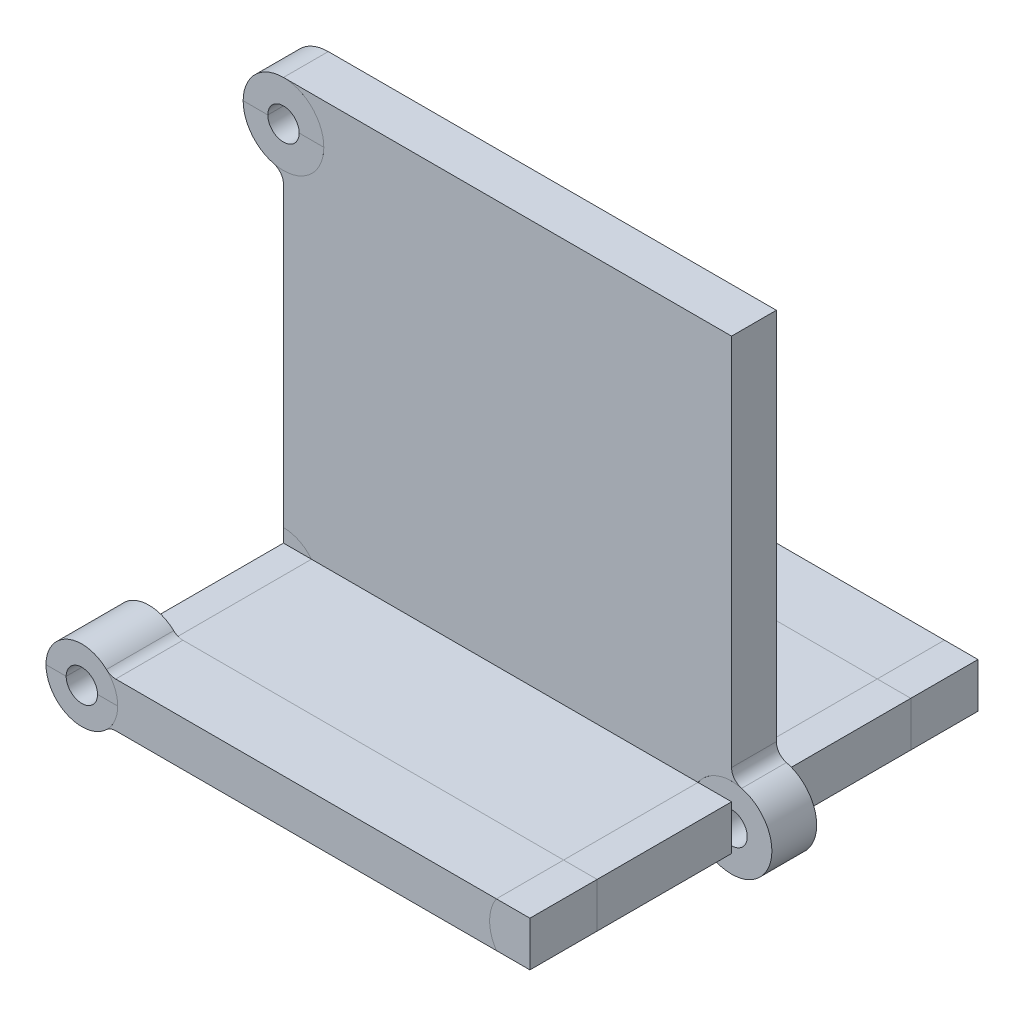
ISO-10303-21;
HEADER;
FILE_DESCRIPTION(('STEP AP214'),'2;1');
FILE_NAME('part.step','',(''),(''),'','','');
FILE_SCHEMA(('AUTOMOTIVE_DESIGN { 1 0 10303 214 1 1 1 1 }'));
ENDSEC;
DATA;
#1=APPLICATION_CONTEXT('core data for automotive mechanical design processes');
#2=APPLICATION_PROTOCOL_DEFINITION('international standard','automotive_design',2000,#1);
#3=PRODUCT_CONTEXT('',#1,'mechanical');
#4=PRODUCT('Part','Part','',(#3));
#5=PRODUCT_RELATED_PRODUCT_CATEGORY('part','',(#4));
#6=PRODUCT_DEFINITION_FORMATION('','',#4);
#7=PRODUCT_DEFINITION_CONTEXT('part definition',#1,'design');
#8=PRODUCT_DEFINITION('design','',#6,#7);
#9=PRODUCT_DEFINITION_SHAPE('','',#8);
#10=(LENGTH_UNIT() NAMED_UNIT(*) SI_UNIT(.MILLI.,.METRE.));
#11=(NAMED_UNIT(*) PLANE_ANGLE_UNIT() SI_UNIT($,.RADIAN.));
#12=(NAMED_UNIT(*) SI_UNIT($,.STERADIAN.) SOLID_ANGLE_UNIT());
#13=UNCERTAINTY_MEASURE_WITH_UNIT(LENGTH_MEASURE(1.E-05),#10,'distance_accuracy_value','');
#14=(GEOMETRIC_REPRESENTATION_CONTEXT(3) GLOBAL_UNCERTAINTY_ASSIGNED_CONTEXT((#13)) GLOBAL_UNIT_ASSIGNED_CONTEXT((#10,
#11,#12)) REPRESENTATION_CONTEXT('',''));
#15=CARTESIAN_POINT('',(0.,0.,0.));
#16=DIRECTION('',(0.,0.,1.));
#17=DIRECTION('',(1.,0.,0.));
#18=AXIS2_PLACEMENT_3D('',#15,#16,#17);
#19=CARTESIAN_POINT('',(-18.3239444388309,-4.00999999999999,35.));
#20=DIRECTION('',(0.,0.,1.));
#21=DIRECTION('',(1.,0.,0.));
#22=AXIS2_PLACEMENT_3D('',#19,#20,#21);
#23=PLANE('',#22);
#24=CARTESIAN_POINT('',(100.,5.,35.));
#25=DIRECTION('',(0.,0.,1.));
#26=DIRECTION('',(1.,0.,0.));
#27=AXIS2_PLACEMENT_3D('',#24,#25,#26);
#28=CIRCLE('',#27,9.);
#29=CARTESIAN_POINT('',(92.5166852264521,0.,35.));
#30=VERTEX_POINT('',#29);
#31=CARTESIAN_POINT('',(92.5166852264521,10.,35.));
#32=VERTEX_POINT('',#31);
#33=EDGE_CURVE('E56',#30,#32,#28,.F.);
#34=ORIENTED_EDGE('',*,*,#33,.T.);
#35=DIRECTION('',(-1.,0.,0.));
#36=VECTOR('',#35,1.);
#37=CARTESIAN_POINT('',(0.,10.,35.));
#38=LINE('',#37,#36);
#39=CARTESIAN_POINT('',(100.,10.,35.));
#40=VERTEX_POINT('',#39);
#41=EDGE_CURVE('E119',#40,#32,#38,.T.);
#42=ORIENTED_EDGE('',*,*,#41,.F.);
#43=DIRECTION('',(0.,1.,0.));
#44=VECTOR('',#43,1.);
#45=CARTESIAN_POINT('',(100.,0.,35.));
#46=LINE('',#45,#44);
#47=CARTESIAN_POINT('',(100.,0.,35.));
#48=VERTEX_POINT('',#47);
#49=EDGE_CURVE('E100',#48,#40,#46,.T.);
#50=ORIENTED_EDGE('',*,*,#49,.F.);
#51=DIRECTION('',(1.,0.,0.));
#52=VECTOR('',#51,1.);
#53=CARTESIAN_POINT('',(0.,0.,35.));
#54=LINE('',#53,#52);
#55=EDGE_CURVE('E97',#30,#48,#54,.T.);
#56=ORIENTED_EDGE('',*,*,#55,.F.);
#57=EDGE_LOOP('',(#34,#42,#50,#56));
#58=FACE_BOUND('',#57,.T.);
#59=ADVANCED_FACE('F52',(#58),#23,.F.);
#60=CARTESIAN_POINT('',(0.,0.,50.));
#61=DIRECTION('',(0.,1.,0.));
#62=DIRECTION('',(0.,0.,1.));
#63=AXIS2_PLACEMENT_3D('',#60,#61,#62);
#64=PLANE('',#63);
#65=DIRECTION('',(0.,0.,1.));
#66=VECTOR('',#65,1.);
#67=CARTESIAN_POINT('',(92.5166852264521,0.,-50.01));
#68=LINE('',#67,#66);
#69=CARTESIAN_POINT('',(92.5166852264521,0.,50.));
#70=VERTEX_POINT('',#69);
#71=EDGE_CURVE('E68',#30,#70,#68,.T.);
#72=ORIENTED_EDGE('',*,*,#71,.F.);
#73=ORIENTED_EDGE('',*,*,#55,.T.);
#74=DIRECTION('',(0.,0.,-1.));
#75=VECTOR('',#74,1.);
#76=CARTESIAN_POINT('',(100.,0.,50.));
#77=LINE('',#76,#75);
#78=CARTESIAN_POINT('',(100.,0.,50.));
#79=VERTEX_POINT('',#78);
#80=EDGE_CURVE('E108',#79,#48,#77,.T.);
#81=ORIENTED_EDGE('',*,*,#80,.F.);
#82=DIRECTION('',(1.,0.,0.));
#83=VECTOR('',#82,1.);
#84=CARTESIAN_POINT('',(0.,0.,50.));
#85=LINE('',#84,#83);
#86=EDGE_CURVE('E107',#70,#79,#85,.T.);
#87=ORIENTED_EDGE('',*,*,#86,.F.);
#88=EDGE_LOOP('',(#72,#73,#81,#87));
#89=FACE_BOUND('',#88,.T.);
#90=ADVANCED_FACE('F106',(#89),#64,.F.);
#91=CARTESIAN_POINT('',(0.,0.,50.));
#92=DIRECTION('',(0.,0.,-1.));
#93=DIRECTION('',(-1.,0.,0.));
#94=AXIS2_PLACEMENT_3D('',#91,#92,#93);
#95=PLANE('',#94);
#96=CARTESIAN_POINT('',(100.,5.,50.));
#97=DIRECTION('',(0.,0.,-1.));
#98=DIRECTION('',(-1.,0.,0.));
#99=AXIS2_PLACEMENT_3D('',#96,#97,#98);
#100=CIRCLE('',#99,9.);
#101=CARTESIAN_POINT('',(92.5166852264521,10.,50.));
#102=VERTEX_POINT('',#101);
#103=EDGE_CURVE('E12',#70,#102,#100,.T.);
#104=ORIENTED_EDGE('',*,*,#103,.F.);
#105=ORIENTED_EDGE('',*,*,#86,.T.);
#106=DIRECTION('',(0.,1.,0.));
#107=VECTOR('',#106,1.);
#108=CARTESIAN_POINT('',(100.,0.,50.));
#109=LINE('',#108,#107);
#110=CARTESIAN_POINT('',(100.,10.,50.));
#111=VERTEX_POINT('',#110);
#112=EDGE_CURVE('E115',#79,#111,#109,.T.);
#113=ORIENTED_EDGE('',*,*,#112,.T.);
#114=DIRECTION('',(-1.,0.,0.));
#115=VECTOR('',#114,1.);
#116=CARTESIAN_POINT('',(0.,10.,50.));
#117=LINE('',#116,#115);
#118=EDGE_CURVE('E76',#111,#102,#117,.T.);
#119=ORIENTED_EDGE('',*,*,#118,.T.);
#120=EDGE_LOOP('',(#104,#105,#113,#119));
#121=FACE_BOUND('',#120,.T.);
#122=ADVANCED_FACE('F126',(#121),#95,.F.);
#123=CARTESIAN_POINT('',(100.,5.,-50.01));
#124=DIRECTION('',(0.,0.,1.));
#125=DIRECTION('',(1.,0.,0.));
#126=AXIS2_PLACEMENT_3D('',#123,#124,#125);
#127=CYLINDRICAL_SURFACE('',#126,9.);
#128=ORIENTED_EDGE('',*,*,#33,.F.);
#129=ORIENTED_EDGE('',*,*,#71,.T.);
#130=ORIENTED_EDGE('',*,*,#103,.T.);
#131=DIRECTION('',(0.,0.,1.));
#132=VECTOR('',#131,1.);
#133=CARTESIAN_POINT('',(92.5166852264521,10.,-50.01));
#134=LINE('',#133,#132);
#135=EDGE_CURVE('E61',#102,#32,#134,.F.);
#136=ORIENTED_EDGE('',*,*,#135,.T.);
#137=EDGE_LOOP('',(#128,#129,#130,#136));
#138=FACE_BOUND('',#137,.T.);
#139=ADVANCED_FACE('F105',(#138),#127,.T.);
#140=CARTESIAN_POINT('',(100.,0.,50.));
#141=DIRECTION('',(-1.,0.,0.));
#142=DIRECTION('',(0.,0.,1.));
#143=AXIS2_PLACEMENT_3D('',#140,#141,#142);
#144=PLANE('',#143);
#145=ORIENTED_EDGE('',*,*,#80,.T.);
#146=ORIENTED_EDGE('',*,*,#49,.T.);
#147=DIRECTION('',(0.,0.,-1.));
#148=VECTOR('',#147,1.);
#149=CARTESIAN_POINT('',(100.,10.,50.));
#150=LINE('',#149,#148);
#151=EDGE_CURVE('E110',#111,#40,#150,.T.);
#152=ORIENTED_EDGE('',*,*,#151,.F.);
#153=ORIENTED_EDGE('',*,*,#112,.F.);
#154=EDGE_LOOP('',(#145,#146,#152,#153));
#155=FACE_BOUND('',#154,.T.);
#156=ADVANCED_FACE('F54',(#155),#144,.F.);
#157=CARTESIAN_POINT('',(0.,10.,50.));
#158=DIRECTION('',(0.,-1.,0.));
#159=DIRECTION('',(0.,0.,-1.));
#160=AXIS2_PLACEMENT_3D('',#157,#158,#159);
#161=PLANE('',#160);
#162=ORIENTED_EDGE('',*,*,#151,.T.);
#163=ORIENTED_EDGE('',*,*,#41,.T.);
#164=ORIENTED_EDGE('',*,*,#135,.F.);
#165=ORIENTED_EDGE('',*,*,#118,.F.);
#166=EDGE_LOOP('',(#162,#163,#164,#165));
#167=FACE_BOUND('',#166,.T.);
#168=ADVANCED_FACE('F125',(#167),#161,.F.);
#169=CLOSED_SHELL('',(#59,#90,#122,#139,#156,#168));
#170=MANIFOLD_SOLID_BREP('B2',#169);
#171=CARTESIAN_POINT('',(-8.,5.,-50.01));
#172=DIRECTION('',(0.,1.,0.));
#173=DIRECTION('',(0.,0.,1.));
#174=AXIS2_PLACEMENT_3D('',#171,#172,#173);
#175=PLANE('',#174);
#176=DIRECTION('',(-1.,0.,0.));
#177=VECTOR('',#176,1.);
#178=CARTESIAN_POINT('',(-18.3239444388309,5.,35.));
#179=LINE('',#178,#177);
#180=CARTESIAN_POINT('',(8.,5.,35.));
#181=VERTEX_POINT('',#180);
#182=CARTESIAN_POINT('',(3.5,5.,35.));
#183=VERTEX_POINT('',#182);
#184=EDGE_CURVE('E258',#181,#183,#179,.T.);
#185=ORIENTED_EDGE('',*,*,#184,.F.);
#186=DIRECTION('',(0.,0.,1.));
#187=VECTOR('',#186,1.);
#188=CARTESIAN_POINT('',(8.,5.,-50.01));
#189=LINE('',#188,#187);
#190=CARTESIAN_POINT('',(8.,5.,5.));
#191=VERTEX_POINT('',#190);
#192=EDGE_CURVE('E280',#191,#181,#189,.T.);
#193=ORIENTED_EDGE('',*,*,#192,.F.);
#194=DIRECTION('',(1.,0.,0.));
#195=VECTOR('',#194,1.);
#196=CARTESIAN_POINT('',(-18.3239444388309,5.,5.));
#197=LINE('',#196,#195);
#198=CARTESIAN_POINT('',(3.5,5.,5.));
#199=VERTEX_POINT('',#198);
#200=EDGE_CURVE('E263',#199,#191,#197,.T.);
#201=ORIENTED_EDGE('',*,*,#200,.F.);
#202=DIRECTION('',(0.,0.,1.));
#203=VECTOR('',#202,1.);
#204=CARTESIAN_POINT('',(3.5,5.,-50.));
#205=LINE('',#204,#203);
#206=EDGE_CURVE('E248',#199,#183,#205,.T.);
#207=ORIENTED_EDGE('',*,*,#206,.T.);
#208=EDGE_LOOP('',(#185,#193,#201,#207));
#209=FACE_BOUND('',#208,.T.);
#210=ADVANCED_FACE('F195',(#209),#175,.T.);
#211=CARTESIAN_POINT('',(-18.3239444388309,-4.00999999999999,35.));
#212=DIRECTION('',(0.,0.,1.));
#213=DIRECTION('',(1.,0.,0.));
#214=AXIS2_PLACEMENT_3D('',#211,#212,#213);
#215=PLANE('',#214);
#216=CARTESIAN_POINT('',(0.,5.,35.));
#217=DIRECTION('',(0.,0.,1.));
#218=DIRECTION('',(1.,0.,0.));
#219=AXIS2_PLACEMENT_3D('',#216,#217,#218);
#220=CIRCLE('',#219,8.);
#221=CARTESIAN_POINT('',(6.2449979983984,0.,35.));
#222=VERTEX_POINT('',#221);
#223=EDGE_CURVE('E261',#181,#222,#220,.F.);
#224=ORIENTED_EDGE('',*,*,#223,.F.);
#225=ORIENTED_EDGE('',*,*,#184,.T.);
#226=CARTESIAN_POINT('',(0.,5.,35.));
#227=DIRECTION('',(0.,0.,1.));
#228=DIRECTION('',(1.,0.,0.));
#229=AXIS2_PLACEMENT_3D('',#226,#227,#228);
#230=CIRCLE('',#229,3.5);
#231=CARTESIAN_POINT('',(0.,1.5,35.));
#232=VERTEX_POINT('',#231);
#233=EDGE_CURVE('E243',#183,#232,#230,.F.);
#234=ORIENTED_EDGE('',*,*,#233,.T.);
#235=DIRECTION('',(0.,-1.,0.));
#236=VECTOR('',#235,1.);
#237=CARTESIAN_POINT('',(0.,0.,35.));
#238=LINE('',#237,#236);
#239=CARTESIAN_POINT('',(0.,0.,35.));
#240=VERTEX_POINT('',#239);
#241=EDGE_CURVE('E270',#232,#240,#238,.T.);
#242=ORIENTED_EDGE('',*,*,#241,.T.);
#243=DIRECTION('',(1.,0.,0.));
#244=VECTOR('',#243,1.);
#245=CARTESIAN_POINT('',(0.,0.,35.));
#246=LINE('',#245,#244);
#247=EDGE_CURVE('E272',#240,#222,#246,.T.);
#248=ORIENTED_EDGE('',*,*,#247,.T.);
#249=EDGE_LOOP('',(#224,#225,#234,#242,#248));
#250=FACE_BOUND('',#249,.T.);
#251=ADVANCED_FACE('F259',(#250),#215,.T.);
#252=CARTESIAN_POINT('',(0.,0.,50.));
#253=DIRECTION('',(1.,0.,0.));
#254=DIRECTION('',(0.,0.,-1.));
#255=AXIS2_PLACEMENT_3D('',#252,#253,#254);
#256=PLANE('',#255);
#257=DIRECTION('',(0.,1.,0.));
#258=VECTOR('',#257,1.);
#259=CARTESIAN_POINT('',(0.,0.,5.));
#260=LINE('',#259,#258);
#261=CARTESIAN_POINT('',(0.,0.,5.));
#262=VERTEX_POINT('',#261);
#263=CARTESIAN_POINT('',(0.,1.5,5.));
#264=VERTEX_POINT('',#263);
#265=EDGE_CURVE('E253',#262,#264,#260,.T.);
#266=ORIENTED_EDGE('',*,*,#265,.F.);
#267=DIRECTION('',(0.,0.,-1.));
#268=VECTOR('',#267,1.);
#269=CARTESIAN_POINT('',(0.,0.,50.));
#270=LINE('',#269,#268);
#271=EDGE_CURVE('E204',#240,#262,#270,.T.);
#272=ORIENTED_EDGE('',*,*,#271,.F.);
#273=ORIENTED_EDGE('',*,*,#241,.F.);
#274=DIRECTION('',(0.,0.,1.));
#275=VECTOR('',#274,1.);
#276=CARTESIAN_POINT('',(0.,1.5,-50.));
#277=LINE('',#276,#275);
#278=EDGE_CURVE('E249',#232,#264,#277,.F.);
#279=ORIENTED_EDGE('',*,*,#278,.T.);
#280=EDGE_LOOP('',(#266,#272,#273,#279));
#281=FACE_BOUND('',#280,.T.);
#282=ADVANCED_FACE('F294',(#281),#256,.F.);
#283=CARTESIAN_POINT('',(-18.3239444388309,-4.00999999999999,5.));
#284=DIRECTION('',(0.,0.,-1.));
#285=DIRECTION('',(-1.,0.,0.));
#286=AXIS2_PLACEMENT_3D('',#283,#284,#285);
#287=PLANE('',#286);
#288=CARTESIAN_POINT('',(0.,5.,5.));
#289=DIRECTION('',(0.,0.,-1.));
#290=DIRECTION('',(-1.,0.,0.));
#291=AXIS2_PLACEMENT_3D('',#288,#289,#290);
#292=CIRCLE('',#291,3.5);
#293=EDGE_CURVE('E254',#264,#199,#292,.F.);
#294=ORIENTED_EDGE('',*,*,#293,.T.);
#295=ORIENTED_EDGE('',*,*,#200,.T.);
#296=CARTESIAN_POINT('',(0.,5.,5.));
#297=DIRECTION('',(0.,0.,-1.));
#298=DIRECTION('',(-1.,0.,0.));
#299=AXIS2_PLACEMENT_3D('',#296,#297,#298);
#300=CIRCLE('',#299,8.);
#301=CARTESIAN_POINT('',(6.2449979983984,0.,5.));
#302=VERTEX_POINT('',#301);
#303=EDGE_CURVE('E199',#302,#191,#300,.F.);
#304=ORIENTED_EDGE('',*,*,#303,.F.);
#305=DIRECTION('',(-1.,0.,0.));
#306=VECTOR('',#305,1.);
#307=CARTESIAN_POINT('',(0.,0.,5.));
#308=LINE('',#307,#306);
#309=EDGE_CURVE('E273',#302,#262,#308,.T.);
#310=ORIENTED_EDGE('',*,*,#309,.T.);
#311=ORIENTED_EDGE('',*,*,#265,.T.);
#312=EDGE_LOOP('',(#294,#295,#304,#310,#311));
#313=FACE_BOUND('',#312,.T.);
#314=ADVANCED_FACE('F284',(#313),#287,.T.);
#315=CARTESIAN_POINT('',(0.,5.,-50.));
#316=DIRECTION('',(0.,0.,1.));
#317=DIRECTION('',(1.,0.,0.));
#318=AXIS2_PLACEMENT_3D('',#315,#316,#317);
#319=CYLINDRICAL_SURFACE('',#318,3.5);
#320=ORIENTED_EDGE('',*,*,#206,.F.);
#321=ORIENTED_EDGE('',*,*,#293,.F.);
#322=ORIENTED_EDGE('',*,*,#278,.F.);
#323=ORIENTED_EDGE('',*,*,#233,.F.);
#324=EDGE_LOOP('',(#320,#321,#322,#323));
#325=FACE_BOUND('',#324,.T.);
#326=ADVANCED_FACE('F245',(#325),#319,.F.);
#327=CARTESIAN_POINT('',(0.,0.,50.));
#328=DIRECTION('',(0.,1.,0.));
#329=DIRECTION('',(0.,0.,1.));
#330=AXIS2_PLACEMENT_3D('',#327,#328,#329);
#331=PLANE('',#330);
#332=ORIENTED_EDGE('',*,*,#309,.F.);
#333=DIRECTION('',(0.,0.,1.));
#334=VECTOR('',#333,1.);
#335=CARTESIAN_POINT('',(6.2449979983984,0.,-50.01));
#336=LINE('',#335,#334);
#337=EDGE_CURVE('E50',#222,#302,#336,.F.);
#338=ORIENTED_EDGE('',*,*,#337,.F.);
#339=ORIENTED_EDGE('',*,*,#247,.F.);
#340=ORIENTED_EDGE('',*,*,#271,.T.);
#341=EDGE_LOOP('',(#332,#338,#339,#340));
#342=FACE_BOUND('',#341,.T.);
#343=ADVANCED_FACE('F286',(#342),#331,.F.);
#344=CARTESIAN_POINT('',(0.,5.,-50.01));
#345=DIRECTION('',(0.,0.,1.));
#346=DIRECTION('',(1.,0.,0.));
#347=AXIS2_PLACEMENT_3D('',#344,#345,#346);
#348=CYLINDRICAL_SURFACE('',#347,8.);
#349=ORIENTED_EDGE('',*,*,#303,.T.);
#350=ORIENTED_EDGE('',*,*,#192,.T.);
#351=ORIENTED_EDGE('',*,*,#223,.T.);
#352=ORIENTED_EDGE('',*,*,#337,.T.);
#353=EDGE_LOOP('',(#349,#350,#351,#352));
#354=FACE_BOUND('',#353,.T.);
#355=ADVANCED_FACE('F197',(#354),#348,.T.);
#356=CLOSED_SHELL('',(#210,#251,#282,#314,#326,#343,#355));
#357=MANIFOLD_SOLID_BREP('B6',#356);
#358=CARTESIAN_POINT('',(-8.,5.,-50.01));
#359=DIRECTION('',(0.,1.,0.));
#360=DIRECTION('',(0.,0.,1.));
#361=AXIS2_PLACEMENT_3D('',#358,#359,#360);
#362=PLANE('',#361);
#363=DIRECTION('',(-1.,0.,0.));
#364=VECTOR('',#363,1.);
#365=CARTESIAN_POINT('',(-18.3239444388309,5.,35.));
#366=LINE('',#365,#364);
#367=CARTESIAN_POINT('',(8.,5.,35.));
#368=VERTEX_POINT('',#367);
#369=CARTESIAN_POINT('',(3.5,5.,35.));
#370=VERTEX_POINT('',#369);
#371=EDGE_CURVE('E367',#368,#370,#366,.T.);
#372=ORIENTED_EDGE('',*,*,#371,.T.);
#373=DIRECTION('',(0.,0.,1.));
#374=VECTOR('',#373,1.);
#375=CARTESIAN_POINT('',(3.5,5.,-50.));
#376=LINE('',#375,#374);
#377=CARTESIAN_POINT('',(3.5,5.,5.));
#378=VERTEX_POINT('',#377);
#379=EDGE_CURVE('E439',#378,#370,#376,.T.);
#380=ORIENTED_EDGE('',*,*,#379,.F.);
#381=DIRECTION('',(1.,0.,0.));
#382=VECTOR('',#381,1.);
#383=CARTESIAN_POINT('',(-18.3239444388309,5.,5.));
#384=LINE('',#383,#382);
#385=CARTESIAN_POINT('',(8.,5.,5.));
#386=VERTEX_POINT('',#385);
#387=EDGE_CURVE('E372',#378,#386,#384,.T.);
#388=ORIENTED_EDGE('',*,*,#387,.T.);
#389=DIRECTION('',(0.,0.,1.));
#390=VECTOR('',#389,1.);
#391=CARTESIAN_POINT('',(8.,5.,-50.01));
#392=LINE('',#391,#390);
#393=EDGE_CURVE('E193',#386,#368,#392,.T.);
#394=ORIENTED_EDGE('',*,*,#393,.T.);
#395=EDGE_LOOP('',(#372,#380,#388,#394));
#396=FACE_BOUND('',#395,.T.);
#397=ADVANCED_FACE('F364',(#396),#362,.F.);
#398=CARTESIAN_POINT('',(0.,10.,50.));
#399=DIRECTION('',(0.,-1.,0.));
#400=DIRECTION('',(0.,0.,-1.));
#401=AXIS2_PLACEMENT_3D('',#398,#399,#400);
#402=PLANE('',#401);
#403=DIRECTION('',(0.,0.,1.));
#404=VECTOR('',#403,1.);
#405=CARTESIAN_POINT('',(6.2449979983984,10.,-50.01));
#406=LINE('',#405,#404);
#407=CARTESIAN_POINT('',(6.2449979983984,10.,5.));
#408=VERTEX_POINT('',#407);
#409=CARTESIAN_POINT('',(6.2449979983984,10.,35.));
#410=VERTEX_POINT('',#409);
#411=EDGE_CURVE('E451',#408,#410,#406,.T.);
#412=ORIENTED_EDGE('',*,*,#411,.F.);
#413=DIRECTION('',(1.,0.,0.));
#414=VECTOR('',#413,1.);
#415=CARTESIAN_POINT('',(0.,10.,5.));
#416=LINE('',#415,#414);
#417=CARTESIAN_POINT('',(0.,10.,5.));
#418=VERTEX_POINT('',#417);
#419=EDGE_CURVE('E440',#418,#408,#416,.T.);
#420=ORIENTED_EDGE('',*,*,#419,.F.);
#421=DIRECTION('',(0.,0.,-1.));
#422=VECTOR('',#421,1.);
#423=CARTESIAN_POINT('',(0.,10.,50.));
#424=LINE('',#423,#422);
#425=CARTESIAN_POINT('',(0.,10.,35.));
#426=VERTEX_POINT('',#425);
#427=EDGE_CURVE('E430',#426,#418,#424,.T.);
#428=ORIENTED_EDGE('',*,*,#427,.F.);
#429=DIRECTION('',(-1.,0.,0.));
#430=VECTOR('',#429,1.);
#431=CARTESIAN_POINT('',(0.,10.,35.));
#432=LINE('',#431,#430);
#433=EDGE_CURVE('E446',#410,#426,#432,.T.);
#434=ORIENTED_EDGE('',*,*,#433,.F.);
#435=EDGE_LOOP('',(#412,#420,#428,#434));
#436=FACE_BOUND('',#435,.T.);
#437=ADVANCED_FACE('F455',(#436),#402,.F.);
#438=CARTESIAN_POINT('',(0.,0.,50.));
#439=DIRECTION('',(1.,0.,0.));
#440=DIRECTION('',(0.,0.,-1.));
#441=AXIS2_PLACEMENT_3D('',#438,#439,#440);
#442=PLANE('',#441);
#443=DIRECTION('',(0.,1.,0.));
#444=VECTOR('',#443,1.);
#445=CARTESIAN_POINT('',(0.,0.,5.));
#446=LINE('',#445,#444);
#447=CARTESIAN_POINT('',(0.,8.5,5.));
#448=VERTEX_POINT('',#447);
#449=EDGE_CURVE('E414',#448,#418,#446,.T.);
#450=ORIENTED_EDGE('',*,*,#449,.F.);
#451=DIRECTION('',(0.,0.,1.));
#452=VECTOR('',#451,1.);
#453=CARTESIAN_POINT('',(0.,8.5,-50.));
#454=LINE('',#453,#452);
#455=CARTESIAN_POINT('',(0.,8.5,35.));
#456=VERTEX_POINT('',#455);
#457=EDGE_CURVE('E423',#448,#456,#454,.T.);
#458=ORIENTED_EDGE('',*,*,#457,.T.);
#459=DIRECTION('',(0.,-1.,0.));
#460=VECTOR('',#459,1.);
#461=CARTESIAN_POINT('',(0.,0.,35.));
#462=LINE('',#461,#460);
#463=EDGE_CURVE('E419',#426,#456,#462,.T.);
#464=ORIENTED_EDGE('',*,*,#463,.F.);
#465=ORIENTED_EDGE('',*,*,#427,.T.);
#466=EDGE_LOOP('',(#450,#458,#464,#465));
#467=FACE_BOUND('',#466,.T.);
#468=ADVANCED_FACE('F432',(#467),#442,.F.);
#469=CARTESIAN_POINT('',(-18.3239444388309,-4.00999999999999,35.));
#470=DIRECTION('',(0.,0.,1.));
#471=DIRECTION('',(1.,0.,0.));
#472=AXIS2_PLACEMENT_3D('',#469,#470,#471);
#473=PLANE('',#472);
#474=ORIENTED_EDGE('',*,*,#371,.F.);
#475=CARTESIAN_POINT('',(0.,5.,35.));
#476=DIRECTION('',(0.,0.,1.));
#477=DIRECTION('',(1.,0.,0.));
#478=AXIS2_PLACEMENT_3D('',#475,#476,#477);
#479=CIRCLE('',#478,8.);
#480=EDGE_CURVE('E433',#410,#368,#479,.F.);
#481=ORIENTED_EDGE('',*,*,#480,.F.);
#482=ORIENTED_EDGE('',*,*,#433,.T.);
#483=ORIENTED_EDGE('',*,*,#463,.T.);
#484=CARTESIAN_POINT('',(0.,5.,35.));
#485=DIRECTION('',(0.,0.,1.));
#486=DIRECTION('',(1.,0.,0.));
#487=AXIS2_PLACEMENT_3D('',#484,#485,#486);
#488=CIRCLE('',#487,3.5);
#489=EDGE_CURVE('E420',#456,#370,#488,.F.);
#490=ORIENTED_EDGE('',*,*,#489,.T.);
#491=EDGE_LOOP('',(#474,#481,#482,#483,#490));
#492=FACE_BOUND('',#491,.T.);
#493=ADVANCED_FACE('F443',(#492),#473,.T.);
#494=CARTESIAN_POINT('',(-18.3239444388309,-4.00999999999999,5.));
#495=DIRECTION('',(0.,0.,-1.));
#496=DIRECTION('',(-1.,0.,0.));
#497=AXIS2_PLACEMENT_3D('',#494,#495,#496);
#498=PLANE('',#497);
#499=ORIENTED_EDGE('',*,*,#387,.F.);
#500=CARTESIAN_POINT('',(0.,5.,5.));
#501=DIRECTION('',(0.,0.,-1.));
#502=DIRECTION('',(-1.,0.,0.));
#503=AXIS2_PLACEMENT_3D('',#500,#501,#502);
#504=CIRCLE('',#503,3.5);
#505=EDGE_CURVE('E409',#378,#448,#504,.F.);
#506=ORIENTED_EDGE('',*,*,#505,.T.);
#507=ORIENTED_EDGE('',*,*,#449,.T.);
#508=ORIENTED_EDGE('',*,*,#419,.T.);
#509=CARTESIAN_POINT('',(0.,5.,5.));
#510=DIRECTION('',(0.,0.,-1.));
#511=DIRECTION('',(-1.,0.,0.));
#512=AXIS2_PLACEMENT_3D('',#509,#510,#511);
#513=CIRCLE('',#512,8.);
#514=EDGE_CURVE('E429',#386,#408,#513,.F.);
#515=ORIENTED_EDGE('',*,*,#514,.F.);
#516=EDGE_LOOP('',(#499,#506,#507,#508,#515));
#517=FACE_BOUND('',#516,.T.);
#518=ADVANCED_FACE('F411',(#517),#498,.T.);
#519=CARTESIAN_POINT('',(0.,5.,-50.));
#520=DIRECTION('',(0.,0.,1.));
#521=DIRECTION('',(1.,0.,0.));
#522=AXIS2_PLACEMENT_3D('',#519,#520,#521);
#523=CYLINDRICAL_SURFACE('',#522,3.5);
#524=ORIENTED_EDGE('',*,*,#505,.F.);
#525=ORIENTED_EDGE('',*,*,#379,.T.);
#526=ORIENTED_EDGE('',*,*,#489,.F.);
#527=ORIENTED_EDGE('',*,*,#457,.F.);
#528=EDGE_LOOP('',(#524,#525,#526,#527));
#529=FACE_BOUND('',#528,.T.);
#530=ADVANCED_FACE('F424',(#529),#523,.F.);
#531=CARTESIAN_POINT('',(0.,5.,-50.01));
#532=DIRECTION('',(0.,0.,1.));
#533=DIRECTION('',(1.,0.,0.));
#534=AXIS2_PLACEMENT_3D('',#531,#532,#533);
#535=CYLINDRICAL_SURFACE('',#534,8.);
#536=ORIENTED_EDGE('',*,*,#393,.F.);
#537=ORIENTED_EDGE('',*,*,#514,.T.);
#538=ORIENTED_EDGE('',*,*,#411,.T.);
#539=ORIENTED_EDGE('',*,*,#480,.T.);
#540=EDGE_LOOP('',(#536,#537,#538,#539));
#541=FACE_BOUND('',#540,.T.);
#542=ADVANCED_FACE('F456',(#541),#535,.T.);
#543=CLOSED_SHELL('',(#397,#437,#468,#493,#518,#530,#542));
#544=MANIFOLD_SOLID_BREP('B44',#543);
#545=CARTESIAN_POINT('',(100.,5.,-50.01));
#546=DIRECTION('',(0.,0.,1.));
#547=DIRECTION('',(1.,0.,0.));
#548=AXIS2_PLACEMENT_3D('',#545,#546,#547);
#549=CYLINDRICAL_SURFACE('',#548,9.);
#550=CARTESIAN_POINT('',(100.,5.,-5.));
#551=DIRECTION('',(0.,0.,1.));
#552=DIRECTION('',(1.,0.,0.));
#553=AXIS2_PLACEMENT_3D('',#550,#551,#552);
#554=CIRCLE('',#553,9.);
#555=CARTESIAN_POINT('',(92.5166852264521,0.,-5.));
#556=VERTEX_POINT('',#555);
#557=CARTESIAN_POINT('',(92.5166852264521,10.,-5.));
#558=VERTEX_POINT('',#557);
#559=EDGE_CURVE('E578',#556,#558,#554,.F.);
#560=ORIENTED_EDGE('',*,*,#559,.F.);
#561=DIRECTION('',(0.,0.,1.));
#562=VECTOR('',#561,1.);
#563=CARTESIAN_POINT('',(92.5166852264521,0.,-50.01));
#564=LINE('',#563,#562);
#565=CARTESIAN_POINT('',(92.5166852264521,0.,-35.));
#566=VERTEX_POINT('',#565);
#567=EDGE_CURVE('E596',#566,#556,#564,.T.);
#568=ORIENTED_EDGE('',*,*,#567,.F.);
#569=CARTESIAN_POINT('',(100.,5.,-35.));
#570=DIRECTION('',(0.,0.,-1.));
#571=DIRECTION('',(-1.,0.,0.));
#572=AXIS2_PLACEMENT_3D('',#569,#570,#571);
#573=CIRCLE('',#572,9.);
#574=CARTESIAN_POINT('',(92.5166852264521,10.,-35.));
#575=VERTEX_POINT('',#574);
#576=EDGE_CURVE('E601',#575,#566,#573,.F.);
#577=ORIENTED_EDGE('',*,*,#576,.F.);
#578=DIRECTION('',(0.,0.,1.));
#579=VECTOR('',#578,1.);
#580=CARTESIAN_POINT('',(92.5166852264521,10.,-50.01));
#581=LINE('',#580,#579);
#582=EDGE_CURVE('E593',#558,#575,#581,.F.);
#583=ORIENTED_EDGE('',*,*,#582,.F.);
#584=EDGE_LOOP('',(#560,#568,#577,#583));
#585=FACE_BOUND('',#584,.T.);
#586=ADVANCED_FACE('F533',(#585),#549,.F.);
#587=CARTESIAN_POINT('',(0.,10.,50.));
#588=DIRECTION('',(0.,-1.,0.));
#589=DIRECTION('',(0.,0.,-1.));
#590=AXIS2_PLACEMENT_3D('',#587,#588,#589);
#591=PLANE('',#590);
#592=DIRECTION('',(1.,0.,0.));
#593=VECTOR('',#592,1.);
#594=CARTESIAN_POINT('',(0.,10.,-35.));
#595=LINE('',#594,#593);
#596=CARTESIAN_POINT('',(6.2449979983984,10.,-35.));
#597=VERTEX_POINT('',#596);
#598=EDGE_CURVE('E362',#597,#575,#595,.T.);
#599=ORIENTED_EDGE('',*,*,#598,.F.);
#600=DIRECTION('',(0.,0.,1.));
#601=VECTOR('',#600,1.);
#602=CARTESIAN_POINT('',(6.2449979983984,10.,-50.01));
#603=LINE('',#602,#601);
#604=CARTESIAN_POINT('',(6.2449979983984,10.,-5.));
#605=VERTEX_POINT('',#604);
#606=EDGE_CURVE('E582',#597,#605,#603,.T.);
#607=ORIENTED_EDGE('',*,*,#606,.T.);
#608=DIRECTION('',(1.,0.,0.));
#609=VECTOR('',#608,1.);
#610=CARTESIAN_POINT('',(0.,10.,-5.));
#611=LINE('',#610,#609);
#612=EDGE_CURVE('E573',#605,#558,#611,.T.);
#613=ORIENTED_EDGE('',*,*,#612,.T.);
#614=ORIENTED_EDGE('',*,*,#582,.T.);
#615=EDGE_LOOP('',(#599,#607,#613,#614));
#616=FACE_BOUND('',#615,.T.);
#617=ADVANCED_FACE('F591',(#616),#591,.F.);
#618=CARTESIAN_POINT('',(-20.82232781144,-4.00999999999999,-5.));
#619=DIRECTION('',(0.,0.,1.));
#620=DIRECTION('',(1.,0.,0.));
#621=AXIS2_PLACEMENT_3D('',#618,#619,#620);
#622=PLANE('',#621);
#623=DIRECTION('',(-1.,0.,0.));
#624=VECTOR('',#623,1.);
#625=CARTESIAN_POINT('',(0.,0.,-5.));
#626=LINE('',#625,#624);
#627=CARTESIAN_POINT('',(6.2449979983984,0.,-5.));
#628=VERTEX_POINT('',#627);
#629=EDGE_CURVE('E583',#556,#628,#626,.T.);
#630=ORIENTED_EDGE('',*,*,#629,.F.);
#631=ORIENTED_EDGE('',*,*,#559,.T.);
#632=ORIENTED_EDGE('',*,*,#612,.F.);
#633=CARTESIAN_POINT('',(0.,5.,-5.));
#634=DIRECTION('',(0.,0.,1.));
#635=DIRECTION('',(1.,0.,0.));
#636=AXIS2_PLACEMENT_3D('',#633,#634,#635);
#637=CIRCLE('',#636,8.);
#638=EDGE_CURVE('E575',#605,#628,#637,.F.);
#639=ORIENTED_EDGE('',*,*,#638,.T.);
#640=EDGE_LOOP('',(#630,#631,#632,#639));
#641=FACE_BOUND('',#640,.T.);
#642=ADVANCED_FACE('F535',(#641),#622,.T.);
#643=CARTESIAN_POINT('',(-20.82232781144,-4.00999999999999,-35.));
#644=DIRECTION('',(0.,0.,-1.));
#645=DIRECTION('',(-1.,0.,0.));
#646=AXIS2_PLACEMENT_3D('',#643,#644,#645);
#647=PLANE('',#646);
#648=DIRECTION('',(-1.,0.,0.));
#649=VECTOR('',#648,1.);
#650=CARTESIAN_POINT('',(0.,0.,-35.));
#651=LINE('',#650,#649);
#652=CARTESIAN_POINT('',(6.2449979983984,0.,-35.));
#653=VERTEX_POINT('',#652);
#654=EDGE_CURVE('E537',#566,#653,#651,.T.);
#655=ORIENTED_EDGE('',*,*,#654,.T.);
#656=CARTESIAN_POINT('',(0.,5.,-35.));
#657=DIRECTION('',(0.,0.,-1.));
#658=DIRECTION('',(-1.,0.,0.));
#659=AXIS2_PLACEMENT_3D('',#656,#657,#658);
#660=CIRCLE('',#659,8.);
#661=EDGE_CURVE('E542',#653,#597,#660,.F.);
#662=ORIENTED_EDGE('',*,*,#661,.T.);
#663=ORIENTED_EDGE('',*,*,#598,.T.);
#664=ORIENTED_EDGE('',*,*,#576,.T.);
#665=EDGE_LOOP('',(#655,#662,#663,#664));
#666=FACE_BOUND('',#665,.T.);
#667=ADVANCED_FACE('F603',(#666),#647,.T.);
#668=CARTESIAN_POINT('',(0.,5.,-50.01));
#669=DIRECTION('',(0.,0.,1.));
#670=DIRECTION('',(1.,0.,0.));
#671=AXIS2_PLACEMENT_3D('',#668,#669,#670);
#672=CYLINDRICAL_SURFACE('',#671,8.);
#673=ORIENTED_EDGE('',*,*,#606,.F.);
#674=ORIENTED_EDGE('',*,*,#661,.F.);
#675=DIRECTION('',(0.,0.,1.));
#676=VECTOR('',#675,1.);
#677=CARTESIAN_POINT('',(6.2449979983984,0.,-50.01));
#678=LINE('',#677,#676);
#679=EDGE_CURVE('E589',#628,#653,#678,.F.);
#680=ORIENTED_EDGE('',*,*,#679,.F.);
#681=ORIENTED_EDGE('',*,*,#638,.F.);
#682=EDGE_LOOP('',(#673,#674,#680,#681));
#683=FACE_BOUND('',#682,.T.);
#684=ADVANCED_FACE('F588',(#683),#672,.F.);
#685=CARTESIAN_POINT('',(0.,0.,50.));
#686=DIRECTION('',(0.,1.,0.));
#687=DIRECTION('',(0.,0.,1.));
#688=AXIS2_PLACEMENT_3D('',#685,#686,#687);
#689=PLANE('',#688);
#690=ORIENTED_EDGE('',*,*,#629,.T.);
#691=ORIENTED_EDGE('',*,*,#679,.T.);
#692=ORIENTED_EDGE('',*,*,#654,.F.);
#693=ORIENTED_EDGE('',*,*,#567,.T.);
#694=EDGE_LOOP('',(#690,#691,#692,#693));
#695=FACE_BOUND('',#694,.T.);
#696=ADVANCED_FACE('F606',(#695),#689,.F.);
#697=CLOSED_SHELL('',(#586,#617,#642,#667,#684,#696));
#698=MANIFOLD_SOLID_BREP('B187',#697);
#699=CARTESIAN_POINT('',(0.,10.,50.));
#700=DIRECTION('',(0.,-1.,0.));
#701=DIRECTION('',(0.,0.,-1.));
#702=AXIS2_PLACEMENT_3D('',#699,#700,#701);
#703=PLANE('',#702);
#704=DIRECTION('',(0.,0.,1.));
#705=VECTOR('',#704,1.);
#706=CARTESIAN_POINT('',(7.54983443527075,10.,-35.));
#707=LINE('',#706,#705);
#708=CARTESIAN_POINT('',(7.54983443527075,10.,-50.));
#709=VERTEX_POINT('',#708);
#710=CARTESIAN_POINT('',(7.54983443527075,10.,-35.));
#711=VERTEX_POINT('',#710);
#712=EDGE_CURVE('E758',#709,#711,#707,.T.);
#713=ORIENTED_EDGE('',*,*,#712,.T.);
#714=DIRECTION('',(1.,0.,0.));
#715=VECTOR('',#714,1.);
#716=CARTESIAN_POINT('',(0.,10.,-35.));
#717=LINE('',#716,#715);
#718=CARTESIAN_POINT('',(92.5166852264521,10.,-35.));
#719=VERTEX_POINT('',#718);
#720=EDGE_CURVE('E691',#711,#719,#717,.T.);
#721=ORIENTED_EDGE('',*,*,#720,.T.);
#722=DIRECTION('',(0.,0.,1.));
#723=VECTOR('',#722,1.);
#724=CARTESIAN_POINT('',(92.5166852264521,10.,-50.01));
#725=LINE('',#724,#723);
#726=CARTESIAN_POINT('',(92.5166852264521,10.,-50.));
#727=VERTEX_POINT('',#726);
#728=EDGE_CURVE('E727',#719,#727,#725,.F.);
#729=ORIENTED_EDGE('',*,*,#728,.T.);
#730=DIRECTION('',(-1.,0.,0.));
#731=VECTOR('',#730,1.);
#732=CARTESIAN_POINT('',(0.,10.,-50.));
#733=LINE('',#732,#731);
#734=EDGE_CURVE('E676',#727,#709,#733,.T.);
#735=ORIENTED_EDGE('',*,*,#734,.T.);
#736=EDGE_LOOP('',(#713,#721,#729,#735));
#737=FACE_BOUND('',#736,.T.);
#738=ADVANCED_FACE('F667',(#737),#703,.F.);
#739=CARTESIAN_POINT('',(100.,5.,-50.01));
#740=DIRECTION('',(0.,0.,1.));
#741=DIRECTION('',(1.,0.,0.));
#742=AXIS2_PLACEMENT_3D('',#739,#740,#741);
#743=CYLINDRICAL_SURFACE('',#742,9.);
#744=ORIENTED_EDGE('',*,*,#728,.F.);
#745=CARTESIAN_POINT('',(100.,5.,-35.));
#746=DIRECTION('',(0.,0.,-1.));
#747=DIRECTION('',(-1.,0.,0.));
#748=AXIS2_PLACEMENT_3D('',#745,#746,#747);
#749=CIRCLE('',#748,9.);
#750=CARTESIAN_POINT('',(92.5166852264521,0.,-35.));
#751=VERTEX_POINT('',#750);
#752=EDGE_CURVE('E722',#719,#751,#749,.F.);
#753=ORIENTED_EDGE('',*,*,#752,.T.);
#754=DIRECTION('',(0.,0.,1.));
#755=VECTOR('',#754,1.);
#756=CARTESIAN_POINT('',(92.5166852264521,0.,-50.01));
#757=LINE('',#756,#755);
#758=CARTESIAN_POINT('',(92.5166852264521,0.,-50.));
#759=VERTEX_POINT('',#758);
#760=EDGE_CURVE('E671',#759,#751,#757,.T.);
#761=ORIENTED_EDGE('',*,*,#760,.F.);
#762=CARTESIAN_POINT('',(100.,5.,-50.));
#763=DIRECTION('',(0.,0.,-1.));
#764=DIRECTION('',(-1.,0.,0.));
#765=AXIS2_PLACEMENT_3D('',#762,#763,#764);
#766=CIRCLE('',#765,9.);
#767=EDGE_CURVE('E738',#759,#727,#766,.T.);
#768=ORIENTED_EDGE('',*,*,#767,.T.);
#769=EDGE_LOOP('',(#744,#753,#761,#768));
#770=FACE_BOUND('',#769,.T.);
#771=ADVANCED_FACE('F724',(#770),#743,.F.);
#772=CARTESIAN_POINT('',(0.,0.,50.));
#773=DIRECTION('',(0.,1.,0.));
#774=DIRECTION('',(0.,0.,1.));
#775=AXIS2_PLACEMENT_3D('',#772,#773,#774);
#776=PLANE('',#775);
#777=ORIENTED_EDGE('',*,*,#760,.T.);
#778=DIRECTION('',(-1.,0.,0.));
#779=VECTOR('',#778,1.);
#780=CARTESIAN_POINT('',(0.,0.,-35.));
#781=LINE('',#780,#779);
#782=CARTESIAN_POINT('',(7.54983443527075,0.,-35.));
#783=VERTEX_POINT('',#782);
#784=EDGE_CURVE('E728',#751,#783,#781,.T.);
#785=ORIENTED_EDGE('',*,*,#784,.T.);
#786=DIRECTION('',(0.,0.,1.));
#787=VECTOR('',#786,1.);
#788=CARTESIAN_POINT('',(7.54983443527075,0.,-50.));
#789=LINE('',#788,#787);
#790=CARTESIAN_POINT('',(7.54983443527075,0.,-50.));
#791=VERTEX_POINT('',#790);
#792=EDGE_CURVE('E756',#783,#791,#789,.F.);
#793=ORIENTED_EDGE('',*,*,#792,.T.);
#794=DIRECTION('',(1.,0.,0.));
#795=VECTOR('',#794,1.);
#796=CARTESIAN_POINT('',(0.,0.,-50.));
#797=LINE('',#796,#795);
#798=EDGE_CURVE('E531',#791,#759,#797,.T.);
#799=ORIENTED_EDGE('',*,*,#798,.T.);
#800=EDGE_LOOP('',(#777,#785,#793,#799));
#801=FACE_BOUND('',#800,.T.);
#802=ADVANCED_FACE('F669',(#801),#776,.F.);
#803=CARTESIAN_POINT('',(7.54983443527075,13.,-35.));
#804=DIRECTION('',(0.,0.,-1.));
#805=DIRECTION('',(-1.,0.,0.));
#806=AXIS2_PLACEMENT_3D('',#803,#804,#805);
#807=CYLINDRICAL_SURFACE('',#806,3.);
#808=CARTESIAN_POINT('',(7.54983443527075,13.,-35.));
#809=DIRECTION('',(0.,0.,-1.));
#810=DIRECTION('',(-1.,0.,0.));
#811=AXIS2_PLACEMENT_3D('',#808,#809,#810);
#812=CIRCLE('',#811,3.);
#813=CARTESIAN_POINT('',(5.49078868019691,10.8181818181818,-35.));
#814=VERTEX_POINT('',#813);
#815=EDGE_CURVE('E752',#711,#814,#812,.T.);
#816=ORIENTED_EDGE('',*,*,#815,.F.);
#817=ORIENTED_EDGE('',*,*,#712,.F.);
#818=CARTESIAN_POINT('',(7.54983443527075,13.,-50.));
#819=DIRECTION('',(0.,0.,-1.));
#820=DIRECTION('',(-1.,0.,0.));
#821=AXIS2_PLACEMENT_3D('',#818,#819,#820);
#822=CIRCLE('',#821,3.);
#823=CARTESIAN_POINT('',(5.49078868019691,10.8181818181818,-50.));
#824=VERTEX_POINT('',#823);
#825=EDGE_CURVE('E754',#824,#709,#822,.F.);
#826=ORIENTED_EDGE('',*,*,#825,.F.);
#827=DIRECTION('',(0.,0.,-1.));
#828=VECTOR('',#827,1.);
#829=CARTESIAN_POINT('',(5.49078868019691,10.8181818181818,-35.));
#830=LINE('',#829,#828);
#831=EDGE_CURVE('E746',#814,#824,#830,.T.);
#832=ORIENTED_EDGE('',*,*,#831,.F.);
#833=EDGE_LOOP('',(#816,#817,#826,#832));
#834=FACE_BOUND('',#833,.T.);
#835=ADVANCED_FACE('F777',(#834),#807,.F.);
#836=CARTESIAN_POINT('',(-20.82232781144,-4.00999999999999,-35.));
#837=DIRECTION('',(0.,0.,-1.));
#838=DIRECTION('',(-1.,0.,0.));
#839=AXIS2_PLACEMENT_3D('',#836,#837,#838);
#840=PLANE('',#839);
#841=ORIENTED_EDGE('',*,*,#720,.F.);
#842=ORIENTED_EDGE('',*,*,#815,.T.);
#843=CARTESIAN_POINT('',(0.,5.,-35.));
#844=DIRECTION('',(0.,0.,-1.));
#845=DIRECTION('',(-1.,0.,0.));
#846=AXIS2_PLACEMENT_3D('',#843,#844,#845);
#847=CIRCLE('',#846,8.);
#848=CARTESIAN_POINT('',(5.49078868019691,-0.818181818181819,-35.));
#849=VERTEX_POINT('',#848);
#850=EDGE_CURVE('E745',#814,#849,#847,.T.);
#851=ORIENTED_EDGE('',*,*,#850,.T.);
#852=CARTESIAN_POINT('',(7.54983443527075,-3.,-35.));
#853=DIRECTION('',(0.,0.,-1.));
#854=DIRECTION('',(-1.,0.,0.));
#855=AXIS2_PLACEMENT_3D('',#852,#853,#854);
#856=CIRCLE('',#855,3.);
#857=EDGE_CURVE('E733',#849,#783,#856,.T.);
#858=ORIENTED_EDGE('',*,*,#857,.T.);
#859=ORIENTED_EDGE('',*,*,#784,.F.);
#860=ORIENTED_EDGE('',*,*,#752,.F.);
#861=EDGE_LOOP('',(#841,#842,#851,#858,#859,#860));
#862=FACE_BOUND('',#861,.T.);
#863=ADVANCED_FACE('F731',(#862),#840,.F.);
#864=CARTESIAN_POINT('',(0.,0.,-50.));
#865=DIRECTION('',(0.,0.,-1.));
#866=DIRECTION('',(-1.,0.,0.));
#867=AXIS2_PLACEMENT_3D('',#864,#865,#866);
#868=PLANE('',#867);
#869=ORIENTED_EDGE('',*,*,#767,.F.);
#870=ORIENTED_EDGE('',*,*,#798,.F.);
#871=CARTESIAN_POINT('',(7.54983443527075,-3.,-50.));
#872=DIRECTION('',(0.,0.,-1.));
#873=DIRECTION('',(-1.,0.,0.));
#874=AXIS2_PLACEMENT_3D('',#871,#872,#873);
#875=CIRCLE('',#874,3.);
#876=CARTESIAN_POINT('',(5.49078868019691,-0.818181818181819,-50.));
#877=VERTEX_POINT('',#876);
#878=EDGE_CURVE('E748',#791,#877,#875,.F.);
#879=ORIENTED_EDGE('',*,*,#878,.T.);
#880=CARTESIAN_POINT('',(0.,5.,-50.));
#881=DIRECTION('',(0.,0.,-1.));
#882=DIRECTION('',(-1.,0.,0.));
#883=AXIS2_PLACEMENT_3D('',#880,#881,#882);
#884=CIRCLE('',#883,8.);
#885=EDGE_CURVE('E743',#824,#877,#884,.T.);
#886=ORIENTED_EDGE('',*,*,#885,.F.);
#887=ORIENTED_EDGE('',*,*,#825,.T.);
#888=ORIENTED_EDGE('',*,*,#734,.F.);
#889=EDGE_LOOP('',(#869,#870,#879,#886,#887,#888));
#890=FACE_BOUND('',#889,.T.);
#891=ADVANCED_FACE('F772',(#890),#868,.T.);
#892=CARTESIAN_POINT('',(0.,5.,-50.01));
#893=DIRECTION('',(0.,0.,1.));
#894=DIRECTION('',(1.,0.,0.));
#895=AXIS2_PLACEMENT_3D('',#892,#893,#894);
#896=CYLINDRICAL_SURFACE('',#895,8.);
#897=ORIENTED_EDGE('',*,*,#885,.T.);
#898=DIRECTION('',(0.,0.,-1.));
#899=VECTOR('',#898,1.);
#900=CARTESIAN_POINT('',(5.49078868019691,-0.818181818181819,-35.));
#901=LINE('',#900,#899);
#902=EDGE_CURVE('E739',#877,#849,#901,.F.);
#903=ORIENTED_EDGE('',*,*,#902,.T.);
#904=ORIENTED_EDGE('',*,*,#850,.F.);
#905=ORIENTED_EDGE('',*,*,#831,.T.);
#906=EDGE_LOOP('',(#897,#903,#904,#905));
#907=FACE_BOUND('',#906,.T.);
#908=ADVANCED_FACE('F765',(#907),#896,.F.);
#909=CARTESIAN_POINT('',(7.54983443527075,-3.,-35.));
#910=DIRECTION('',(0.,0.,-1.));
#911=DIRECTION('',(-1.,0.,0.));
#912=AXIS2_PLACEMENT_3D('',#909,#910,#911);
#913=CYLINDRICAL_SURFACE('',#912,3.);
#914=ORIENTED_EDGE('',*,*,#878,.F.);
#915=ORIENTED_EDGE('',*,*,#792,.F.);
#916=ORIENTED_EDGE('',*,*,#857,.F.);
#917=ORIENTED_EDGE('',*,*,#902,.F.);
#918=EDGE_LOOP('',(#914,#915,#916,#917));
#919=FACE_BOUND('',#918,.T.);
#920=ADVANCED_FACE('F770',(#919),#913,.F.);
#921=CLOSED_SHELL('',(#738,#771,#802,#835,#863,#891,#908,#920));
#922=MANIFOLD_SOLID_BREP('B356',#921);
#923=CARTESIAN_POINT('',(-20.82232781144,-4.00999999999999,-35.));
#924=DIRECTION('',(0.,0.,-1.));
#925=DIRECTION('',(-1.,0.,0.));
#926=AXIS2_PLACEMENT_3D('',#923,#924,#925);
#927=PLANE('',#926);
#928=DIRECTION('',(0.,-1.,0.));
#929=VECTOR('',#928,1.);
#930=CARTESIAN_POINT('',(100.,0.,-35.));
#931=LINE('',#930,#929);
#932=CARTESIAN_POINT('',(100.,10.,-35.));
#933=VERTEX_POINT('',#932);
#934=CARTESIAN_POINT('',(100.,0.,-35.));
#935=VERTEX_POINT('',#934);
#936=EDGE_CURVE('E926',#933,#935,#931,.T.);
#937=ORIENTED_EDGE('',*,*,#936,.T.);
#938=DIRECTION('',(-1.,0.,0.));
#939=VECTOR('',#938,1.);
#940=CARTESIAN_POINT('',(0.,0.,-35.));
#941=LINE('',#940,#939);
#942=CARTESIAN_POINT('',(92.5166852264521,0.,-35.));
#943=VERTEX_POINT('',#942);
#944=EDGE_CURVE('E875',#935,#943,#941,.T.);
#945=ORIENTED_EDGE('',*,*,#944,.T.);
#946=CARTESIAN_POINT('',(100.,5.,-35.));
#947=DIRECTION('',(0.,0.,-1.));
#948=DIRECTION('',(-1.,0.,0.));
#949=AXIS2_PLACEMENT_3D('',#946,#947,#948);
#950=CIRCLE('',#949,9.);
#951=CARTESIAN_POINT('',(92.5166852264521,10.,-35.));
#952=VERTEX_POINT('',#951);
#953=EDGE_CURVE('E927',#952,#943,#950,.F.);
#954=ORIENTED_EDGE('',*,*,#953,.F.);
#955=DIRECTION('',(1.,0.,0.));
#956=VECTOR('',#955,1.);
#957=CARTESIAN_POINT('',(0.,10.,-35.));
#958=LINE('',#957,#956);
#959=EDGE_CURVE('E665',#952,#933,#958,.T.);
#960=ORIENTED_EDGE('',*,*,#959,.T.);
#961=EDGE_LOOP('',(#937,#945,#954,#960));
#962=FACE_BOUND('',#961,.T.);
#963=ADVANCED_FACE('F872',(#962),#927,.T.);
#964=CARTESIAN_POINT('',(100.,5.,-50.01));
#965=DIRECTION('',(0.,0.,1.));
#966=DIRECTION('',(1.,0.,0.));
#967=AXIS2_PLACEMENT_3D('',#964,#965,#966);
#968=CYLINDRICAL_SURFACE('',#967,9.);
#969=DIRECTION('',(0.,0.,1.));
#970=VECTOR('',#969,1.);
#971=CARTESIAN_POINT('',(92.5166852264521,0.,-50.01));
#972=LINE('',#971,#970);
#973=CARTESIAN_POINT('',(92.5166852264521,0.,-5.));
#974=VERTEX_POINT('',#973);
#975=EDGE_CURVE('E925',#943,#974,#972,.T.);
#976=ORIENTED_EDGE('',*,*,#975,.T.);
#977=CARTESIAN_POINT('',(100.,5.,-5.));
#978=DIRECTION('',(0.,0.,1.));
#979=DIRECTION('',(1.,0.,0.));
#980=AXIS2_PLACEMENT_3D('',#977,#978,#979);
#981=CIRCLE('',#980,9.);
#982=CARTESIAN_POINT('',(92.5166852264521,10.,-5.));
#983=VERTEX_POINT('',#982);
#984=EDGE_CURVE('E919',#974,#983,#981,.F.);
#985=ORIENTED_EDGE('',*,*,#984,.T.);
#986=DIRECTION('',(0.,0.,1.));
#987=VECTOR('',#986,1.);
#988=CARTESIAN_POINT('',(92.5166852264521,10.,-50.01));
#989=LINE('',#988,#987);
#990=EDGE_CURVE('E887',#983,#952,#989,.F.);
#991=ORIENTED_EDGE('',*,*,#990,.T.);
#992=ORIENTED_EDGE('',*,*,#953,.T.);
#993=EDGE_LOOP('',(#976,#985,#991,#992));
#994=FACE_BOUND('',#993,.T.);
#995=ADVANCED_FACE('F924',(#994),#968,.T.);
#996=CARTESIAN_POINT('',(0.,0.,50.));
#997=DIRECTION('',(0.,1.,0.));
#998=DIRECTION('',(0.,0.,1.));
#999=AXIS2_PLACEMENT_3D('',#996,#997,#998);
#1000=PLANE('',#999);
#1001=ORIENTED_EDGE('',*,*,#944,.F.);
#1002=DIRECTION('',(0.,0.,-1.));
#1003=VECTOR('',#1002,1.);
#1004=CARTESIAN_POINT('',(100.,0.,50.));
#1005=LINE('',#1004,#1003);
#1006=CARTESIAN_POINT('',(100.,0.,-5.));
#1007=VERTEX_POINT('',#1006);
#1008=EDGE_CURVE('E942',#1007,#935,#1005,.T.);
#1009=ORIENTED_EDGE('',*,*,#1008,.F.);
#1010=DIRECTION('',(-1.,0.,0.));
#1011=VECTOR('',#1010,1.);
#1012=CARTESIAN_POINT('',(0.,0.,-5.));
#1013=LINE('',#1012,#1011);
#1014=EDGE_CURVE('E922',#1007,#974,#1013,.T.);
#1015=ORIENTED_EDGE('',*,*,#1014,.T.);
#1016=ORIENTED_EDGE('',*,*,#975,.F.);
#1017=EDGE_LOOP('',(#1001,#1009,#1015,#1016));
#1018=FACE_BOUND('',#1017,.T.);
#1019=ADVANCED_FACE('F941',(#1018),#1000,.F.);
#1020=CARTESIAN_POINT('',(0.,10.,50.));
#1021=DIRECTION('',(0.,-1.,0.));
#1022=DIRECTION('',(0.,0.,-1.));
#1023=AXIS2_PLACEMENT_3D('',#1020,#1021,#1022);
#1024=PLANE('',#1023);
#1025=ORIENTED_EDGE('',*,*,#959,.F.);
#1026=ORIENTED_EDGE('',*,*,#990,.F.);
#1027=DIRECTION('',(1.,0.,0.));
#1028=VECTOR('',#1027,1.);
#1029=CARTESIAN_POINT('',(0.,10.,-5.));
#1030=LINE('',#1029,#1028);
#1031=CARTESIAN_POINT('',(100.,10.,-5.));
#1032=VERTEX_POINT('',#1031);
#1033=EDGE_CURVE('E916',#983,#1032,#1030,.T.);
#1034=ORIENTED_EDGE('',*,*,#1033,.T.);
#1035=DIRECTION('',(0.,0.,-1.));
#1036=VECTOR('',#1035,1.);
#1037=CARTESIAN_POINT('',(100.,10.,50.));
#1038=LINE('',#1037,#1036);
#1039=EDGE_CURVE('E895',#1032,#933,#1038,.T.);
#1040=ORIENTED_EDGE('',*,*,#1039,.T.);
#1041=EDGE_LOOP('',(#1025,#1026,#1034,#1040));
#1042=FACE_BOUND('',#1041,.T.);
#1043=ADVANCED_FACE('F929',(#1042),#1024,.F.);
#1044=CARTESIAN_POINT('',(100.,0.,50.));
#1045=DIRECTION('',(-1.,0.,0.));
#1046=DIRECTION('',(0.,0.,1.));
#1047=AXIS2_PLACEMENT_3D('',#1044,#1045,#1046);
#1048=PLANE('',#1047);
#1049=ORIENTED_EDGE('',*,*,#936,.F.);
#1050=ORIENTED_EDGE('',*,*,#1039,.F.);
#1051=DIRECTION('',(0.,-1.,0.));
#1052=VECTOR('',#1051,1.);
#1053=CARTESIAN_POINT('',(100.,0.,-5.));
#1054=LINE('',#1053,#1052);
#1055=EDGE_CURVE('E921',#1032,#1007,#1054,.T.);
#1056=ORIENTED_EDGE('',*,*,#1055,.T.);
#1057=ORIENTED_EDGE('',*,*,#1008,.T.);
#1058=EDGE_LOOP('',(#1049,#1050,#1056,#1057));
#1059=FACE_BOUND('',#1058,.T.);
#1060=ADVANCED_FACE('F946',(#1059),#1048,.F.);
#1061=CARTESIAN_POINT('',(0.,0.,-5.));
#1062=DIRECTION('',(0.,0.,-1.));
#1063=DIRECTION('',(-1.,0.,0.));
#1064=AXIS2_PLACEMENT_3D('',#1061,#1062,#1063);
#1065=PLANE('',#1064);
#1066=ORIENTED_EDGE('',*,*,#1055,.F.);
#1067=ORIENTED_EDGE('',*,*,#1033,.F.);
#1068=ORIENTED_EDGE('',*,*,#984,.F.);
#1069=ORIENTED_EDGE('',*,*,#1014,.F.);
#1070=EDGE_LOOP('',(#1066,#1067,#1068,#1069));
#1071=FACE_BOUND('',#1070,.T.);
#1072=ADVANCED_FACE('F917',(#1071),#1065,.F.);
#1073=CLOSED_SHELL('',(#963,#995,#1019,#1043,#1060,#1072));
#1074=MANIFOLD_SOLID_BREP('B525',#1073);
#1075=CARTESIAN_POINT('',(-20.82232781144,-4.00999999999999,-5.));
#1076=DIRECTION('',(0.,0.,1.));
#1077=DIRECTION('',(1.,0.,0.));
#1078=AXIS2_PLACEMENT_3D('',#1075,#1076,#1077);
#1079=PLANE('',#1078);
#1080=CARTESIAN_POINT('',(100.,5.,-5.));
#1081=DIRECTION('',(0.,0.,-1.));
#1082=DIRECTION('',(-1.,0.,0.));
#1083=AXIS2_PLACEMENT_3D('',#1080,#1081,#1082);
#1084=CIRCLE('',#1083,3.50000000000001);
#1085=CARTESIAN_POINT('',(96.5,5.,-5.));
#1086=VERTEX_POINT('',#1085);
#1087=EDGE_CURVE('E1019',#1086,#1086,#1084,.F.);
#1088=ORIENTED_EDGE('',*,*,#1087,.T.);
#1089=EDGE_LOOP('',(#1088));
#1090=FACE_BOUND('',#1089,.T.);
#1091=CARTESIAN_POINT('',(100.,5.,-5.));
#1092=DIRECTION('',(0.,0.,-1.));
#1093=DIRECTION('',(-1.,0.,0.));
#1094=AXIS2_PLACEMENT_3D('',#1091,#1092,#1093);
#1095=CIRCLE('',#1094,9.);
#1096=CARTESIAN_POINT('',(91.,5.,-5.));
#1097=VERTEX_POINT('',#1096);
#1098=EDGE_CURVE('E871',#1097,#1097,#1095,.F.);
#1099=ORIENTED_EDGE('',*,*,#1098,.F.);
#1100=EDGE_LOOP('',(#1099));
#1101=FACE_BOUND('',#1100,.T.);
#1102=ADVANCED_FACE('F1015',(#1090,#1101),#1079,.F.);
#1103=CARTESIAN_POINT('',(-18.3239444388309,-4.00999999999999,5.));
#1104=DIRECTION('',(0.,0.,-1.));
#1105=DIRECTION('',(-1.,0.,0.));
#1106=AXIS2_PLACEMENT_3D('',#1103,#1104,#1105);
#1107=PLANE('',#1106);
#1108=CARTESIAN_POINT('',(100.,5.,5.));
#1109=DIRECTION('',(0.,0.,1.));
#1110=DIRECTION('',(1.,0.,0.));
#1111=AXIS2_PLACEMENT_3D('',#1108,#1109,#1110);
#1112=CIRCLE('',#1111,3.50000000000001);
#1113=CARTESIAN_POINT('',(103.5,5.,5.));
#1114=VERTEX_POINT('',#1113);
#1115=EDGE_CURVE('E1029',#1114,#1114,#1112,.T.);
#1116=ORIENTED_EDGE('',*,*,#1115,.F.);
#1117=EDGE_LOOP('',(#1116));
#1118=FACE_BOUND('',#1117,.T.);
#1119=CARTESIAN_POINT('',(100.,5.,5.));
#1120=DIRECTION('',(0.,0.,1.));
#1121=DIRECTION('',(1.,0.,0.));
#1122=AXIS2_PLACEMENT_3D('',#1119,#1120,#1121);
#1123=CIRCLE('',#1122,9.);
#1124=CARTESIAN_POINT('',(109.,5.,5.));
#1125=VERTEX_POINT('',#1124);
#1126=EDGE_CURVE('E1023',#1125,#1125,#1123,.T.);
#1127=ORIENTED_EDGE('',*,*,#1126,.T.);
#1128=EDGE_LOOP('',(#1127));
#1129=FACE_BOUND('',#1128,.T.);
#1130=ADVANCED_FACE('F1040',(#1118,#1129),#1107,.F.);
#1131=CARTESIAN_POINT('',(100.,5.,-14.8994949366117));
#1132=DIRECTION('',(0.,0.,1.));
#1133=DIRECTION('',(1.,0.,0.));
#1134=AXIS2_PLACEMENT_3D('',#1131,#1132,#1133);
#1135=CYLINDRICAL_SURFACE('',#1134,3.50000000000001);
#1136=ORIENTED_EDGE('',*,*,#1115,.T.);
#1137=EDGE_LOOP('',(#1136));
#1138=FACE_BOUND('',#1137,.T.);
#1139=ORIENTED_EDGE('',*,*,#1087,.F.);
#1140=EDGE_LOOP('',(#1139));
#1141=FACE_BOUND('',#1140,.T.);
#1142=ADVANCED_FACE('F1038',(#1138,#1141),#1135,.F.);
#1143=CARTESIAN_POINT('',(100.,5.,-50.01));
#1144=DIRECTION('',(0.,0.,1.));
#1145=DIRECTION('',(1.,0.,0.));
#1146=AXIS2_PLACEMENT_3D('',#1143,#1144,#1145);
#1147=CYLINDRICAL_SURFACE('',#1146,9.);
#1148=ORIENTED_EDGE('',*,*,#1098,.T.);
#1149=EDGE_LOOP('',(#1148));
#1150=FACE_BOUND('',#1149,.T.);
#1151=ORIENTED_EDGE('',*,*,#1126,.F.);
#1152=EDGE_LOOP('',(#1151));
#1153=FACE_BOUND('',#1152,.T.);
#1154=ADVANCED_FACE('F1017',(#1150,#1153),#1147,.T.);
#1155=CLOSED_SHELL('',(#1102,#1130,#1142,#1154));
#1156=MANIFOLD_SOLID_BREP('B659',#1155);
#1157=CARTESIAN_POINT('',(-8.,5.,-50.01));
#1158=DIRECTION('',(0.,1.,0.));
#1159=DIRECTION('',(0.,0.,1.));
#1160=AXIS2_PLACEMENT_3D('',#1157,#1158,#1159);
#1161=PLANE('',#1160);
#1162=DIRECTION('',(0.,0.,1.));
#1163=VECTOR('',#1162,1.);
#1164=CARTESIAN_POINT('',(-8.,5.,-50.01));
#1165=LINE('',#1164,#1163);
#1166=CARTESIAN_POINT('',(-8.,5.,-35.));
#1167=VERTEX_POINT('',#1166);
#1168=CARTESIAN_POINT('',(-8.,5.,-50.));
#1169=VERTEX_POINT('',#1168);
#1170=EDGE_CURVE('E1131',#1167,#1169,#1165,.F.);
#1171=ORIENTED_EDGE('',*,*,#1170,.F.);
#1172=DIRECTION('',(1.,0.,0.));
#1173=VECTOR('',#1172,1.);
#1174=CARTESIAN_POINT('',(-20.82232781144,5.,-35.));
#1175=LINE('',#1174,#1173);
#1176=CARTESIAN_POINT('',(-3.5,5.,-35.));
#1177=VERTEX_POINT('',#1176);
#1178=EDGE_CURVE('E1177',#1167,#1177,#1175,.T.);
#1179=ORIENTED_EDGE('',*,*,#1178,.T.);
#1180=DIRECTION('',(0.,0.,1.));
#1181=VECTOR('',#1180,1.);
#1182=CARTESIAN_POINT('',(-3.5,5.,-50.));
#1183=LINE('',#1182,#1181);
#1184=CARTESIAN_POINT('',(-3.5,5.,-50.));
#1185=VERTEX_POINT('',#1184);
#1186=EDGE_CURVE('E1166',#1177,#1185,#1183,.F.);
#1187=ORIENTED_EDGE('',*,*,#1186,.T.);
#1188=DIRECTION('',(1.,0.,0.));
#1189=VECTOR('',#1188,1.);
#1190=CARTESIAN_POINT('',(0.,5.,-50.));
#1191=LINE('',#1190,#1189);
#1192=EDGE_CURVE('E1154',#1169,#1185,#1191,.T.);
#1193=ORIENTED_EDGE('',*,*,#1192,.F.);
#1194=EDGE_LOOP('',(#1171,#1179,#1187,#1193));
#1195=FACE_BOUND('',#1194,.T.);
#1196=ADVANCED_FACE('F1108',(#1195),#1161,.T.);
#1197=DIRECTION('',(0.,0.,1.));
#1198=VECTOR('',#1197,1.);
#1199=CARTESIAN_POINT('',(3.5,5.,-50.));
#1200=LINE('',#1199,#1198);
#1201=CARTESIAN_POINT('',(3.5,5.,-50.));
#1202=VERTEX_POINT('',#1201);
#1203=CARTESIAN_POINT('',(3.5,5.,-35.));
#1204=VERTEX_POINT('',#1203);
#1205=EDGE_CURVE('E1162',#1202,#1204,#1200,.T.);
#1206=ORIENTED_EDGE('',*,*,#1205,.T.);
#1207=CARTESIAN_POINT('',(8.,5.,-35.));
#1208=VERTEX_POINT('',#1207);
#1209=EDGE_CURVE('E1168',#1204,#1208,#1175,.T.);
#1210=ORIENTED_EDGE('',*,*,#1209,.T.);
#1211=DIRECTION('',(0.,0.,1.));
#1212=VECTOR('',#1211,1.);
#1213=CARTESIAN_POINT('',(8.,5.,-50.01));
#1214=LINE('',#1213,#1212);
#1215=CARTESIAN_POINT('',(8.,5.,-50.));
#1216=VERTEX_POINT('',#1215);
#1217=EDGE_CURVE('E1123',#1216,#1208,#1214,.T.);
#1218=ORIENTED_EDGE('',*,*,#1217,.F.);
#1219=EDGE_CURVE('E1153',#1202,#1216,#1191,.T.);
#1220=ORIENTED_EDGE('',*,*,#1219,.F.);
#1221=EDGE_LOOP('',(#1206,#1210,#1218,#1220));
#1222=FACE_BOUND('',#1221,.T.);
#1223=ADVANCED_FACE('F1161',(#1222),#1161,.T.);
#1224=CARTESIAN_POINT('',(0.,5.,-50.01));
#1225=DIRECTION('',(0.,0.,1.));
#1226=DIRECTION('',(1.,0.,0.));
#1227=AXIS2_PLACEMENT_3D('',#1224,#1225,#1226);
#1228=CYLINDRICAL_SURFACE('',#1227,8.);
#1229=CARTESIAN_POINT('',(0.,5.,-35.));
#1230=DIRECTION('',(0.,0.,1.));
#1231=DIRECTION('',(1.,0.,0.));
#1232=AXIS2_PLACEMENT_3D('',#1229,#1230,#1231);
#1233=CIRCLE('',#1232,8.);
#1234=EDGE_CURVE('E1173',#1167,#1208,#1233,.T.);
#1235=ORIENTED_EDGE('',*,*,#1234,.F.);
#1236=ORIENTED_EDGE('',*,*,#1170,.T.);
#1237=CARTESIAN_POINT('',(0.,5.,-50.));
#1238=DIRECTION('',(0.,0.,1.));
#1239=DIRECTION('',(1.,0.,0.));
#1240=AXIS2_PLACEMENT_3D('',#1237,#1238,#1239);
#1241=CIRCLE('',#1240,8.);
#1242=EDGE_CURVE('E1116',#1169,#1216,#1241,.T.);
#1243=ORIENTED_EDGE('',*,*,#1242,.T.);
#1244=ORIENTED_EDGE('',*,*,#1217,.T.);
#1245=EDGE_LOOP('',(#1235,#1236,#1243,#1244));
#1246=FACE_BOUND('',#1245,.T.);
#1247=ADVANCED_FACE('F1175',(#1246),#1228,.T.);
#1248=CARTESIAN_POINT('',(-20.82232781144,-4.00999999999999,-35.));
#1249=DIRECTION('',(0.,0.,-1.));
#1250=DIRECTION('',(-1.,0.,0.));
#1251=AXIS2_PLACEMENT_3D('',#1248,#1249,#1250);
#1252=PLANE('',#1251);
#1253=ORIENTED_EDGE('',*,*,#1178,.F.);
#1254=ORIENTED_EDGE('',*,*,#1234,.T.);
#1255=ORIENTED_EDGE('',*,*,#1209,.F.);
#1256=CARTESIAN_POINT('',(0.,5.,-35.));
#1257=DIRECTION('',(0.,0.,-1.));
#1258=DIRECTION('',(-1.,0.,0.));
#1259=AXIS2_PLACEMENT_3D('',#1256,#1257,#1258);
#1260=CIRCLE('',#1259,3.5);
#1261=EDGE_CURVE('E1164',#1204,#1177,#1260,.T.);
#1262=ORIENTED_EDGE('',*,*,#1261,.T.);
#1263=EDGE_LOOP('',(#1253,#1254,#1255,#1262));
#1264=FACE_BOUND('',#1263,.T.);
#1265=ADVANCED_FACE('F1180',(#1264),#1252,.F.);
#1266=CARTESIAN_POINT('',(0.,0.,-50.));
#1267=DIRECTION('',(0.,0.,-1.));
#1268=DIRECTION('',(-1.,0.,0.));
#1269=AXIS2_PLACEMENT_3D('',#1266,#1267,#1268);
#1270=PLANE('',#1269);
#1271=ORIENTED_EDGE('',*,*,#1242,.F.);
#1272=ORIENTED_EDGE('',*,*,#1192,.T.);
#1273=CARTESIAN_POINT('',(0.,5.,-50.));
#1274=DIRECTION('',(0.,0.,1.));
#1275=DIRECTION('',(1.,0.,0.));
#1276=AXIS2_PLACEMENT_3D('',#1273,#1274,#1275);
#1277=CIRCLE('',#1276,3.5);
#1278=EDGE_CURVE('E1013',#1185,#1202,#1277,.T.);
#1279=ORIENTED_EDGE('',*,*,#1278,.T.);
#1280=ORIENTED_EDGE('',*,*,#1219,.T.);
#1281=EDGE_LOOP('',(#1271,#1272,#1279,#1280));
#1282=FACE_BOUND('',#1281,.T.);
#1283=ADVANCED_FACE('F1152',(#1282),#1270,.T.);
#1284=CARTESIAN_POINT('',(0.,5.,-50.));
#1285=DIRECTION('',(0.,0.,1.));
#1286=DIRECTION('',(1.,0.,0.));
#1287=AXIS2_PLACEMENT_3D('',#1284,#1285,#1286);
#1288=CYLINDRICAL_SURFACE('',#1287,3.5);
#1289=ORIENTED_EDGE('',*,*,#1186,.F.);
#1290=ORIENTED_EDGE('',*,*,#1261,.F.);
#1291=ORIENTED_EDGE('',*,*,#1205,.F.);
#1292=ORIENTED_EDGE('',*,*,#1278,.F.);
#1293=EDGE_LOOP('',(#1289,#1290,#1291,#1292));
#1294=FACE_BOUND('',#1293,.T.);
#1295=ADVANCED_FACE('F1110',(#1294),#1288,.F.);
#1296=CLOSED_SHELL('',(#1196,#1223,#1247,#1265,#1283,#1295));
#1297=MANIFOLD_SOLID_BREP('B866',#1296);
#1298=CARTESIAN_POINT('',(-8.,5.,-50.01));
#1299=DIRECTION('',(0.,1.,0.));
#1300=DIRECTION('',(0.,0.,1.));
#1301=AXIS2_PLACEMENT_3D('',#1298,#1299,#1300);
#1302=PLANE('',#1301);
#1303=DIRECTION('',(0.,0.,1.));
#1304=VECTOR('',#1303,1.);
#1305=CARTESIAN_POINT('',(-8.,5.,-50.01));
#1306=LINE('',#1305,#1304);
#1307=CARTESIAN_POINT('',(-8.,5.,-35.));
#1308=VERTEX_POINT('',#1307);
#1309=CARTESIAN_POINT('',(-8.,5.,-50.));
#1310=VERTEX_POINT('',#1309);
#1311=EDGE_CURVE('E1275',#1308,#1310,#1306,.F.);
#1312=ORIENTED_EDGE('',*,*,#1311,.T.);
#1313=DIRECTION('',(1.,0.,0.));
#1314=VECTOR('',#1313,1.);
#1315=CARTESIAN_POINT('',(0.,5.,-50.));
#1316=LINE('',#1315,#1314);
#1317=CARTESIAN_POINT('',(-3.5,5.,-50.));
#1318=VERTEX_POINT('',#1317);
#1319=EDGE_CURVE('E1319',#1310,#1318,#1316,.T.);
#1320=ORIENTED_EDGE('',*,*,#1319,.T.);
#1321=DIRECTION('',(0.,0.,1.));
#1322=VECTOR('',#1321,1.);
#1323=CARTESIAN_POINT('',(-3.5,5.,-50.));
#1324=LINE('',#1323,#1322);
#1325=CARTESIAN_POINT('',(-3.5,5.,-35.));
#1326=VERTEX_POINT('',#1325);
#1327=EDGE_CURVE('E1270',#1326,#1318,#1324,.F.);
#1328=ORIENTED_EDGE('',*,*,#1327,.F.);
#1329=DIRECTION('',(1.,0.,0.));
#1330=VECTOR('',#1329,1.);
#1331=CARTESIAN_POINT('',(-20.82232781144,5.,-35.));
#1332=LINE('',#1331,#1330);
#1333=EDGE_CURVE('E1290',#1308,#1326,#1332,.T.);
#1334=ORIENTED_EDGE('',*,*,#1333,.F.);
#1335=EDGE_LOOP('',(#1312,#1320,#1328,#1334));
#1336=FACE_BOUND('',#1335,.T.);
#1337=ADVANCED_FACE('F1267',(#1336),#1302,.F.);
#1338=DIRECTION('',(0.,0.,1.));
#1339=VECTOR('',#1338,1.);
#1340=CARTESIAN_POINT('',(3.5,5.,-50.));
#1341=LINE('',#1340,#1339);
#1342=CARTESIAN_POINT('',(3.5,5.,-50.));
#1343=VERTEX_POINT('',#1342);
#1344=CARTESIAN_POINT('',(3.5,5.,-35.));
#1345=VERTEX_POINT('',#1344);
#1346=EDGE_CURVE('E1322',#1343,#1345,#1341,.T.);
#1347=ORIENTED_EDGE('',*,*,#1346,.F.);
#1348=CARTESIAN_POINT('',(8.,5.,-50.));
#1349=VERTEX_POINT('',#1348);
#1350=EDGE_CURVE('E1311',#1343,#1349,#1316,.T.);
#1351=ORIENTED_EDGE('',*,*,#1350,.T.);
#1352=DIRECTION('',(0.,0.,1.));
#1353=VECTOR('',#1352,1.);
#1354=CARTESIAN_POINT('',(8.,5.,-50.01));
#1355=LINE('',#1354,#1353);
#1356=CARTESIAN_POINT('',(8.,5.,-35.));
#1357=VERTEX_POINT('',#1356);
#1358=EDGE_CURVE('E1106',#1349,#1357,#1355,.T.);
#1359=ORIENTED_EDGE('',*,*,#1358,.T.);
#1360=EDGE_CURVE('E1283',#1345,#1357,#1332,.T.);
#1361=ORIENTED_EDGE('',*,*,#1360,.F.);
#1362=EDGE_LOOP('',(#1347,#1351,#1359,#1361));
#1363=FACE_BOUND('',#1362,.T.);
#1364=ADVANCED_FACE('F1323',(#1363),#1302,.F.);
#1365=CARTESIAN_POINT('',(0.,0.,-50.));
#1366=DIRECTION('',(0.,0.,-1.));
#1367=DIRECTION('',(-1.,0.,0.));
#1368=AXIS2_PLACEMENT_3D('',#1365,#1366,#1367);
#1369=PLANE('',#1368);
#1370=ORIENTED_EDGE('',*,*,#1319,.F.);
#1371=CARTESIAN_POINT('',(0.,5.,-50.));
#1372=DIRECTION('',(0.,0.,1.));
#1373=DIRECTION('',(1.,0.,0.));
#1374=AXIS2_PLACEMENT_3D('',#1371,#1372,#1373);
#1375=CIRCLE('',#1374,8.);
#1376=EDGE_CURVE('E1317',#1349,#1310,#1375,.T.);
#1377=ORIENTED_EDGE('',*,*,#1376,.F.);
#1378=ORIENTED_EDGE('',*,*,#1350,.F.);
#1379=CARTESIAN_POINT('',(0.,5.,-50.));
#1380=DIRECTION('',(0.,0.,1.));
#1381=DIRECTION('',(1.,0.,0.));
#1382=AXIS2_PLACEMENT_3D('',#1379,#1380,#1381);
#1383=CIRCLE('',#1382,3.5);
#1384=EDGE_CURVE('E1315',#1343,#1318,#1383,.T.);
#1385=ORIENTED_EDGE('',*,*,#1384,.T.);
#1386=EDGE_LOOP('',(#1370,#1377,#1378,#1385));
#1387=FACE_BOUND('',#1386,.T.);
#1388=ADVANCED_FACE('F1313',(#1387),#1369,.T.);
#1389=CARTESIAN_POINT('',(-20.82232781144,-4.00999999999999,-35.));
#1390=DIRECTION('',(0.,0.,-1.));
#1391=DIRECTION('',(-1.,0.,0.));
#1392=AXIS2_PLACEMENT_3D('',#1389,#1390,#1391);
#1393=PLANE('',#1392);
#1394=CARTESIAN_POINT('',(0.,5.,-35.));
#1395=DIRECTION('',(0.,0.,1.));
#1396=DIRECTION('',(1.,0.,0.));
#1397=AXIS2_PLACEMENT_3D('',#1394,#1395,#1396);
#1398=CIRCLE('',#1397,8.);
#1399=EDGE_CURVE('E1331',#1357,#1308,#1398,.T.);
#1400=ORIENTED_EDGE('',*,*,#1399,.T.);
#1401=ORIENTED_EDGE('',*,*,#1333,.T.);
#1402=CARTESIAN_POINT('',(0.,5.,-35.));
#1403=DIRECTION('',(0.,0.,-1.));
#1404=DIRECTION('',(-1.,0.,0.));
#1405=AXIS2_PLACEMENT_3D('',#1402,#1403,#1404);
#1406=CIRCLE('',#1405,3.5);
#1407=EDGE_CURVE('E1326',#1326,#1345,#1406,.T.);
#1408=ORIENTED_EDGE('',*,*,#1407,.T.);
#1409=ORIENTED_EDGE('',*,*,#1360,.T.);
#1410=EDGE_LOOP('',(#1400,#1401,#1408,#1409));
#1411=FACE_BOUND('',#1410,.T.);
#1412=ADVANCED_FACE('F1339',(#1411),#1393,.F.);
#1413=CARTESIAN_POINT('',(0.,5.,-50.01));
#1414=DIRECTION('',(0.,0.,1.));
#1415=DIRECTION('',(1.,0.,0.));
#1416=AXIS2_PLACEMENT_3D('',#1413,#1414,#1415);
#1417=CYLINDRICAL_SURFACE('',#1416,8.);
#1418=ORIENTED_EDGE('',*,*,#1311,.F.);
#1419=ORIENTED_EDGE('',*,*,#1399,.F.);
#1420=ORIENTED_EDGE('',*,*,#1358,.F.);
#1421=ORIENTED_EDGE('',*,*,#1376,.T.);
#1422=EDGE_LOOP('',(#1418,#1419,#1420,#1421));
#1423=FACE_BOUND('',#1422,.T.);
#1424=ADVANCED_FACE('F1338',(#1423),#1417,.T.);
#1425=CARTESIAN_POINT('',(0.,5.,-50.));
#1426=DIRECTION('',(0.,0.,1.));
#1427=DIRECTION('',(1.,0.,0.));
#1428=AXIS2_PLACEMENT_3D('',#1425,#1426,#1427);
#1429=CYLINDRICAL_SURFACE('',#1428,3.5);
#1430=ORIENTED_EDGE('',*,*,#1407,.F.);
#1431=ORIENTED_EDGE('',*,*,#1327,.T.);
#1432=ORIENTED_EDGE('',*,*,#1384,.F.);
#1433=ORIENTED_EDGE('',*,*,#1346,.T.);
#1434=EDGE_LOOP('',(#1430,#1431,#1432,#1433));
#1435=FACE_BOUND('',#1434,.T.);
#1436=ADVANCED_FACE('F1328',(#1435),#1429,.F.);
#1437=CLOSED_SHELL('',(#1337,#1364,#1388,#1412,#1424,#1436));
#1438=MANIFOLD_SOLID_BREP('B1007',#1437);
#1439=CARTESIAN_POINT('',(100.,5.,-50.01));
#1440=DIRECTION('',(0.,0.,1.));
#1441=DIRECTION('',(1.,0.,0.));
#1442=AXIS2_PLACEMENT_3D('',#1439,#1440,#1441);
#1443=CYLINDRICAL_SURFACE('',#1442,9.);
#1444=CARTESIAN_POINT('',(100.,5.,35.));
#1445=DIRECTION('',(0.,0.,1.));
#1446=DIRECTION('',(1.,0.,0.));
#1447=AXIS2_PLACEMENT_3D('',#1444,#1445,#1446);
#1448=CIRCLE('',#1447,9.);
#1449=CARTESIAN_POINT('',(92.5166852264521,0.,35.));
#1450=VERTEX_POINT('',#1449);
#1451=CARTESIAN_POINT('',(92.5166852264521,10.,35.));
#1452=VERTEX_POINT('',#1451);
#1453=EDGE_CURVE('E1488',#1450,#1452,#1448,.F.);
#1454=ORIENTED_EDGE('',*,*,#1453,.F.);
#1455=DIRECTION('',(0.,0.,1.));
#1456=VECTOR('',#1455,1.);
#1457=CARTESIAN_POINT('',(92.5166852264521,0.,-50.01));
#1458=LINE('',#1457,#1456);
#1459=CARTESIAN_POINT('',(92.5166852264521,0.,5.));
#1460=VERTEX_POINT('',#1459);
#1461=EDGE_CURVE('E1441',#1460,#1450,#1458,.T.);
#1462=ORIENTED_EDGE('',*,*,#1461,.F.);
#1463=CARTESIAN_POINT('',(100.,5.,5.));
#1464=DIRECTION('',(0.,0.,-1.));
#1465=DIRECTION('',(-1.,0.,0.));
#1466=AXIS2_PLACEMENT_3D('',#1463,#1464,#1465);
#1467=CIRCLE('',#1466,9.);
#1468=CARTESIAN_POINT('',(92.5166852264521,10.,5.));
#1469=VERTEX_POINT('',#1468);
#1470=EDGE_CURVE('E1477',#1469,#1460,#1467,.F.);
#1471=ORIENTED_EDGE('',*,*,#1470,.F.);
#1472=DIRECTION('',(0.,0.,1.));
#1473=VECTOR('',#1472,1.);
#1474=CARTESIAN_POINT('',(92.5166852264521,10.,-50.01));
#1475=LINE('',#1474,#1473);
#1476=EDGE_CURVE('E1480',#1452,#1469,#1475,.F.);
#1477=ORIENTED_EDGE('',*,*,#1476,.F.);
#1478=EDGE_LOOP('',(#1454,#1462,#1471,#1477));
#1479=FACE_BOUND('',#1478,.T.);
#1480=ADVANCED_FACE('F1424',(#1479),#1443,.F.);
#1481=CARTESIAN_POINT('',(0.,10.,50.));
#1482=DIRECTION('',(0.,-1.,0.));
#1483=DIRECTION('',(0.,0.,-1.));
#1484=AXIS2_PLACEMENT_3D('',#1481,#1482,#1483);
#1485=PLANE('',#1484);
#1486=DIRECTION('',(-1.,0.,0.));
#1487=VECTOR('',#1486,1.);
#1488=CARTESIAN_POINT('',(0.,10.,35.));
#1489=LINE('',#1488,#1487);
#1490=CARTESIAN_POINT('',(6.2449979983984,10.,35.));
#1491=VERTEX_POINT('',#1490);
#1492=EDGE_CURVE('E1467',#1452,#1491,#1489,.T.);
#1493=ORIENTED_EDGE('',*,*,#1492,.F.);
#1494=ORIENTED_EDGE('',*,*,#1476,.T.);
#1495=DIRECTION('',(1.,0.,0.));
#1496=VECTOR('',#1495,1.);
#1497=CARTESIAN_POINT('',(0.,10.,5.));
#1498=LINE('',#1497,#1496);
#1499=CARTESIAN_POINT('',(6.2449979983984,10.,5.));
#1500=VERTEX_POINT('',#1499);
#1501=EDGE_CURVE('E1485',#1500,#1469,#1498,.T.);
#1502=ORIENTED_EDGE('',*,*,#1501,.F.);
#1503=DIRECTION('',(0.,0.,1.));
#1504=VECTOR('',#1503,1.);
#1505=CARTESIAN_POINT('',(6.2449979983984,10.,-50.01));
#1506=LINE('',#1505,#1504);
#1507=EDGE_CURVE('E1431',#1500,#1491,#1506,.T.);
#1508=ORIENTED_EDGE('',*,*,#1507,.T.);
#1509=EDGE_LOOP('',(#1493,#1494,#1502,#1508));
#1510=FACE_BOUND('',#1509,.T.);
#1511=ADVANCED_FACE('F1498',(#1510),#1485,.F.);
#1512=CARTESIAN_POINT('',(-18.3239444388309,-4.00999999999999,35.));
#1513=DIRECTION('',(0.,0.,1.));
#1514=DIRECTION('',(1.,0.,0.));
#1515=AXIS2_PLACEMENT_3D('',#1512,#1513,#1514);
#1516=PLANE('',#1515);
#1517=CARTESIAN_POINT('',(0.,5.,35.));
#1518=DIRECTION('',(0.,0.,1.));
#1519=DIRECTION('',(1.,0.,0.));
#1520=AXIS2_PLACEMENT_3D('',#1517,#1518,#1519);
#1521=CIRCLE('',#1520,8.);
#1522=CARTESIAN_POINT('',(6.2449979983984,0.,35.));
#1523=VERTEX_POINT('',#1522);
#1524=EDGE_CURVE('E1462',#1491,#1523,#1521,.F.);
#1525=ORIENTED_EDGE('',*,*,#1524,.T.);
#1526=DIRECTION('',(1.,0.,0.));
#1527=VECTOR('',#1526,1.);
#1528=CARTESIAN_POINT('',(0.,0.,35.));
#1529=LINE('',#1528,#1527);
#1530=EDGE_CURVE('E1465',#1523,#1450,#1529,.T.);
#1531=ORIENTED_EDGE('',*,*,#1530,.T.);
#1532=ORIENTED_EDGE('',*,*,#1453,.T.);
#1533=ORIENTED_EDGE('',*,*,#1492,.T.);
#1534=EDGE_LOOP('',(#1525,#1531,#1532,#1533));
#1535=FACE_BOUND('',#1534,.T.);
#1536=ADVANCED_FACE('F1463',(#1535),#1516,.T.);
#1537=CARTESIAN_POINT('',(-18.3239444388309,-4.00999999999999,5.));
#1538=DIRECTION('',(0.,0.,-1.));
#1539=DIRECTION('',(-1.,0.,0.));
#1540=AXIS2_PLACEMENT_3D('',#1537,#1538,#1539);
#1541=PLANE('',#1540);
#1542=ORIENTED_EDGE('',*,*,#1501,.T.);
#1543=ORIENTED_EDGE('',*,*,#1470,.T.);
#1544=DIRECTION('',(1.,0.,0.));
#1545=VECTOR('',#1544,1.);
#1546=CARTESIAN_POINT('',(0.,0.,5.));
#1547=LINE('',#1546,#1545);
#1548=CARTESIAN_POINT('',(6.2449979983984,0.,5.));
#1549=VERTEX_POINT('',#1548);
#1550=EDGE_CURVE('E1265',#1549,#1460,#1547,.T.);
#1551=ORIENTED_EDGE('',*,*,#1550,.F.);
#1552=CARTESIAN_POINT('',(0.,5.,5.));
#1553=DIRECTION('',(0.,0.,-1.));
#1554=DIRECTION('',(-1.,0.,0.));
#1555=AXIS2_PLACEMENT_3D('',#1552,#1553,#1554);
#1556=CIRCLE('',#1555,8.);
#1557=EDGE_CURVE('E1472',#1549,#1500,#1556,.F.);
#1558=ORIENTED_EDGE('',*,*,#1557,.T.);
#1559=EDGE_LOOP('',(#1542,#1543,#1551,#1558));
#1560=FACE_BOUND('',#1559,.T.);
#1561=ADVANCED_FACE('F1496',(#1560),#1541,.T.);
#1562=CARTESIAN_POINT('',(0.,5.,-50.01));
#1563=DIRECTION('',(0.,0.,1.));
#1564=DIRECTION('',(1.,0.,0.));
#1565=AXIS2_PLACEMENT_3D('',#1562,#1563,#1564);
#1566=CYLINDRICAL_SURFACE('',#1565,8.);
#1567=ORIENTED_EDGE('',*,*,#1507,.F.);
#1568=ORIENTED_EDGE('',*,*,#1557,.F.);
#1569=DIRECTION('',(0.,0.,1.));
#1570=VECTOR('',#1569,1.);
#1571=CARTESIAN_POINT('',(6.2449979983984,0.,-50.01));
#1572=LINE('',#1571,#1570);
#1573=EDGE_CURVE('E1475',#1523,#1549,#1572,.F.);
#1574=ORIENTED_EDGE('',*,*,#1573,.F.);
#1575=ORIENTED_EDGE('',*,*,#1524,.F.);
#1576=EDGE_LOOP('',(#1567,#1568,#1574,#1575));
#1577=FACE_BOUND('',#1576,.T.);
#1578=ADVANCED_FACE('F1479',(#1577),#1566,.F.);
#1579=CARTESIAN_POINT('',(0.,0.,50.));
#1580=DIRECTION('',(0.,1.,0.));
#1581=DIRECTION('',(0.,0.,1.));
#1582=AXIS2_PLACEMENT_3D('',#1579,#1580,#1581);
#1583=PLANE('',#1582);
#1584=ORIENTED_EDGE('',*,*,#1530,.F.);
#1585=ORIENTED_EDGE('',*,*,#1573,.T.);
#1586=ORIENTED_EDGE('',*,*,#1550,.T.);
#1587=ORIENTED_EDGE('',*,*,#1461,.T.);
#1588=EDGE_LOOP('',(#1584,#1585,#1586,#1587));
#1589=FACE_BOUND('',#1588,.T.);
#1590=ADVANCED_FACE('F1474',(#1589),#1583,.F.);
#1591=CLOSED_SHELL('',(#1480,#1511,#1536,#1561,#1578,#1590));
#1592=MANIFOLD_SOLID_BREP('B1100',#1591);
#1593=CARTESIAN_POINT('',(-8.,5.,-50.01));
#1594=DIRECTION('',(0.,1.,0.));
#1595=DIRECTION('',(0.,0.,1.));
#1596=AXIS2_PLACEMENT_3D('',#1593,#1594,#1595);
#1597=PLANE('',#1596);
#1598=DIRECTION('',(-1.,0.,0.));
#1599=VECTOR('',#1598,1.);
#1600=CARTESIAN_POINT('',(-20.82232781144,5.,-5.));
#1601=LINE('',#1600,#1599);
#1602=CARTESIAN_POINT('',(8.,5.,-5.));
#1603=VERTEX_POINT('',#1602);
#1604=CARTESIAN_POINT('',(3.5,5.,-5.));
#1605=VERTEX_POINT('',#1604);
#1606=EDGE_CURVE('E1624',#1603,#1605,#1601,.T.);
#1607=ORIENTED_EDGE('',*,*,#1606,.F.);
#1608=DIRECTION('',(0.,0.,1.));
#1609=VECTOR('',#1608,1.);
#1610=CARTESIAN_POINT('',(8.,5.,-50.01));
#1611=LINE('',#1610,#1609);
#1612=CARTESIAN_POINT('',(8.,5.,-35.));
#1613=VERTEX_POINT('',#1612);
#1614=EDGE_CURVE('E1649',#1613,#1603,#1611,.T.);
#1615=ORIENTED_EDGE('',*,*,#1614,.F.);
#1616=DIRECTION('',(1.,0.,0.));
#1617=VECTOR('',#1616,1.);
#1618=CARTESIAN_POINT('',(-20.82232781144,5.,-35.));
#1619=LINE('',#1618,#1617);
#1620=CARTESIAN_POINT('',(3.5,5.,-35.));
#1621=VERTEX_POINT('',#1620);
#1622=EDGE_CURVE('E1629',#1621,#1613,#1619,.T.);
#1623=ORIENTED_EDGE('',*,*,#1622,.F.);
#1624=DIRECTION('',(0.,0.,1.));
#1625=VECTOR('',#1624,1.);
#1626=CARTESIAN_POINT('',(3.5,5.,-50.));
#1627=LINE('',#1626,#1625);
#1628=EDGE_CURVE('E1614',#1621,#1605,#1627,.T.);
#1629=ORIENTED_EDGE('',*,*,#1628,.T.);
#1630=EDGE_LOOP('',(#1607,#1615,#1623,#1629));
#1631=FACE_BOUND('',#1630,.T.);
#1632=ADVANCED_FACE('F1559',(#1631),#1597,.T.);
#1633=CARTESIAN_POINT('',(-20.82232781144,-4.00999999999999,-5.));
#1634=DIRECTION('',(0.,0.,1.));
#1635=DIRECTION('',(1.,0.,0.));
#1636=AXIS2_PLACEMENT_3D('',#1633,#1634,#1635);
#1637=PLANE('',#1636);
#1638=CARTESIAN_POINT('',(0.,5.,-5.));
#1639=DIRECTION('',(0.,0.,1.));
#1640=DIRECTION('',(1.,0.,0.));
#1641=AXIS2_PLACEMENT_3D('',#1638,#1639,#1640);
#1642=CIRCLE('',#1641,8.);
#1643=CARTESIAN_POINT('',(6.2449979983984,0.,-5.));
#1644=VERTEX_POINT('',#1643);
#1645=EDGE_CURVE('E1627',#1603,#1644,#1642,.F.);
#1646=ORIENTED_EDGE('',*,*,#1645,.F.);
#1647=ORIENTED_EDGE('',*,*,#1606,.T.);
#1648=CARTESIAN_POINT('',(0.,5.,-5.));
#1649=DIRECTION('',(0.,0.,1.));
#1650=DIRECTION('',(1.,0.,0.));
#1651=AXIS2_PLACEMENT_3D('',#1648,#1649,#1650);
#1652=CIRCLE('',#1651,3.5);
#1653=CARTESIAN_POINT('',(0.,1.5,-5.));
#1654=VERTEX_POINT('',#1653);
#1655=EDGE_CURVE('E1609',#1605,#1654,#1652,.F.);
#1656=ORIENTED_EDGE('',*,*,#1655,.T.);
#1657=DIRECTION('',(0.,-1.,0.));
#1658=VECTOR('',#1657,1.);
#1659=CARTESIAN_POINT('',(0.,0.,-5.));
#1660=LINE('',#1659,#1658);
#1661=CARTESIAN_POINT('',(0.,0.,-5.));
#1662=VERTEX_POINT('',#1661);
#1663=EDGE_CURVE('E1620',#1654,#1662,#1660,.T.);
#1664=ORIENTED_EDGE('',*,*,#1663,.T.);
#1665=DIRECTION('',(1.,0.,0.));
#1666=VECTOR('',#1665,1.);
#1667=CARTESIAN_POINT('',(0.,0.,-5.));
#1668=LINE('',#1667,#1666);
#1669=EDGE_CURVE('E1638',#1662,#1644,#1668,.T.);
#1670=ORIENTED_EDGE('',*,*,#1669,.T.);
#1671=EDGE_LOOP('',(#1646,#1647,#1656,#1664,#1670));
#1672=FACE_BOUND('',#1671,.T.);
#1673=ADVANCED_FACE('F1625',(#1672),#1637,.T.);
#1674=CARTESIAN_POINT('',(0.,0.,50.));
#1675=DIRECTION('',(1.,0.,0.));
#1676=DIRECTION('',(0.,0.,-1.));
#1677=AXIS2_PLACEMENT_3D('',#1674,#1675,#1676);
#1678=PLANE('',#1677);
#1679=ORIENTED_EDGE('',*,*,#1663,.F.);
#1680=DIRECTION('',(0.,0.,1.));
#1681=VECTOR('',#1680,1.);
#1682=CARTESIAN_POINT('',(0.,1.5,-50.));
#1683=LINE('',#1682,#1681);
#1684=CARTESIAN_POINT('',(0.,1.5,-35.));
#1685=VERTEX_POINT('',#1684);
#1686=EDGE_CURVE('E1615',#1654,#1685,#1683,.F.);
#1687=ORIENTED_EDGE('',*,*,#1686,.T.);
#1688=DIRECTION('',(0.,1.,0.));
#1689=VECTOR('',#1688,1.);
#1690=CARTESIAN_POINT('',(0.,0.,-35.));
#1691=LINE('',#1690,#1689);
#1692=CARTESIAN_POINT('',(0.,0.,-35.));
#1693=VERTEX_POINT('',#1692);
#1694=EDGE_CURVE('E1563',#1693,#1685,#1691,.T.);
#1695=ORIENTED_EDGE('',*,*,#1694,.F.);
#1696=DIRECTION('',(0.,0.,-1.));
#1697=VECTOR('',#1696,1.);
#1698=CARTESIAN_POINT('',(0.,0.,50.));
#1699=LINE('',#1698,#1697);
#1700=EDGE_CURVE('E1583',#1662,#1693,#1699,.T.);
#1701=ORIENTED_EDGE('',*,*,#1700,.F.);
#1702=EDGE_LOOP('',(#1679,#1687,#1695,#1701));
#1703=FACE_BOUND('',#1702,.T.);
#1704=ADVANCED_FACE('F1643',(#1703),#1678,.F.);
#1705=CARTESIAN_POINT('',(-20.82232781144,-4.00999999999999,-35.));
#1706=DIRECTION('',(0.,0.,-1.));
#1707=DIRECTION('',(-1.,0.,0.));
#1708=AXIS2_PLACEMENT_3D('',#1705,#1706,#1707);
#1709=PLANE('',#1708);
#1710=CARTESIAN_POINT('',(0.,5.,-35.));
#1711=DIRECTION('',(0.,0.,-1.));
#1712=DIRECTION('',(-1.,0.,0.));
#1713=AXIS2_PLACEMENT_3D('',#1710,#1711,#1712);
#1714=CIRCLE('',#1713,3.5);
#1715=EDGE_CURVE('E1619',#1685,#1621,#1714,.F.);
#1716=ORIENTED_EDGE('',*,*,#1715,.T.);
#1717=ORIENTED_EDGE('',*,*,#1622,.T.);
#1718=CARTESIAN_POINT('',(0.,5.,-35.));
#1719=DIRECTION('',(0.,0.,-1.));
#1720=DIRECTION('',(-1.,0.,0.));
#1721=AXIS2_PLACEMENT_3D('',#1718,#1719,#1720);
#1722=CIRCLE('',#1721,8.);
#1723=CARTESIAN_POINT('',(6.2449979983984,0.,-35.));
#1724=VERTEX_POINT('',#1723);
#1725=EDGE_CURVE('E1636',#1724,#1613,#1722,.F.);
#1726=ORIENTED_EDGE('',*,*,#1725,.F.);
#1727=DIRECTION('',(-1.,0.,0.));
#1728=VECTOR('',#1727,1.);
#1729=CARTESIAN_POINT('',(0.,0.,-35.));
#1730=LINE('',#1729,#1728);
#1731=EDGE_CURVE('E1422',#1724,#1693,#1730,.T.);
#1732=ORIENTED_EDGE('',*,*,#1731,.T.);
#1733=ORIENTED_EDGE('',*,*,#1694,.T.);
#1734=EDGE_LOOP('',(#1716,#1717,#1726,#1732,#1733));
#1735=FACE_BOUND('',#1734,.T.);
#1736=ADVANCED_FACE('F1641',(#1735),#1709,.T.);
#1737=CARTESIAN_POINT('',(0.,5.,-50.));
#1738=DIRECTION('',(0.,0.,1.));
#1739=DIRECTION('',(1.,0.,0.));
#1740=AXIS2_PLACEMENT_3D('',#1737,#1738,#1739);
#1741=CYLINDRICAL_SURFACE('',#1740,3.5);
#1742=ORIENTED_EDGE('',*,*,#1628,.F.);
#1743=ORIENTED_EDGE('',*,*,#1715,.F.);
#1744=ORIENTED_EDGE('',*,*,#1686,.F.);
#1745=ORIENTED_EDGE('',*,*,#1655,.F.);
#1746=EDGE_LOOP('',(#1742,#1743,#1744,#1745));
#1747=FACE_BOUND('',#1746,.T.);
#1748=ADVANCED_FACE('F1611',(#1747),#1741,.F.);
#1749=CARTESIAN_POINT('',(0.,0.,50.));
#1750=DIRECTION('',(0.,1.,0.));
#1751=DIRECTION('',(0.,0.,1.));
#1752=AXIS2_PLACEMENT_3D('',#1749,#1750,#1751);
#1753=PLANE('',#1752);
#1754=ORIENTED_EDGE('',*,*,#1669,.F.);
#1755=ORIENTED_EDGE('',*,*,#1700,.T.);
#1756=ORIENTED_EDGE('',*,*,#1731,.F.);
#1757=DIRECTION('',(0.,0.,1.));
#1758=VECTOR('',#1757,1.);
#1759=CARTESIAN_POINT('',(6.2449979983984,0.,-50.01));
#1760=LINE('',#1759,#1758);
#1761=EDGE_CURVE('E1575',#1644,#1724,#1760,.F.);
#1762=ORIENTED_EDGE('',*,*,#1761,.F.);
#1763=EDGE_LOOP('',(#1754,#1755,#1756,#1762));
#1764=FACE_BOUND('',#1763,.T.);
#1765=ADVANCED_FACE('F1651',(#1764),#1753,.F.);
#1766=CARTESIAN_POINT('',(0.,5.,-50.01));
#1767=DIRECTION('',(0.,0.,1.));
#1768=DIRECTION('',(1.,0.,0.));
#1769=AXIS2_PLACEMENT_3D('',#1766,#1767,#1768);
#1770=CYLINDRICAL_SURFACE('',#1769,8.);
#1771=ORIENTED_EDGE('',*,*,#1725,.T.);
#1772=ORIENTED_EDGE('',*,*,#1614,.T.);
#1773=ORIENTED_EDGE('',*,*,#1645,.T.);
#1774=ORIENTED_EDGE('',*,*,#1761,.T.);
#1775=EDGE_LOOP('',(#1771,#1772,#1773,#1774));
#1776=FACE_BOUND('',#1775,.T.);
#1777=ADVANCED_FACE('F1561',(#1776),#1770,.T.);
#1778=CLOSED_SHELL('',(#1632,#1673,#1704,#1736,#1748,#1765,#1777));
#1779=MANIFOLD_SOLID_BREP('B1259',#1778);
#1780=CARTESIAN_POINT('',(-8.,5.,-50.01));
#1781=DIRECTION('',(0.,1.,0.));
#1782=DIRECTION('',(0.,0.,1.));
#1783=AXIS2_PLACEMENT_3D('',#1780,#1781,#1782);
#1784=PLANE('',#1783);
#1785=DIRECTION('',(-1.,0.,0.));
#1786=VECTOR('',#1785,1.);
#1787=CARTESIAN_POINT('',(-20.82232781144,5.,-5.));
#1788=LINE('',#1787,#1786);
#1789=CARTESIAN_POINT('',(8.,5.,-5.));
#1790=VERTEX_POINT('',#1789);
#1791=CARTESIAN_POINT('',(3.5,5.,-5.));
#1792=VERTEX_POINT('',#1791);
#1793=EDGE_CURVE('E1731',#1790,#1792,#1788,.T.);
#1794=ORIENTED_EDGE('',*,*,#1793,.T.);
#1795=DIRECTION('',(0.,0.,1.));
#1796=VECTOR('',#1795,1.);
#1797=CARTESIAN_POINT('',(3.5,5.,-50.));
#1798=LINE('',#1797,#1796);
#1799=CARTESIAN_POINT('',(3.5,5.,-35.));
#1800=VERTEX_POINT('',#1799);
#1801=EDGE_CURVE('E1788',#1800,#1792,#1798,.T.);
#1802=ORIENTED_EDGE('',*,*,#1801,.F.);
#1803=DIRECTION('',(1.,0.,0.));
#1804=VECTOR('',#1803,1.);
#1805=CARTESIAN_POINT('',(-20.82232781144,5.,-35.));
#1806=LINE('',#1805,#1804);
#1807=CARTESIAN_POINT('',(8.,5.,-35.));
#1808=VERTEX_POINT('',#1807);
#1809=EDGE_CURVE('E1736',#1800,#1808,#1806,.T.);
#1810=ORIENTED_EDGE('',*,*,#1809,.T.);
#1811=DIRECTION('',(0.,0.,1.));
#1812=VECTOR('',#1811,1.);
#1813=CARTESIAN_POINT('',(8.,5.,-50.01));
#1814=LINE('',#1813,#1812);
#1815=EDGE_CURVE('E1557',#1808,#1790,#1814,.T.);
#1816=ORIENTED_EDGE('',*,*,#1815,.T.);
#1817=EDGE_LOOP('',(#1794,#1802,#1810,#1816));
#1818=FACE_BOUND('',#1817,.T.);
#1819=ADVANCED_FACE('F1728',(#1818),#1784,.F.);
#1820=CARTESIAN_POINT('',(0.,10.,50.));
#1821=DIRECTION('',(0.,-1.,0.));
#1822=DIRECTION('',(0.,0.,-1.));
#1823=AXIS2_PLACEMENT_3D('',#1820,#1821,#1822);
#1824=PLANE('',#1823);
#1825=DIRECTION('',(0.,0.,1.));
#1826=VECTOR('',#1825,1.);
#1827=CARTESIAN_POINT('',(6.2449979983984,10.,-50.01));
#1828=LINE('',#1827,#1826);
#1829=CARTESIAN_POINT('',(6.2449979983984,10.,-35.));
#1830=VERTEX_POINT('',#1829);
#1831=CARTESIAN_POINT('',(6.2449979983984,10.,-5.));
#1832=VERTEX_POINT('',#1831);
#1833=EDGE_CURVE('E1775',#1830,#1832,#1828,.T.);
#1834=ORIENTED_EDGE('',*,*,#1833,.F.);
#1835=DIRECTION('',(1.,0.,0.));
#1836=VECTOR('',#1835,1.);
#1837=CARTESIAN_POINT('',(0.,10.,-35.));
#1838=LINE('',#1837,#1836);
#1839=CARTESIAN_POINT('',(0.,10.,-35.));
#1840=VERTEX_POINT('',#1839);
#1841=EDGE_CURVE('E1785',#1840,#1830,#1838,.T.);
#1842=ORIENTED_EDGE('',*,*,#1841,.F.);
#1843=DIRECTION('',(0.,0.,-1.));
#1844=VECTOR('',#1843,1.);
#1845=CARTESIAN_POINT('',(0.,10.,50.));
#1846=LINE('',#1845,#1844);
#1847=CARTESIAN_POINT('',(0.,10.,-5.));
#1848=VERTEX_POINT('',#1847);
#1849=EDGE_CURVE('E1789',#1848,#1840,#1846,.T.);
#1850=ORIENTED_EDGE('',*,*,#1849,.F.);
#1851=DIRECTION('',(1.,0.,0.));
#1852=VECTOR('',#1851,1.);
#1853=CARTESIAN_POINT('',(0.,10.,-5.));
#1854=LINE('',#1853,#1852);
#1855=EDGE_CURVE('E1786',#1848,#1832,#1854,.T.);
#1856=ORIENTED_EDGE('',*,*,#1855,.T.);
#1857=EDGE_LOOP('',(#1834,#1842,#1850,#1856));
#1858=FACE_BOUND('',#1857,.T.);
#1859=ADVANCED_FACE('F1783',(#1858),#1824,.F.);
#1860=CARTESIAN_POINT('',(0.,0.,50.));
#1861=DIRECTION('',(1.,0.,0.));
#1862=DIRECTION('',(0.,0.,-1.));
#1863=AXIS2_PLACEMENT_3D('',#1860,#1861,#1862);
#1864=PLANE('',#1863);
#1865=DIRECTION('',(0.,-1.,0.));
#1866=VECTOR('',#1865,1.);
#1867=CARTESIAN_POINT('',(0.,0.,-5.));
#1868=LINE('',#1867,#1866);
#1869=CARTESIAN_POINT('',(0.,8.5,-5.));
#1870=VERTEX_POINT('',#1869);
#1871=EDGE_CURVE('E1805',#1848,#1870,#1868,.T.);
#1872=ORIENTED_EDGE('',*,*,#1871,.F.);
#1873=ORIENTED_EDGE('',*,*,#1849,.T.);
#1874=DIRECTION('',(0.,1.,0.));
#1875=VECTOR('',#1874,1.);
#1876=CARTESIAN_POINT('',(0.,0.,-35.));
#1877=LINE('',#1876,#1875);
#1878=CARTESIAN_POINT('',(0.,8.5,-35.));
#1879=VERTEX_POINT('',#1878);
#1880=EDGE_CURVE('E1794',#1879,#1840,#1877,.T.);
#1881=ORIENTED_EDGE('',*,*,#1880,.F.);
#1882=DIRECTION('',(0.,0.,1.));
#1883=VECTOR('',#1882,1.);
#1884=CARTESIAN_POINT('',(0.,8.5,-50.));
#1885=LINE('',#1884,#1883);
#1886=EDGE_CURVE('E1778',#1879,#1870,#1885,.T.);
#1887=ORIENTED_EDGE('',*,*,#1886,.T.);
#1888=EDGE_LOOP('',(#1872,#1873,#1881,#1887));
#1889=FACE_BOUND('',#1888,.T.);
#1890=ADVANCED_FACE('F1820',(#1889),#1864,.F.);
#1891=CARTESIAN_POINT('',(-20.82232781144,-4.00999999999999,-5.));
#1892=DIRECTION('',(0.,0.,1.));
#1893=DIRECTION('',(1.,0.,0.));
#1894=AXIS2_PLACEMENT_3D('',#1891,#1892,#1893);
#1895=PLANE('',#1894);
#1896=ORIENTED_EDGE('',*,*,#1793,.F.);
#1897=CARTESIAN_POINT('',(0.,5.,-5.));
#1898=DIRECTION('',(0.,0.,1.));
#1899=DIRECTION('',(1.,0.,0.));
#1900=AXIS2_PLACEMENT_3D('',#1897,#1898,#1899);
#1901=CIRCLE('',#1900,8.);
#1902=EDGE_CURVE('E1779',#1832,#1790,#1901,.F.);
#1903=ORIENTED_EDGE('',*,*,#1902,.F.);
#1904=ORIENTED_EDGE('',*,*,#1855,.F.);
#1905=ORIENTED_EDGE('',*,*,#1871,.T.);
#1906=CARTESIAN_POINT('',(0.,5.,-5.));
#1907=DIRECTION('',(0.,0.,1.));
#1908=DIRECTION('',(1.,0.,0.));
#1909=AXIS2_PLACEMENT_3D('',#1906,#1907,#1908);
#1910=CIRCLE('',#1909,3.5);
#1911=EDGE_CURVE('E1800',#1870,#1792,#1910,.F.);
#1912=ORIENTED_EDGE('',*,*,#1911,.T.);
#1913=EDGE_LOOP('',(#1896,#1903,#1904,#1905,#1912));
#1914=FACE_BOUND('',#1913,.T.);
#1915=ADVANCED_FACE('F1814',(#1914),#1895,.T.);
#1916=CARTESIAN_POINT('',(-20.82232781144,-4.00999999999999,-35.));
#1917=DIRECTION('',(0.,0.,-1.));
#1918=DIRECTION('',(-1.,0.,0.));
#1919=AXIS2_PLACEMENT_3D('',#1916,#1917,#1918);
#1920=PLANE('',#1919);
#1921=ORIENTED_EDGE('',*,*,#1809,.F.);
#1922=CARTESIAN_POINT('',(0.,5.,-35.));
#1923=DIRECTION('',(0.,0.,-1.));
#1924=DIRECTION('',(-1.,0.,0.));
#1925=AXIS2_PLACEMENT_3D('',#1922,#1923,#1924);
#1926=CIRCLE('',#1925,3.5);
#1927=EDGE_CURVE('E1796',#1800,#1879,#1926,.F.);
#1928=ORIENTED_EDGE('',*,*,#1927,.T.);
#1929=ORIENTED_EDGE('',*,*,#1880,.T.);
#1930=ORIENTED_EDGE('',*,*,#1841,.T.);
#1931=CARTESIAN_POINT('',(0.,5.,-35.));
#1932=DIRECTION('',(0.,0.,-1.));
#1933=DIRECTION('',(-1.,0.,0.));
#1934=AXIS2_PLACEMENT_3D('',#1931,#1932,#1933);
#1935=CIRCLE('',#1934,8.);
#1936=EDGE_CURVE('E1772',#1808,#1830,#1935,.F.);
#1937=ORIENTED_EDGE('',*,*,#1936,.F.);
#1938=EDGE_LOOP('',(#1921,#1928,#1929,#1930,#1937));
#1939=FACE_BOUND('',#1938,.T.);
#1940=ADVANCED_FACE('F1792',(#1939),#1920,.T.);
#1941=CARTESIAN_POINT('',(0.,5.,-50.));
#1942=DIRECTION('',(0.,0.,1.));
#1943=DIRECTION('',(1.,0.,0.));
#1944=AXIS2_PLACEMENT_3D('',#1941,#1942,#1943);
#1945=CYLINDRICAL_SURFACE('',#1944,3.5);
#1946=ORIENTED_EDGE('',*,*,#1927,.F.);
#1947=ORIENTED_EDGE('',*,*,#1801,.T.);
#1948=ORIENTED_EDGE('',*,*,#1911,.F.);
#1949=ORIENTED_EDGE('',*,*,#1886,.F.);
#1950=EDGE_LOOP('',(#1946,#1947,#1948,#1949));
#1951=FACE_BOUND('',#1950,.T.);
#1952=ADVANCED_FACE('F1818',(#1951),#1945,.F.);
#1953=CARTESIAN_POINT('',(0.,5.,-50.01));
#1954=DIRECTION('',(0.,0.,1.));
#1955=DIRECTION('',(1.,0.,0.));
#1956=AXIS2_PLACEMENT_3D('',#1953,#1954,#1955);
#1957=CYLINDRICAL_SURFACE('',#1956,8.);
#1958=ORIENTED_EDGE('',*,*,#1815,.F.);
#1959=ORIENTED_EDGE('',*,*,#1936,.T.);
#1960=ORIENTED_EDGE('',*,*,#1833,.T.);
#1961=ORIENTED_EDGE('',*,*,#1902,.T.);
#1962=EDGE_LOOP('',(#1958,#1959,#1960,#1961));
#1963=FACE_BOUND('',#1962,.T.);
#1964=ADVANCED_FACE('F1774',(#1963),#1957,.T.);
#1965=CLOSED_SHELL('',(#1819,#1859,#1890,#1915,#1940,#1952,#1964));
#1966=MANIFOLD_SOLID_BREP('B1416',#1965);
#1967=CARTESIAN_POINT('',(7.54983443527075,-3.,35.));
#1968=DIRECTION('',(0.,0.,1.));
#1969=DIRECTION('',(1.,0.,0.));
#1970=AXIS2_PLACEMENT_3D('',#1967,#1968,#1969);
#1971=CYLINDRICAL_SURFACE('',#1970,3.);
#1972=CARTESIAN_POINT('',(7.54983443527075,-3.,50.));
#1973=DIRECTION('',(0.,0.,-1.));
#1974=DIRECTION('',(-1.,0.,0.));
#1975=AXIS2_PLACEMENT_3D('',#1972,#1973,#1974);
#1976=CIRCLE('',#1975,3.);
#1977=CARTESIAN_POINT('',(5.49078868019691,-0.818181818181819,50.));
#1978=VERTEX_POINT('',#1977);
#1979=CARTESIAN_POINT('',(7.54983443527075,0.,50.));
#1980=VERTEX_POINT('',#1979);
#1981=EDGE_CURVE('E1912',#1978,#1980,#1976,.T.);
#1982=ORIENTED_EDGE('',*,*,#1981,.F.);
#1983=DIRECTION('',(0.,0.,1.));
#1984=VECTOR('',#1983,1.);
#1985=CARTESIAN_POINT('',(5.49078868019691,-0.818181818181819,35.));
#1986=LINE('',#1985,#1984);
#1987=CARTESIAN_POINT('',(5.49078868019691,-0.818181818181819,35.));
#1988=VERTEX_POINT('',#1987);
#1989=EDGE_CURVE('E1980',#1988,#1978,#1986,.T.);
#1990=ORIENTED_EDGE('',*,*,#1989,.F.);
#1991=CARTESIAN_POINT('',(7.54983443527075,-3.,35.));
#1992=DIRECTION('',(0.,0.,1.));
#1993=DIRECTION('',(1.,0.,0.));
#1994=AXIS2_PLACEMENT_3D('',#1991,#1992,#1993);
#1995=CIRCLE('',#1994,3.);
#1996=CARTESIAN_POINT('',(7.54983443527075,0.,35.));
#1997=VERTEX_POINT('',#1996);
#1998=EDGE_CURVE('E1986',#1997,#1988,#1995,.T.);
#1999=ORIENTED_EDGE('',*,*,#1998,.F.);
#2000=DIRECTION('',(0.,0.,1.));
#2001=VECTOR('',#2000,1.);
#2002=CARTESIAN_POINT('',(7.54983443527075,0.,50.));
#2003=LINE('',#2002,#2001);
#2004=EDGE_CURVE('E1954',#1980,#1997,#2003,.F.);
#2005=ORIENTED_EDGE('',*,*,#2004,.F.);
#2006=EDGE_LOOP('',(#1982,#1990,#1999,#2005));
#2007=FACE_BOUND('',#2006,.T.);
#2008=ADVANCED_FACE('F1897',(#2007),#1971,.F.);
#2009=CARTESIAN_POINT('',(0.,10.,50.));
#2010=DIRECTION('',(0.,-1.,0.));
#2011=DIRECTION('',(0.,0.,-1.));
#2012=AXIS2_PLACEMENT_3D('',#2009,#2010,#2011);
#2013=PLANE('',#2012);
#2014=DIRECTION('',(0.,0.,1.));
#2015=VECTOR('',#2014,1.);
#2016=CARTESIAN_POINT('',(92.5166852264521,10.,-50.01));
#2017=LINE('',#2016,#2015);
#2018=CARTESIAN_POINT('',(92.5166852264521,10.,50.));
#2019=VERTEX_POINT('',#2018);
#2020=CARTESIAN_POINT('',(92.5166852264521,10.,35.));
#2021=VERTEX_POINT('',#2020);
#2022=EDGE_CURVE('E1967',#2019,#2021,#2017,.F.);
#2023=ORIENTED_EDGE('',*,*,#2022,.T.);
#2024=DIRECTION('',(-1.,0.,0.));
#2025=VECTOR('',#2024,1.);
#2026=CARTESIAN_POINT('',(0.,10.,35.));
#2027=LINE('',#2026,#2025);
#2028=CARTESIAN_POINT('',(7.54983443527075,10.,35.));
#2029=VERTEX_POINT('',#2028);
#2030=EDGE_CURVE('E1955',#2021,#2029,#2027,.T.);
#2031=ORIENTED_EDGE('',*,*,#2030,.T.);
#2032=DIRECTION('',(0.,0.,1.));
#2033=VECTOR('',#2032,1.);
#2034=CARTESIAN_POINT('',(7.54983443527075,10.,50.));
#2035=LINE('',#2034,#2033);
#2036=CARTESIAN_POINT('',(7.54983443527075,10.,50.));
#2037=VERTEX_POINT('',#2036);
#2038=EDGE_CURVE('E1988',#2029,#2037,#2035,.T.);
#2039=ORIENTED_EDGE('',*,*,#2038,.T.);
#2040=DIRECTION('',(-1.,0.,0.));
#2041=VECTOR('',#2040,1.);
#2042=CARTESIAN_POINT('',(0.,10.,50.));
#2043=LINE('',#2042,#2041);
#2044=EDGE_CURVE('E1906',#2019,#2037,#2043,.T.);
#2045=ORIENTED_EDGE('',*,*,#2044,.F.);
#2046=EDGE_LOOP('',(#2023,#2031,#2039,#2045));
#2047=FACE_BOUND('',#2046,.T.);
#2048=ADVANCED_FACE('F2003',(#2047),#2013,.F.);
#2049=CARTESIAN_POINT('',(100.,5.,-50.01));
#2050=DIRECTION('',(0.,0.,1.));
#2051=DIRECTION('',(1.,0.,0.));
#2052=AXIS2_PLACEMENT_3D('',#2049,#2050,#2051);
#2053=CYLINDRICAL_SURFACE('',#2052,9.);
#2054=DIRECTION('',(0.,0.,1.));
#2055=VECTOR('',#2054,1.);
#2056=CARTESIAN_POINT('',(92.5166852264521,0.,-50.01));
#2057=LINE('',#2056,#2055);
#2058=CARTESIAN_POINT('',(92.5166852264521,0.,35.));
#2059=VERTEX_POINT('',#2058);
#2060=CARTESIAN_POINT('',(92.5166852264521,0.,50.));
#2061=VERTEX_POINT('',#2060);
#2062=EDGE_CURVE('E1901',#2059,#2061,#2057,.T.);
#2063=ORIENTED_EDGE('',*,*,#2062,.F.);
#2064=CARTESIAN_POINT('',(100.,5.,35.));
#2065=DIRECTION('',(0.,0.,1.));
#2066=DIRECTION('',(1.,0.,0.));
#2067=AXIS2_PLACEMENT_3D('',#2064,#2065,#2066);
#2068=CIRCLE('',#2067,9.);
#2069=EDGE_CURVE('E1956',#2059,#2021,#2068,.F.);
#2070=ORIENTED_EDGE('',*,*,#2069,.T.);
#2071=ORIENTED_EDGE('',*,*,#2022,.F.);
#2072=CARTESIAN_POINT('',(100.,5.,50.));
#2073=DIRECTION('',(0.,0.,-1.));
#2074=DIRECTION('',(-1.,0.,0.));
#2075=AXIS2_PLACEMENT_3D('',#2072,#2073,#2074);
#2076=CIRCLE('',#2075,9.);
#2077=EDGE_CURVE('E1966',#2061,#2019,#2076,.T.);
#2078=ORIENTED_EDGE('',*,*,#2077,.F.);
#2079=EDGE_LOOP('',(#2063,#2070,#2071,#2078));
#2080=FACE_BOUND('',#2079,.T.);
#2081=ADVANCED_FACE('F1965',(#2080),#2053,.F.);
#2082=CARTESIAN_POINT('',(0.,0.,50.));
#2083=DIRECTION('',(0.,1.,0.));
#2084=DIRECTION('',(0.,0.,1.));
#2085=AXIS2_PLACEMENT_3D('',#2082,#2083,#2084);
#2086=PLANE('',#2085);
#2087=ORIENTED_EDGE('',*,*,#2004,.T.);
#2088=DIRECTION('',(1.,0.,0.));
#2089=VECTOR('',#2088,1.);
#2090=CARTESIAN_POINT('',(0.,0.,35.));
#2091=LINE('',#2090,#2089);
#2092=EDGE_CURVE('E1920',#1997,#2059,#2091,.T.);
#2093=ORIENTED_EDGE('',*,*,#2092,.T.);
#2094=ORIENTED_EDGE('',*,*,#2062,.T.);
#2095=DIRECTION('',(1.,0.,0.));
#2096=VECTOR('',#2095,1.);
#2097=CARTESIAN_POINT('',(0.,0.,50.));
#2098=LINE('',#2097,#2096);
#2099=EDGE_CURVE('E1726',#1980,#2061,#2098,.T.);
#2100=ORIENTED_EDGE('',*,*,#2099,.F.);
#2101=EDGE_LOOP('',(#2087,#2093,#2094,#2100));
#2102=FACE_BOUND('',#2101,.T.);
#2103=ADVANCED_FACE('F1899',(#2102),#2086,.F.);
#2104=CARTESIAN_POINT('',(7.54983443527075,13.,35.));
#2105=DIRECTION('',(0.,0.,1.));
#2106=DIRECTION('',(1.,0.,0.));
#2107=AXIS2_PLACEMENT_3D('',#2104,#2105,#2106);
#2108=CYLINDRICAL_SURFACE('',#2107,3.);
#2109=CARTESIAN_POINT('',(7.54983443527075,13.,35.));
#2110=DIRECTION('',(0.,0.,1.));
#2111=DIRECTION('',(1.,0.,0.));
#2112=AXIS2_PLACEMENT_3D('',#2109,#2110,#2111);
#2113=CIRCLE('',#2112,3.);
#2114=CARTESIAN_POINT('',(5.49078868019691,10.8181818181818,35.));
#2115=VERTEX_POINT('',#2114);
#2116=EDGE_CURVE('E1977',#2115,#2029,#2113,.T.);
#2117=ORIENTED_EDGE('',*,*,#2116,.F.);
#2118=DIRECTION('',(0.,0.,1.));
#2119=VECTOR('',#2118,1.);
#2120=CARTESIAN_POINT('',(5.49078868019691,10.8181818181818,35.));
#2121=LINE('',#2120,#2119);
#2122=CARTESIAN_POINT('',(5.49078868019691,10.8181818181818,50.));
#2123=VERTEX_POINT('',#2122);
#2124=EDGE_CURVE('E1974',#2123,#2115,#2121,.F.);
#2125=ORIENTED_EDGE('',*,*,#2124,.F.);
#2126=CARTESIAN_POINT('',(7.54983443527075,13.,50.));
#2127=DIRECTION('',(0.,0.,-1.));
#2128=DIRECTION('',(-1.,0.,0.));
#2129=AXIS2_PLACEMENT_3D('',#2126,#2127,#2128);
#2130=CIRCLE('',#2129,3.);
#2131=EDGE_CURVE('E1982',#2037,#2123,#2130,.T.);
#2132=ORIENTED_EDGE('',*,*,#2131,.F.);
#2133=ORIENTED_EDGE('',*,*,#2038,.F.);
#2134=EDGE_LOOP('',(#2117,#2125,#2132,#2133));
#2135=FACE_BOUND('',#2134,.T.);
#2136=ADVANCED_FACE('F2001',(#2135),#2108,.F.);
#2137=CARTESIAN_POINT('',(0.,0.,50.));
#2138=DIRECTION('',(0.,0.,-1.));
#2139=DIRECTION('',(-1.,0.,0.));
#2140=AXIS2_PLACEMENT_3D('',#2137,#2138,#2139);
#2141=PLANE('',#2140);
#2142=ORIENTED_EDGE('',*,*,#2099,.T.);
#2143=ORIENTED_EDGE('',*,*,#2077,.T.);
#2144=ORIENTED_EDGE('',*,*,#2044,.T.);
#2145=ORIENTED_EDGE('',*,*,#2131,.T.);
#2146=CARTESIAN_POINT('',(0.,5.,50.));
#2147=DIRECTION('',(0.,0.,-1.));
#2148=DIRECTION('',(-1.,0.,0.));
#2149=AXIS2_PLACEMENT_3D('',#2146,#2147,#2148);
#2150=CIRCLE('',#2149,8.);
#2151=EDGE_CURVE('E1978',#2123,#1978,#2150,.T.);
#2152=ORIENTED_EDGE('',*,*,#2151,.T.);
#2153=ORIENTED_EDGE('',*,*,#1981,.T.);
#2154=EDGE_LOOP('',(#2142,#2143,#2144,#2145,#2152,#2153));
#2155=FACE_BOUND('',#2154,.T.);
#2156=ADVANCED_FACE('F1997',(#2155),#2141,.F.);
#2157=CARTESIAN_POINT('',(-18.3239444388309,-4.00999999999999,35.));
#2158=DIRECTION('',(0.,0.,1.));
#2159=DIRECTION('',(1.,0.,0.));
#2160=AXIS2_PLACEMENT_3D('',#2157,#2158,#2159);
#2161=PLANE('',#2160);
#2162=ORIENTED_EDGE('',*,*,#2092,.F.);
#2163=ORIENTED_EDGE('',*,*,#1998,.T.);
#2164=CARTESIAN_POINT('',(0.,5.,35.));
#2165=DIRECTION('',(0.,0.,1.));
#2166=DIRECTION('',(1.,0.,0.));
#2167=AXIS2_PLACEMENT_3D('',#2164,#2165,#2166);
#2168=CIRCLE('',#2167,8.);
#2169=EDGE_CURVE('E1975',#1988,#2115,#2168,.T.);
#2170=ORIENTED_EDGE('',*,*,#2169,.T.);
#2171=ORIENTED_EDGE('',*,*,#2116,.T.);
#2172=ORIENTED_EDGE('',*,*,#2030,.F.);
#2173=ORIENTED_EDGE('',*,*,#2069,.F.);
#2174=EDGE_LOOP('',(#2162,#2163,#2170,#2171,#2172,#2173));
#2175=FACE_BOUND('',#2174,.T.);
#2176=ADVANCED_FACE('F1959',(#2175),#2161,.F.);
#2177=CARTESIAN_POINT('',(0.,5.,-50.01));
#2178=DIRECTION('',(0.,0.,1.));
#2179=DIRECTION('',(1.,0.,0.));
#2180=AXIS2_PLACEMENT_3D('',#2177,#2178,#2179);
#2181=CYLINDRICAL_SURFACE('',#2180,8.);
#2182=ORIENTED_EDGE('',*,*,#2124,.T.);
#2183=ORIENTED_EDGE('',*,*,#2169,.F.);
#2184=ORIENTED_EDGE('',*,*,#1989,.T.);
#2185=ORIENTED_EDGE('',*,*,#2151,.F.);
#2186=EDGE_LOOP('',(#2182,#2183,#2184,#2185));
#2187=FACE_BOUND('',#2186,.T.);
#2188=ADVANCED_FACE('F2014',(#2187),#2181,.F.);
#2189=CLOSED_SHELL('',(#2008,#2048,#2081,#2103,#2136,#2156,#2176,#2188));
#2190=MANIFOLD_SOLID_BREP('B1551',#2189);
#2191=CARTESIAN_POINT('',(-20.82232781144,-4.00999999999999,-35.));
#2192=DIRECTION('',(0.,0.,-1.));
#2193=DIRECTION('',(-1.,0.,0.));
#2194=AXIS2_PLACEMENT_3D('',#2191,#2192,#2193);
#2195=PLANE('',#2194);
#2196=DIRECTION('',(0.,-1.,0.));
#2197=VECTOR('',#2196,1.);
#2198=CARTESIAN_POINT('',(100.,0.,-35.));
#2199=LINE('',#2198,#2197);
#2200=CARTESIAN_POINT('',(100.,10.,-35.));
#2201=VERTEX_POINT('',#2200);
#2202=CARTESIAN_POINT('',(100.,0.,-35.));
#2203=VERTEX_POINT('',#2202);
#2204=EDGE_CURVE('E2132',#2201,#2203,#2199,.T.);
#2205=ORIENTED_EDGE('',*,*,#2204,.F.);
#2206=DIRECTION('',(1.,0.,0.));
#2207=VECTOR('',#2206,1.);
#2208=CARTESIAN_POINT('',(0.,10.,-35.));
#2209=LINE('',#2208,#2207);
#2210=CARTESIAN_POINT('',(92.5166852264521,10.,-35.));
#2211=VERTEX_POINT('',#2210);
#2212=EDGE_CURVE('E2137',#2211,#2201,#2209,.T.);
#2213=ORIENTED_EDGE('',*,*,#2212,.F.);
#2214=CARTESIAN_POINT('',(100.,5.,-35.));
#2215=DIRECTION('',(0.,0.,-1.));
#2216=DIRECTION('',(-1.,0.,0.));
#2217=AXIS2_PLACEMENT_3D('',#2214,#2215,#2216);
#2218=CIRCLE('',#2217,9.);
#2219=CARTESIAN_POINT('',(92.5166852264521,0.,-35.));
#2220=VERTEX_POINT('',#2219);
#2221=EDGE_CURVE('E2134',#2211,#2220,#2218,.F.);
#2222=ORIENTED_EDGE('',*,*,#2221,.T.);
#2223=DIRECTION('',(-1.,0.,0.));
#2224=VECTOR('',#2223,1.);
#2225=CARTESIAN_POINT('',(0.,0.,-35.));
#2226=LINE('',#2225,#2224);
#2227=EDGE_CURVE('E2129',#2203,#2220,#2226,.T.);
#2228=ORIENTED_EDGE('',*,*,#2227,.F.);
#2229=EDGE_LOOP('',(#2205,#2213,#2222,#2228));
#2230=FACE_BOUND('',#2229,.T.);
#2231=ADVANCED_FACE('F2089',(#2230),#2195,.F.);
#2232=CARTESIAN_POINT('',(0.,0.,-50.));
#2233=DIRECTION('',(0.,0.,-1.));
#2234=DIRECTION('',(-1.,0.,0.));
#2235=AXIS2_PLACEMENT_3D('',#2232,#2233,#2234);
#2236=PLANE('',#2235);
#2237=DIRECTION('',(1.,0.,0.));
#2238=VECTOR('',#2237,1.);
#2239=CARTESIAN_POINT('',(0.,0.,-50.));
#2240=LINE('',#2239,#2238);
#2241=CARTESIAN_POINT('',(92.5166852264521,0.,-50.));
#2242=VERTEX_POINT('',#2241);
#2243=CARTESIAN_POINT('',(100.,0.,-50.));
#2244=VERTEX_POINT('',#2243);
#2245=EDGE_CURVE('E2148',#2242,#2244,#2240,.T.);
#2246=ORIENTED_EDGE('',*,*,#2245,.F.);
#2247=CARTESIAN_POINT('',(100.,5.,-50.));
#2248=DIRECTION('',(0.,0.,-1.));
#2249=DIRECTION('',(-1.,0.,0.));
#2250=AXIS2_PLACEMENT_3D('',#2247,#2248,#2249);
#2251=CIRCLE('',#2250,9.);
#2252=CARTESIAN_POINT('',(92.5166852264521,10.,-50.));
#2253=VERTEX_POINT('',#2252);
#2254=EDGE_CURVE('E2108',#2242,#2253,#2251,.T.);
#2255=ORIENTED_EDGE('',*,*,#2254,.T.);
#2256=DIRECTION('',(-1.,0.,0.));
#2257=VECTOR('',#2256,1.);
#2258=CARTESIAN_POINT('',(0.,10.,-50.));
#2259=LINE('',#2258,#2257);
#2260=CARTESIAN_POINT('',(100.,10.,-50.));
#2261=VERTEX_POINT('',#2260);
#2262=EDGE_CURVE('E2152',#2261,#2253,#2259,.T.);
#2263=ORIENTED_EDGE('',*,*,#2262,.F.);
#2264=DIRECTION('',(0.,1.,0.));
#2265=VECTOR('',#2264,1.);
#2266=CARTESIAN_POINT('',(100.,0.,-50.));
#2267=LINE('',#2266,#2265);
#2268=EDGE_CURVE('E2156',#2244,#2261,#2267,.T.);
#2269=ORIENTED_EDGE('',*,*,#2268,.F.);
#2270=EDGE_LOOP('',(#2246,#2255,#2263,#2269));
#2271=FACE_BOUND('',#2270,.T.);
#2272=ADVANCED_FACE('F2162',(#2271),#2236,.T.);
#2273=CARTESIAN_POINT('',(100.,0.,50.));
#2274=DIRECTION('',(-1.,0.,0.));
#2275=DIRECTION('',(0.,0.,1.));
#2276=AXIS2_PLACEMENT_3D('',#2273,#2274,#2275);
#2277=PLANE('',#2276);
#2278=DIRECTION('',(0.,0.,-1.));
#2279=VECTOR('',#2278,1.);
#2280=CARTESIAN_POINT('',(100.,10.,50.));
#2281=LINE('',#2280,#2279);
#2282=EDGE_CURVE('E2144',#2201,#2261,#2281,.T.);
#2283=ORIENTED_EDGE('',*,*,#2282,.F.);
#2284=ORIENTED_EDGE('',*,*,#2204,.T.);
#2285=DIRECTION('',(0.,0.,-1.));
#2286=VECTOR('',#2285,1.);
#2287=CARTESIAN_POINT('',(100.,0.,50.));
#2288=LINE('',#2287,#2286);
#2289=EDGE_CURVE('E2142',#2203,#2244,#2288,.T.);
#2290=ORIENTED_EDGE('',*,*,#2289,.T.);
#2291=ORIENTED_EDGE('',*,*,#2268,.T.);
#2292=EDGE_LOOP('',(#2283,#2284,#2290,#2291));
#2293=FACE_BOUND('',#2292,.T.);
#2294=ADVANCED_FACE('F2140',(#2293),#2277,.F.);
#2295=CARTESIAN_POINT('',(100.,5.,-50.01));
#2296=DIRECTION('',(0.,0.,1.));
#2297=DIRECTION('',(1.,0.,0.));
#2298=AXIS2_PLACEMENT_3D('',#2295,#2296,#2297);
#2299=CYLINDRICAL_SURFACE('',#2298,9.);
#2300=ORIENTED_EDGE('',*,*,#2221,.F.);
#2301=DIRECTION('',(0.,0.,1.));
#2302=VECTOR('',#2301,1.);
#2303=CARTESIAN_POINT('',(92.5166852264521,10.,-50.01));
#2304=LINE('',#2303,#2302);
#2305=EDGE_CURVE('E1895',#2211,#2253,#2304,.F.);
#2306=ORIENTED_EDGE('',*,*,#2305,.T.);
#2307=ORIENTED_EDGE('',*,*,#2254,.F.);
#2308=DIRECTION('',(0.,0.,1.));
#2309=VECTOR('',#2308,1.);
#2310=CARTESIAN_POINT('',(92.5166852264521,0.,-50.01));
#2311=LINE('',#2310,#2309);
#2312=EDGE_CURVE('E2093',#2242,#2220,#2311,.T.);
#2313=ORIENTED_EDGE('',*,*,#2312,.T.);
#2314=EDGE_LOOP('',(#2300,#2306,#2307,#2313));
#2315=FACE_BOUND('',#2314,.T.);
#2316=ADVANCED_FACE('F2169',(#2315),#2299,.T.);
#2317=CARTESIAN_POINT('',(0.,10.,50.));
#2318=DIRECTION('',(0.,-1.,0.));
#2319=DIRECTION('',(0.,0.,-1.));
#2320=AXIS2_PLACEMENT_3D('',#2317,#2318,#2319);
#2321=PLANE('',#2320);
#2322=ORIENTED_EDGE('',*,*,#2305,.F.);
#2323=ORIENTED_EDGE('',*,*,#2212,.T.);
#2324=ORIENTED_EDGE('',*,*,#2282,.T.);
#2325=ORIENTED_EDGE('',*,*,#2262,.T.);
#2326=EDGE_LOOP('',(#2322,#2323,#2324,#2325));
#2327=FACE_BOUND('',#2326,.T.);
#2328=ADVANCED_FACE('F2091',(#2327),#2321,.F.);
#2329=CARTESIAN_POINT('',(0.,0.,50.));
#2330=DIRECTION('',(0.,1.,0.));
#2331=DIRECTION('',(0.,0.,1.));
#2332=AXIS2_PLACEMENT_3D('',#2329,#2330,#2331);
#2333=PLANE('',#2332);
#2334=ORIENTED_EDGE('',*,*,#2289,.F.);
#2335=ORIENTED_EDGE('',*,*,#2227,.T.);
#2336=ORIENTED_EDGE('',*,*,#2312,.F.);
#2337=ORIENTED_EDGE('',*,*,#2245,.T.);
#2338=EDGE_LOOP('',(#2334,#2335,#2336,#2337));
#2339=FACE_BOUND('',#2338,.T.);
#2340=ADVANCED_FACE('F2146',(#2339),#2333,.F.);
#2341=CLOSED_SHELL('',(#2231,#2272,#2294,#2316,#2328,#2340));
#2342=MANIFOLD_SOLID_BREP('B1720',#2341);
#2343=CARTESIAN_POINT('',(-8.,5.,-50.01));
#2344=DIRECTION('',(0.,1.,0.));
#2345=DIRECTION('',(0.,0.,1.));
#2346=AXIS2_PLACEMENT_3D('',#2343,#2344,#2345);
#2347=PLANE('',#2346);
#2348=DIRECTION('',(0.,0.,1.));
#2349=VECTOR('',#2348,1.);
#2350=CARTESIAN_POINT('',(-3.5,5.,-50.));
#2351=LINE('',#2350,#2349);
#2352=CARTESIAN_POINT('',(-3.5,5.,50.));
#2353=VERTEX_POINT('',#2352);
#2354=CARTESIAN_POINT('',(-3.5,5.,35.));
#2355=VERTEX_POINT('',#2354);
#2356=EDGE_CURVE('E2278',#2353,#2355,#2351,.F.);
#2357=ORIENTED_EDGE('',*,*,#2356,.T.);
#2358=DIRECTION('',(-1.,0.,0.));
#2359=VECTOR('',#2358,1.);
#2360=CARTESIAN_POINT('',(-18.3239444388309,5.,35.));
#2361=LINE('',#2360,#2359);
#2362=CARTESIAN_POINT('',(-8.,5.,35.));
#2363=VERTEX_POINT('',#2362);
#2364=EDGE_CURVE('E2299',#2355,#2363,#2361,.T.);
#2365=ORIENTED_EDGE('',*,*,#2364,.T.);
#2366=DIRECTION('',(0.,0.,1.));
#2367=VECTOR('',#2366,1.);
#2368=CARTESIAN_POINT('',(-8.,5.,-50.01));
#2369=LINE('',#2368,#2367);
#2370=CARTESIAN_POINT('',(-8.,5.,50.));
#2371=VERTEX_POINT('',#2370);
#2372=EDGE_CURVE('E2255',#2371,#2363,#2369,.F.);
#2373=ORIENTED_EDGE('',*,*,#2372,.F.);
#2374=DIRECTION('',(1.,0.,0.));
#2375=VECTOR('',#2374,1.);
#2376=CARTESIAN_POINT('',(0.,5.,50.));
#2377=LINE('',#2376,#2375);
#2378=EDGE_CURVE('E2286',#2371,#2353,#2377,.T.);
#2379=ORIENTED_EDGE('',*,*,#2378,.T.);
#2380=EDGE_LOOP('',(#2357,#2365,#2373,#2379));
#2381=FACE_BOUND('',#2380,.T.);
#2382=ADVANCED_FACE('F2232',(#2381),#2347,.T.);
#2383=DIRECTION('',(0.,0.,1.));
#2384=VECTOR('',#2383,1.);
#2385=CARTESIAN_POINT('',(8.,5.,-50.01));
#2386=LINE('',#2385,#2384);
#2387=CARTESIAN_POINT('',(8.,5.,35.));
#2388=VERTEX_POINT('',#2387);
#2389=CARTESIAN_POINT('',(8.,5.,50.));
#2390=VERTEX_POINT('',#2389);
#2391=EDGE_CURVE('E2247',#2388,#2390,#2386,.T.);
#2392=ORIENTED_EDGE('',*,*,#2391,.F.);
#2393=CARTESIAN_POINT('',(3.5,5.,35.));
#2394=VERTEX_POINT('',#2393);
#2395=EDGE_CURVE('E2289',#2388,#2394,#2361,.T.);
#2396=ORIENTED_EDGE('',*,*,#2395,.T.);
#2397=DIRECTION('',(0.,0.,1.));
#2398=VECTOR('',#2397,1.);
#2399=CARTESIAN_POINT('',(3.5,5.,-50.));
#2400=LINE('',#2399,#2398);
#2401=CARTESIAN_POINT('',(3.5,5.,50.));
#2402=VERTEX_POINT('',#2401);
#2403=EDGE_CURVE('E2276',#2394,#2402,#2400,.T.);
#2404=ORIENTED_EDGE('',*,*,#2403,.T.);
#2405=EDGE_CURVE('E2283',#2402,#2390,#2377,.T.);
#2406=ORIENTED_EDGE('',*,*,#2405,.T.);
#2407=EDGE_LOOP('',(#2392,#2396,#2404,#2406));
#2408=FACE_BOUND('',#2407,.T.);
#2409=ADVANCED_FACE('F2288',(#2408),#2347,.T.);
#2410=CARTESIAN_POINT('',(0.,5.,-50.01));
#2411=DIRECTION('',(0.,0.,1.));
#2412=DIRECTION('',(1.,0.,0.));
#2413=AXIS2_PLACEMENT_3D('',#2410,#2411,#2412);
#2414=CYLINDRICAL_SURFACE('',#2413,8.);
#2415=CARTESIAN_POINT('',(0.,5.,50.));
#2416=DIRECTION('',(0.,0.,1.));
#2417=DIRECTION('',(1.,0.,0.));
#2418=AXIS2_PLACEMENT_3D('',#2415,#2416,#2417);
#2419=CIRCLE('',#2418,8.);
#2420=EDGE_CURVE('E2285',#2371,#2390,#2419,.T.);
#2421=ORIENTED_EDGE('',*,*,#2420,.F.);
#2422=ORIENTED_EDGE('',*,*,#2372,.T.);
#2423=CARTESIAN_POINT('',(0.,5.,35.));
#2424=DIRECTION('',(0.,0.,1.));
#2425=DIRECTION('',(1.,0.,0.));
#2426=AXIS2_PLACEMENT_3D('',#2423,#2424,#2425);
#2427=CIRCLE('',#2426,8.);
#2428=EDGE_CURVE('E2293',#2363,#2388,#2427,.T.);
#2429=ORIENTED_EDGE('',*,*,#2428,.T.);
#2430=ORIENTED_EDGE('',*,*,#2391,.T.);
#2431=EDGE_LOOP('',(#2421,#2422,#2429,#2430));
#2432=FACE_BOUND('',#2431,.T.);
#2433=ADVANCED_FACE('F2304',(#2432),#2414,.T.);
#2434=CARTESIAN_POINT('',(-18.3239444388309,-4.00999999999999,35.));
#2435=DIRECTION('',(0.,0.,1.));
#2436=DIRECTION('',(1.,0.,0.));
#2437=AXIS2_PLACEMENT_3D('',#2434,#2435,#2436);
#2438=PLANE('',#2437);
#2439=ORIENTED_EDGE('',*,*,#2395,.F.);
#2440=ORIENTED_EDGE('',*,*,#2428,.F.);
#2441=ORIENTED_EDGE('',*,*,#2364,.F.);
#2442=CARTESIAN_POINT('',(0.,5.,35.));
#2443=DIRECTION('',(0.,0.,1.));
#2444=DIRECTION('',(1.,0.,0.));
#2445=AXIS2_PLACEMENT_3D('',#2442,#2443,#2444);
#2446=CIRCLE('',#2445,3.5);
#2447=EDGE_CURVE('E2240',#2355,#2394,#2446,.T.);
#2448=ORIENTED_EDGE('',*,*,#2447,.T.);
#2449=EDGE_LOOP('',(#2439,#2440,#2441,#2448));
#2450=FACE_BOUND('',#2449,.T.);
#2451=ADVANCED_FACE('F2297',(#2450),#2438,.F.);
#2452=CARTESIAN_POINT('',(0.,0.,50.));
#2453=DIRECTION('',(0.,0.,-1.));
#2454=DIRECTION('',(-1.,0.,0.));
#2455=AXIS2_PLACEMENT_3D('',#2452,#2453,#2454);
#2456=PLANE('',#2455);
#2457=ORIENTED_EDGE('',*,*,#2378,.F.);
#2458=ORIENTED_EDGE('',*,*,#2420,.T.);
#2459=ORIENTED_EDGE('',*,*,#2405,.F.);
#2460=CARTESIAN_POINT('',(0.,5.,50.));
#2461=DIRECTION('',(0.,0.,1.));
#2462=DIRECTION('',(1.,0.,0.));
#2463=AXIS2_PLACEMENT_3D('',#2460,#2461,#2462);
#2464=CIRCLE('',#2463,3.5);
#2465=EDGE_CURVE('E2087',#2353,#2402,#2464,.T.);
#2466=ORIENTED_EDGE('',*,*,#2465,.F.);
#2467=EDGE_LOOP('',(#2457,#2458,#2459,#2466));
#2468=FACE_BOUND('',#2467,.T.);
#2469=ADVANCED_FACE('F2284',(#2468),#2456,.F.);
#2470=CARTESIAN_POINT('',(0.,5.,-50.));
#2471=DIRECTION('',(0.,0.,1.));
#2472=DIRECTION('',(1.,0.,0.));
#2473=AXIS2_PLACEMENT_3D('',#2470,#2471,#2472);
#2474=CYLINDRICAL_SURFACE('',#2473,3.5);
#2475=ORIENTED_EDGE('',*,*,#2356,.F.);
#2476=ORIENTED_EDGE('',*,*,#2465,.T.);
#2477=ORIENTED_EDGE('',*,*,#2403,.F.);
#2478=ORIENTED_EDGE('',*,*,#2447,.F.);
#2479=EDGE_LOOP('',(#2475,#2476,#2477,#2478));
#2480=FACE_BOUND('',#2479,.T.);
#2481=ADVANCED_FACE('F2234',(#2480),#2474,.F.);
#2482=CLOSED_SHELL('',(#2382,#2409,#2433,#2451,#2469,#2481));
#2483=MANIFOLD_SOLID_BREP('B1889',#2482);
#2484=CARTESIAN_POINT('',(-8.,5.,-50.01));
#2485=DIRECTION('',(0.,1.,0.));
#2486=DIRECTION('',(0.,0.,1.));
#2487=AXIS2_PLACEMENT_3D('',#2484,#2485,#2486);
#2488=PLANE('',#2487);
#2489=DIRECTION('',(0.,0.,1.));
#2490=VECTOR('',#2489,1.);
#2491=CARTESIAN_POINT('',(-3.5,5.,-50.));
#2492=LINE('',#2491,#2490);
#2493=CARTESIAN_POINT('',(-3.5,5.,50.));
#2494=VERTEX_POINT('',#2493);
#2495=CARTESIAN_POINT('',(-3.5,5.,35.));
#2496=VERTEX_POINT('',#2495);
#2497=EDGE_CURVE('E2379',#2494,#2496,#2492,.F.);
#2498=ORIENTED_EDGE('',*,*,#2497,.F.);
#2499=DIRECTION('',(1.,0.,0.));
#2500=VECTOR('',#2499,1.);
#2501=CARTESIAN_POINT('',(0.,5.,50.));
#2502=LINE('',#2501,#2500);
#2503=CARTESIAN_POINT('',(-8.,5.,50.));
#2504=VERTEX_POINT('',#2503);
#2505=EDGE_CURVE('E2433',#2504,#2494,#2502,.T.);
#2506=ORIENTED_EDGE('',*,*,#2505,.F.);
#2507=DIRECTION('',(0.,0.,1.));
#2508=VECTOR('',#2507,1.);
#2509=CARTESIAN_POINT('',(-8.,5.,-50.01));
#2510=LINE('',#2509,#2508);
#2511=CARTESIAN_POINT('',(-8.,5.,35.));
#2512=VERTEX_POINT('',#2511);
#2513=EDGE_CURVE('E2384',#2504,#2512,#2510,.F.);
#2514=ORIENTED_EDGE('',*,*,#2513,.T.);
#2515=DIRECTION('',(-1.,0.,0.));
#2516=VECTOR('',#2515,1.);
#2517=CARTESIAN_POINT('',(-18.3239444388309,5.,35.));
#2518=LINE('',#2517,#2516);
#2519=EDGE_CURVE('E2399',#2496,#2512,#2518,.T.);
#2520=ORIENTED_EDGE('',*,*,#2519,.F.);
#2521=EDGE_LOOP('',(#2498,#2506,#2514,#2520));
#2522=FACE_BOUND('',#2521,.T.);
#2523=ADVANCED_FACE('F2376',(#2522),#2488,.F.);
#2524=DIRECTION('',(0.,0.,1.));
#2525=VECTOR('',#2524,1.);
#2526=CARTESIAN_POINT('',(8.,5.,-50.01));
#2527=LINE('',#2526,#2525);
#2528=CARTESIAN_POINT('',(8.,5.,35.));
#2529=VERTEX_POINT('',#2528);
#2530=CARTESIAN_POINT('',(8.,5.,50.));
#2531=VERTEX_POINT('',#2530);
#2532=EDGE_CURVE('E2230',#2529,#2531,#2527,.T.);
#2533=ORIENTED_EDGE('',*,*,#2532,.T.);
#2534=CARTESIAN_POINT('',(3.5,5.,50.));
#2535=VERTEX_POINT('',#2534);
#2536=EDGE_CURVE('E2428',#2535,#2531,#2502,.T.);
#2537=ORIENTED_EDGE('',*,*,#2536,.F.);
#2538=DIRECTION('',(0.,0.,1.));
#2539=VECTOR('',#2538,1.);
#2540=CARTESIAN_POINT('',(3.5,5.,-50.));
#2541=LINE('',#2540,#2539);
#2542=CARTESIAN_POINT('',(3.5,5.,35.));
#2543=VERTEX_POINT('',#2542);
#2544=EDGE_CURVE('E2419',#2543,#2535,#2541,.T.);
#2545=ORIENTED_EDGE('',*,*,#2544,.F.);
#2546=EDGE_CURVE('E2391',#2529,#2543,#2518,.T.);
#2547=ORIENTED_EDGE('',*,*,#2546,.F.);
#2548=EDGE_LOOP('',(#2533,#2537,#2545,#2547));
#2549=FACE_BOUND('',#2548,.T.);
#2550=ADVANCED_FACE('F2429',(#2549),#2488,.F.);
#2551=CARTESIAN_POINT('',(-18.3239444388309,-4.00999999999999,35.));
#2552=DIRECTION('',(0.,0.,1.));
#2553=DIRECTION('',(1.,0.,0.));
#2554=AXIS2_PLACEMENT_3D('',#2551,#2552,#2553);
#2555=PLANE('',#2554);
#2556=CARTESIAN_POINT('',(0.,5.,35.));
#2557=DIRECTION('',(0.,0.,1.));
#2558=DIRECTION('',(1.,0.,0.));
#2559=AXIS2_PLACEMENT_3D('',#2556,#2557,#2558);
#2560=CIRCLE('',#2559,8.);
#2561=EDGE_CURVE('E2426',#2529,#2512,#2560,.T.);
#2562=ORIENTED_EDGE('',*,*,#2561,.F.);
#2563=ORIENTED_EDGE('',*,*,#2546,.T.);
#2564=CARTESIAN_POINT('',(0.,5.,35.));
#2565=DIRECTION('',(0.,0.,1.));
#2566=DIRECTION('',(1.,0.,0.));
#2567=AXIS2_PLACEMENT_3D('',#2564,#2565,#2566);
#2568=CIRCLE('',#2567,3.5);
#2569=EDGE_CURVE('E2425',#2543,#2496,#2568,.T.);
#2570=ORIENTED_EDGE('',*,*,#2569,.T.);
#2571=ORIENTED_EDGE('',*,*,#2519,.T.);
#2572=EDGE_LOOP('',(#2562,#2563,#2570,#2571));
#2573=FACE_BOUND('',#2572,.T.);
#2574=ADVANCED_FACE('F2445',(#2573),#2555,.F.);
#2575=CARTESIAN_POINT('',(0.,0.,50.));
#2576=DIRECTION('',(0.,0.,-1.));
#2577=DIRECTION('',(-1.,0.,0.));
#2578=AXIS2_PLACEMENT_3D('',#2575,#2576,#2577);
#2579=PLANE('',#2578);
#2580=CARTESIAN_POINT('',(0.,5.,50.));
#2581=DIRECTION('',(0.,0.,1.));
#2582=DIRECTION('',(1.,0.,0.));
#2583=AXIS2_PLACEMENT_3D('',#2580,#2581,#2582);
#2584=CIRCLE('',#2583,8.);
#2585=EDGE_CURVE('E2439',#2531,#2504,#2584,.T.);
#2586=ORIENTED_EDGE('',*,*,#2585,.T.);
#2587=ORIENTED_EDGE('',*,*,#2505,.T.);
#2588=CARTESIAN_POINT('',(0.,5.,50.));
#2589=DIRECTION('',(0.,0.,1.));
#2590=DIRECTION('',(1.,0.,0.));
#2591=AXIS2_PLACEMENT_3D('',#2588,#2589,#2590);
#2592=CIRCLE('',#2591,3.5);
#2593=EDGE_CURVE('E2424',#2535,#2494,#2592,.T.);
#2594=ORIENTED_EDGE('',*,*,#2593,.F.);
#2595=ORIENTED_EDGE('',*,*,#2536,.T.);
#2596=EDGE_LOOP('',(#2586,#2587,#2594,#2595));
#2597=FACE_BOUND('',#2596,.T.);
#2598=ADVANCED_FACE('F2435',(#2597),#2579,.F.);
#2599=CARTESIAN_POINT('',(0.,5.,-50.01));
#2600=DIRECTION('',(0.,0.,1.));
#2601=DIRECTION('',(1.,0.,0.));
#2602=AXIS2_PLACEMENT_3D('',#2599,#2600,#2601);
#2603=CYLINDRICAL_SURFACE('',#2602,8.);
#2604=ORIENTED_EDGE('',*,*,#2513,.F.);
#2605=ORIENTED_EDGE('',*,*,#2585,.F.);
#2606=ORIENTED_EDGE('',*,*,#2532,.F.);
#2607=ORIENTED_EDGE('',*,*,#2561,.T.);
#2608=EDGE_LOOP('',(#2604,#2605,#2606,#2607));
#2609=FACE_BOUND('',#2608,.T.);
#2610=ADVANCED_FACE('F2447',(#2609),#2603,.T.);
#2611=CARTESIAN_POINT('',(0.,5.,-50.));
#2612=DIRECTION('',(0.,0.,1.));
#2613=DIRECTION('',(1.,0.,0.));
#2614=AXIS2_PLACEMENT_3D('',#2611,#2612,#2613);
#2615=CYLINDRICAL_SURFACE('',#2614,3.5);
#2616=ORIENTED_EDGE('',*,*,#2593,.T.);
#2617=ORIENTED_EDGE('',*,*,#2497,.T.);
#2618=ORIENTED_EDGE('',*,*,#2569,.F.);
#2619=ORIENTED_EDGE('',*,*,#2544,.T.);
#2620=EDGE_LOOP('',(#2616,#2617,#2618,#2619));
#2621=FACE_BOUND('',#2620,.T.);
#2622=ADVANCED_FACE('F2421',(#2621),#2615,.F.);
#2623=CLOSED_SHELL('',(#2523,#2550,#2574,#2598,#2610,#2622));
#2624=MANIFOLD_SOLID_BREP('B2081',#2623);
#2625=CARTESIAN_POINT('',(-18.3239444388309,-4.00999999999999,35.));
#2626=DIRECTION('',(0.,0.,1.));
#2627=DIRECTION('',(1.,0.,0.));
#2628=AXIS2_PLACEMENT_3D('',#2625,#2626,#2627);
#2629=PLANE('',#2628);
#2630=CARTESIAN_POINT('',(100.,5.,35.));
#2631=DIRECTION('',(0.,0.,1.));
#2632=DIRECTION('',(1.,0.,0.));
#2633=AXIS2_PLACEMENT_3D('',#2630,#2631,#2632);
#2634=CIRCLE('',#2633,9.);
#2635=CARTESIAN_POINT('',(92.5166852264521,0.,35.));
#2636=VERTEX_POINT('',#2635);
#2637=CARTESIAN_POINT('',(92.5166852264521,10.,35.));
#2638=VERTEX_POINT('',#2637);
#2639=EDGE_CURVE('E2562',#2636,#2638,#2634,.F.);
#2640=ORIENTED_EDGE('',*,*,#2639,.F.);
#2641=DIRECTION('',(1.,0.,0.));
#2642=VECTOR('',#2641,1.);
#2643=CARTESIAN_POINT('',(0.,0.,35.));
#2644=LINE('',#2643,#2642);
#2645=CARTESIAN_POINT('',(100.,0.,35.));
#2646=VERTEX_POINT('',#2645);
#2647=EDGE_CURVE('E2588',#2636,#2646,#2644,.T.);
#2648=ORIENTED_EDGE('',*,*,#2647,.T.);
#2649=DIRECTION('',(0.,1.,0.));
#2650=VECTOR('',#2649,1.);
#2651=CARTESIAN_POINT('',(100.,0.,35.));
#2652=LINE('',#2651,#2650);
#2653=CARTESIAN_POINT('',(100.,10.,35.));
#2654=VERTEX_POINT('',#2653);
#2655=EDGE_CURVE('E2575',#2646,#2654,#2652,.T.);
#2656=ORIENTED_EDGE('',*,*,#2655,.T.);
#2657=DIRECTION('',(-1.,0.,0.));
#2658=VECTOR('',#2657,1.);
#2659=CARTESIAN_POINT('',(0.,10.,35.));
#2660=LINE('',#2659,#2658);
#2661=EDGE_CURVE('E2573',#2654,#2638,#2660,.T.);
#2662=ORIENTED_EDGE('',*,*,#2661,.T.);
#2663=EDGE_LOOP('',(#2640,#2648,#2656,#2662));
#2664=FACE_BOUND('',#2663,.T.);
#2665=ADVANCED_FACE('F2520',(#2664),#2629,.T.);
#2666=CARTESIAN_POINT('',(-18.3239444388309,-4.00999999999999,5.));
#2667=DIRECTION('',(0.,0.,-1.));
#2668=DIRECTION('',(-1.,0.,0.));
#2669=AXIS2_PLACEMENT_3D('',#2666,#2667,#2668);
#2670=PLANE('',#2669);
#2671=DIRECTION('',(1.,0.,0.));
#2672=VECTOR('',#2671,1.);
#2673=CARTESIAN_POINT('',(0.,10.,5.));
#2674=LINE('',#2673,#2672);
#2675=CARTESIAN_POINT('',(92.5166852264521,10.,5.));
#2676=VERTEX_POINT('',#2675);
#2677=CARTESIAN_POINT('',(100.,10.,5.));
#2678=VERTEX_POINT('',#2677);
#2679=EDGE_CURVE('E2568',#2676,#2678,#2674,.T.);
#2680=ORIENTED_EDGE('',*,*,#2679,.T.);
#2681=DIRECTION('',(0.,1.,0.));
#2682=VECTOR('',#2681,1.);
#2683=CARTESIAN_POINT('',(100.,0.,5.));
#2684=LINE('',#2683,#2682);
#2685=CARTESIAN_POINT('',(100.,0.,5.));
#2686=VERTEX_POINT('',#2685);
#2687=EDGE_CURVE('E2524',#2686,#2678,#2684,.T.);
#2688=ORIENTED_EDGE('',*,*,#2687,.F.);
#2689=DIRECTION('',(1.,0.,0.));
#2690=VECTOR('',#2689,1.);
#2691=CARTESIAN_POINT('',(0.,0.,5.));
#2692=LINE('',#2691,#2690);
#2693=CARTESIAN_POINT('',(92.5166852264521,0.,5.));
#2694=VERTEX_POINT('',#2693);
#2695=EDGE_CURVE('E2537',#2694,#2686,#2692,.T.);
#2696=ORIENTED_EDGE('',*,*,#2695,.F.);
#2697=CARTESIAN_POINT('',(100.,5.,5.));
#2698=DIRECTION('',(0.,0.,-1.));
#2699=DIRECTION('',(-1.,0.,0.));
#2700=AXIS2_PLACEMENT_3D('',#2697,#2698,#2699);
#2701=CIRCLE('',#2700,9.);
#2702=EDGE_CURVE('E2559',#2676,#2694,#2701,.F.);
#2703=ORIENTED_EDGE('',*,*,#2702,.F.);
#2704=EDGE_LOOP('',(#2680,#2688,#2696,#2703));
#2705=FACE_BOUND('',#2704,.T.);
#2706=ADVANCED_FACE('F2567',(#2705),#2670,.T.);
#2707=CARTESIAN_POINT('',(0.,10.,50.));
#2708=DIRECTION('',(0.,-1.,0.));
#2709=DIRECTION('',(0.,0.,-1.));
#2710=AXIS2_PLACEMENT_3D('',#2707,#2708,#2709);
#2711=PLANE('',#2710);
#2712=ORIENTED_EDGE('',*,*,#2661,.F.);
#2713=DIRECTION('',(0.,0.,-1.));
#2714=VECTOR('',#2713,1.);
#2715=CARTESIAN_POINT('',(100.,10.,50.));
#2716=LINE('',#2715,#2714);
#2717=EDGE_CURVE('E2572',#2654,#2678,#2716,.T.);
#2718=ORIENTED_EDGE('',*,*,#2717,.T.);
#2719=ORIENTED_EDGE('',*,*,#2679,.F.);
#2720=DIRECTION('',(0.,0.,1.));
#2721=VECTOR('',#2720,1.);
#2722=CARTESIAN_POINT('',(92.5166852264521,10.,-50.01));
#2723=LINE('',#2722,#2721);
#2724=EDGE_CURVE('E2374',#2638,#2676,#2723,.F.);
#2725=ORIENTED_EDGE('',*,*,#2724,.F.);
#2726=EDGE_LOOP('',(#2712,#2718,#2719,#2725));
#2727=FACE_BOUND('',#2726,.T.);
#2728=ADVANCED_FACE('F2571',(#2727),#2711,.F.);
#2729=CARTESIAN_POINT('',(100.,0.,50.));
#2730=DIRECTION('',(-1.,0.,0.));
#2731=DIRECTION('',(0.,0.,1.));
#2732=AXIS2_PLACEMENT_3D('',#2729,#2730,#2731);
#2733=PLANE('',#2732);
#2734=ORIENTED_EDGE('',*,*,#2655,.F.);
#2735=DIRECTION('',(0.,0.,-1.));
#2736=VECTOR('',#2735,1.);
#2737=CARTESIAN_POINT('',(100.,0.,50.));
#2738=LINE('',#2737,#2736);
#2739=EDGE_CURVE('E2582',#2646,#2686,#2738,.T.);
#2740=ORIENTED_EDGE('',*,*,#2739,.T.);
#2741=ORIENTED_EDGE('',*,*,#2687,.T.);
#2742=ORIENTED_EDGE('',*,*,#2717,.F.);
#2743=EDGE_LOOP('',(#2734,#2740,#2741,#2742));
#2744=FACE_BOUND('',#2743,.T.);
#2745=ADVANCED_FACE('F2594',(#2744),#2733,.F.);
#2746=CARTESIAN_POINT('',(100.,5.,-50.01));
#2747=DIRECTION('',(0.,0.,1.));
#2748=DIRECTION('',(1.,0.,0.));
#2749=AXIS2_PLACEMENT_3D('',#2746,#2747,#2748);
#2750=CYLINDRICAL_SURFACE('',#2749,9.);
#2751=DIRECTION('',(0.,0.,1.));
#2752=VECTOR('',#2751,1.);
#2753=CARTESIAN_POINT('',(92.5166852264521,0.,-50.01));
#2754=LINE('',#2753,#2752);
#2755=EDGE_CURVE('E2529',#2694,#2636,#2754,.T.);
#2756=ORIENTED_EDGE('',*,*,#2755,.T.);
#2757=ORIENTED_EDGE('',*,*,#2639,.T.);
#2758=ORIENTED_EDGE('',*,*,#2724,.T.);
#2759=ORIENTED_EDGE('',*,*,#2702,.T.);
#2760=EDGE_LOOP('',(#2756,#2757,#2758,#2759));
#2761=FACE_BOUND('',#2760,.T.);
#2762=ADVANCED_FACE('F2522',(#2761),#2750,.T.);
#2763=CARTESIAN_POINT('',(0.,0.,50.));
#2764=DIRECTION('',(0.,1.,0.));
#2765=DIRECTION('',(0.,0.,1.));
#2766=AXIS2_PLACEMENT_3D('',#2763,#2764,#2765);
#2767=PLANE('',#2766);
#2768=ORIENTED_EDGE('',*,*,#2647,.F.);
#2769=ORIENTED_EDGE('',*,*,#2755,.F.);
#2770=ORIENTED_EDGE('',*,*,#2695,.T.);
#2771=ORIENTED_EDGE('',*,*,#2739,.F.);
#2772=EDGE_LOOP('',(#2768,#2769,#2770,#2771));
#2773=FACE_BOUND('',#2772,.T.);
#2774=ADVANCED_FACE('F2601',(#2773),#2767,.F.);
#2775=CLOSED_SHELL('',(#2665,#2706,#2728,#2745,#2762,#2774));
#2776=MANIFOLD_SOLID_BREP('B2224',#2775);
#2777=CARTESIAN_POINT('',(-8.,5.,-50.01));
#2778=DIRECTION('',(0.,1.,0.));
#2779=DIRECTION('',(0.,0.,1.));
#2780=AXIS2_PLACEMENT_3D('',#2777,#2778,#2779);
#2781=PLANE('',#2780);
#2782=DIRECTION('',(0.,0.,1.));
#2783=VECTOR('',#2782,1.);
#2784=CARTESIAN_POINT('',(8.,5.,-50.01));
#2785=LINE('',#2784,#2783);
#2786=CARTESIAN_POINT('',(8.,5.,-5.));
#2787=VERTEX_POINT('',#2786);
#2788=CARTESIAN_POINT('',(8.,5.,5.));
#2789=VERTEX_POINT('',#2788);
#2790=EDGE_CURVE('E2727',#2787,#2789,#2785,.T.);
#2791=ORIENTED_EDGE('',*,*,#2790,.F.);
#2792=DIRECTION('',(-1.,0.,0.));
#2793=VECTOR('',#2792,1.);
#2794=CARTESIAN_POINT('',(-20.82232781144,5.,-5.));
#2795=LINE('',#2794,#2793);
#2796=CARTESIAN_POINT('',(3.5,5.,-5.));
#2797=VERTEX_POINT('',#2796);
#2798=EDGE_CURVE('E2715',#2787,#2797,#2795,.T.);
#2799=ORIENTED_EDGE('',*,*,#2798,.T.);
#2800=DIRECTION('',(0.,0.,1.));
#2801=VECTOR('',#2800,1.);
#2802=CARTESIAN_POINT('',(3.5,5.,-50.));
#2803=LINE('',#2802,#2801);
#2804=CARTESIAN_POINT('',(3.5,5.,5.));
#2805=VERTEX_POINT('',#2804);
#2806=EDGE_CURVE('E2726',#2797,#2805,#2803,.T.);
#2807=ORIENTED_EDGE('',*,*,#2806,.T.);
#2808=DIRECTION('',(1.,0.,0.));
#2809=VECTOR('',#2808,1.);
#2810=CARTESIAN_POINT('',(-18.3239444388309,5.,5.));
#2811=LINE('',#2810,#2809);
#2812=EDGE_CURVE('E2728',#2805,#2789,#2811,.T.);
#2813=ORIENTED_EDGE('',*,*,#2812,.T.);
#2814=EDGE_LOOP('',(#2791,#2799,#2807,#2813));
#2815=FACE_BOUND('',#2814,.T.);
#2816=ADVANCED_FACE('F2664',(#2815),#2781,.T.);
#2817=CARTESIAN_POINT('',(0.,5.,-50.01));
#2818=DIRECTION('',(0.,0.,1.));
#2819=DIRECTION('',(1.,0.,0.));
#2820=AXIS2_PLACEMENT_3D('',#2817,#2818,#2819);
#2821=CYLINDRICAL_SURFACE('',#2820,8.);
#2822=CARTESIAN_POINT('',(0.,5.,-5.));
#2823=DIRECTION('',(0.,0.,-1.));
#2824=DIRECTION('',(-1.,0.,0.));
#2825=AXIS2_PLACEMENT_3D('',#2822,#2823,#2824);
#2826=CIRCLE('',#2825,8.);
#2827=CARTESIAN_POINT('',(6.2449979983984,0.,-5.));
#2828=VERTEX_POINT('',#2827);
#2829=EDGE_CURVE('E2681',#2787,#2828,#2826,.T.);
#2830=ORIENTED_EDGE('',*,*,#2829,.F.);
#2831=ORIENTED_EDGE('',*,*,#2790,.T.);
#2832=CARTESIAN_POINT('',(0.,5.,5.));
#2833=DIRECTION('',(0.,0.,-1.));
#2834=DIRECTION('',(-1.,0.,0.));
#2835=AXIS2_PLACEMENT_3D('',#2832,#2833,#2834);
#2836=CIRCLE('',#2835,8.);
#2837=CARTESIAN_POINT('',(6.2449979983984,0.,5.));
#2838=VERTEX_POINT('',#2837);
#2839=EDGE_CURVE('E2688',#2789,#2838,#2836,.T.);
#2840=ORIENTED_EDGE('',*,*,#2839,.T.);
#2841=DIRECTION('',(0.,0.,1.));
#2842=VECTOR('',#2841,1.);
#2843=CARTESIAN_POINT('',(6.2449979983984,0.,-50.01));
#2844=LINE('',#2843,#2842);
#2845=EDGE_CURVE('E2736',#2838,#2828,#2844,.F.);
#2846=ORIENTED_EDGE('',*,*,#2845,.T.);
#2847=EDGE_LOOP('',(#2830,#2831,#2840,#2846));
#2848=FACE_BOUND('',#2847,.T.);
#2849=ADVANCED_FACE('F2748',(#2848),#2821,.T.);
#2850=CARTESIAN_POINT('',(-20.82232781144,-4.00999999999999,-5.));
#2851=DIRECTION('',(0.,0.,1.));
#2852=DIRECTION('',(1.,0.,0.));
#2853=AXIS2_PLACEMENT_3D('',#2850,#2851,#2852);
#2854=PLANE('',#2853);
#2855=ORIENTED_EDGE('',*,*,#2798,.F.);
#2856=ORIENTED_EDGE('',*,*,#2829,.T.);
#2857=DIRECTION('',(1.,0.,0.));
#2858=VECTOR('',#2857,1.);
#2859=CARTESIAN_POINT('',(0.,0.,-5.));
#2860=LINE('',#2859,#2858);
#2861=CARTESIAN_POINT('',(0.,0.,-5.));
#2862=VERTEX_POINT('',#2861);
#2863=EDGE_CURVE('E2518',#2862,#2828,#2860,.T.);
#2864=ORIENTED_EDGE('',*,*,#2863,.F.);
#2865=DIRECTION('',(0.,-1.,0.));
#2866=VECTOR('',#2865,1.);
#2867=CARTESIAN_POINT('',(0.,0.,-5.));
#2868=LINE('',#2867,#2866);
#2869=CARTESIAN_POINT('',(0.,1.5,-5.));
#2870=VERTEX_POINT('',#2869);
#2871=EDGE_CURVE('E2716',#2870,#2862,#2868,.T.);
#2872=ORIENTED_EDGE('',*,*,#2871,.F.);
#2873=CARTESIAN_POINT('',(0.,5.,-5.));
#2874=DIRECTION('',(0.,0.,1.));
#2875=DIRECTION('',(1.,0.,0.));
#2876=AXIS2_PLACEMENT_3D('',#2873,#2874,#2875);
#2877=CIRCLE('',#2876,3.5);
#2878=EDGE_CURVE('E2668',#2797,#2870,#2877,.F.);
#2879=ORIENTED_EDGE('',*,*,#2878,.F.);
#2880=EDGE_LOOP('',(#2855,#2856,#2864,#2872,#2879));
#2881=FACE_BOUND('',#2880,.T.);
#2882=ADVANCED_FACE('F2714',(#2881),#2854,.F.);
#2883=CARTESIAN_POINT('',(-18.3239444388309,-4.00999999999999,5.));
#2884=DIRECTION('',(0.,0.,-1.));
#2885=DIRECTION('',(-1.,0.,0.));
#2886=AXIS2_PLACEMENT_3D('',#2883,#2884,#2885);
#2887=PLANE('',#2886);
#2888=ORIENTED_EDGE('',*,*,#2812,.F.);
#2889=CARTESIAN_POINT('',(0.,5.,5.));
#2890=DIRECTION('',(0.,0.,-1.));
#2891=DIRECTION('',(-1.,0.,0.));
#2892=AXIS2_PLACEMENT_3D('',#2889,#2890,#2891);
#2893=CIRCLE('',#2892,3.5);
#2894=CARTESIAN_POINT('',(0.,1.5,5.));
#2895=VERTEX_POINT('',#2894);
#2896=EDGE_CURVE('E2722',#2895,#2805,#2893,.F.);
#2897=ORIENTED_EDGE('',*,*,#2896,.F.);
#2898=DIRECTION('',(0.,1.,0.));
#2899=VECTOR('',#2898,1.);
#2900=CARTESIAN_POINT('',(0.,0.,5.));
#2901=LINE('',#2900,#2899);
#2902=CARTESIAN_POINT('',(0.,0.,5.));
#2903=VERTEX_POINT('',#2902);
#2904=EDGE_CURVE('E2721',#2903,#2895,#2901,.T.);
#2905=ORIENTED_EDGE('',*,*,#2904,.F.);
#2906=DIRECTION('',(-1.,0.,0.));
#2907=VECTOR('',#2906,1.);
#2908=CARTESIAN_POINT('',(0.,0.,5.));
#2909=LINE('',#2908,#2907);
#2910=EDGE_CURVE('E2673',#2838,#2903,#2909,.T.);
#2911=ORIENTED_EDGE('',*,*,#2910,.F.);
#2912=ORIENTED_EDGE('',*,*,#2839,.F.);
#2913=EDGE_LOOP('',(#2888,#2897,#2905,#2911,#2912));
#2914=FACE_BOUND('',#2913,.T.);
#2915=ADVANCED_FACE('F2750',(#2914),#2887,.F.);
#2916=CARTESIAN_POINT('',(0.,5.,-50.));
#2917=DIRECTION('',(0.,0.,1.));
#2918=DIRECTION('',(1.,0.,0.));
#2919=AXIS2_PLACEMENT_3D('',#2916,#2917,#2918);
#2920=CYLINDRICAL_SURFACE('',#2919,3.5);
#2921=ORIENTED_EDGE('',*,*,#2806,.F.);
#2922=ORIENTED_EDGE('',*,*,#2878,.T.);
#2923=DIRECTION('',(0.,0.,1.));
#2924=VECTOR('',#2923,1.);
#2925=CARTESIAN_POINT('',(0.,1.5,-50.));
#2926=LINE('',#2925,#2924);
#2927=EDGE_CURVE('E2738',#2895,#2870,#2926,.F.);
#2928=ORIENTED_EDGE('',*,*,#2927,.F.);
#2929=ORIENTED_EDGE('',*,*,#2896,.T.);
#2930=EDGE_LOOP('',(#2921,#2922,#2928,#2929));
#2931=FACE_BOUND('',#2930,.T.);
#2932=ADVANCED_FACE('F2666',(#2931),#2920,.F.);
#2933=CARTESIAN_POINT('',(0.,0.,50.));
#2934=DIRECTION('',(0.,1.,0.));
#2935=DIRECTION('',(0.,0.,1.));
#2936=AXIS2_PLACEMENT_3D('',#2933,#2934,#2935);
#2937=PLANE('',#2936);
#2938=DIRECTION('',(0.,0.,-1.));
#2939=VECTOR('',#2938,1.);
#2940=CARTESIAN_POINT('',(0.,0.,50.));
#2941=LINE('',#2940,#2939);
#2942=EDGE_CURVE('E2737',#2903,#2862,#2941,.T.);
#2943=ORIENTED_EDGE('',*,*,#2942,.T.);
#2944=ORIENTED_EDGE('',*,*,#2863,.T.);
#2945=ORIENTED_EDGE('',*,*,#2845,.F.);
#2946=ORIENTED_EDGE('',*,*,#2910,.T.);
#2947=EDGE_LOOP('',(#2943,#2944,#2945,#2946));
#2948=FACE_BOUND('',#2947,.T.);
#2949=ADVANCED_FACE('F2755',(#2948),#2937,.F.);
#2950=CARTESIAN_POINT('',(0.,0.,50.));
#2951=DIRECTION('',(1.,0.,0.));
#2952=DIRECTION('',(0.,0.,-1.));
#2953=AXIS2_PLACEMENT_3D('',#2950,#2951,#2952);
#2954=PLANE('',#2953);
#2955=ORIENTED_EDGE('',*,*,#2927,.T.);
#2956=ORIENTED_EDGE('',*,*,#2871,.T.);
#2957=ORIENTED_EDGE('',*,*,#2942,.F.);
#2958=ORIENTED_EDGE('',*,*,#2904,.T.);
#2959=EDGE_LOOP('',(#2955,#2956,#2957,#2958));
#2960=FACE_BOUND('',#2959,.T.);
#2961=ADVANCED_FACE('F2756',(#2960),#2954,.F.);
#2962=CLOSED_SHELL('',(#2816,#2849,#2882,#2915,#2932,#2949,#2961));
#2963=MANIFOLD_SOLID_BREP('B2368',#2962);
#2964=CARTESIAN_POINT('',(-8.,5.,-50.01));
#2965=DIRECTION('',(0.,1.,0.));
#2966=DIRECTION('',(0.,0.,1.));
#2967=AXIS2_PLACEMENT_3D('',#2964,#2965,#2966);
#2968=PLANE('',#2967);
#2969=DIRECTION('',(0.,0.,1.));
#2970=VECTOR('',#2969,1.);
#2971=CARTESIAN_POINT('',(8.,5.,-50.01));
#2972=LINE('',#2971,#2970);
#2973=CARTESIAN_POINT('',(8.,5.,-5.));
#2974=VERTEX_POINT('',#2973);
#2975=CARTESIAN_POINT('',(8.,5.,5.));
#2976=VERTEX_POINT('',#2975);
#2977=EDGE_CURVE('E2662',#2974,#2976,#2972,.T.);
#2978=ORIENTED_EDGE('',*,*,#2977,.T.);
#2979=DIRECTION('',(1.,0.,0.));
#2980=VECTOR('',#2979,1.);
#2981=CARTESIAN_POINT('',(-18.3239444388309,5.,5.));
#2982=LINE('',#2981,#2980);
#2983=CARTESIAN_POINT('',(3.5,5.,5.));
#2984=VERTEX_POINT('',#2983);
#2985=EDGE_CURVE('E2872',#2984,#2976,#2982,.T.);
#2986=ORIENTED_EDGE('',*,*,#2985,.F.);
#2987=DIRECTION('',(0.,0.,1.));
#2988=VECTOR('',#2987,1.);
#2989=CARTESIAN_POINT('',(3.5,5.,-50.));
#2990=LINE('',#2989,#2988);
#2991=CARTESIAN_POINT('',(3.5,5.,-5.));
#2992=VERTEX_POINT('',#2991);
#2993=EDGE_CURVE('E2897',#2992,#2984,#2990,.T.);
#2994=ORIENTED_EDGE('',*,*,#2993,.F.);
#2995=DIRECTION('',(-1.,0.,0.));
#2996=VECTOR('',#2995,1.);
#2997=CARTESIAN_POINT('',(-20.82232781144,5.,-5.));
#2998=LINE('',#2997,#2996);
#2999=EDGE_CURVE('E2854',#2974,#2992,#2998,.T.);
#3000=ORIENTED_EDGE('',*,*,#2999,.F.);
#3001=EDGE_LOOP('',(#2978,#2986,#2994,#3000));
#3002=FACE_BOUND('',#3001,.T.);
#3003=ADVANCED_FACE('F2851',(#3002),#2968,.F.);
#3004=CARTESIAN_POINT('',(-18.3239444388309,-4.00999999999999,5.));
#3005=DIRECTION('',(0.,0.,-1.));
#3006=DIRECTION('',(-1.,0.,0.));
#3007=AXIS2_PLACEMENT_3D('',#3004,#3005,#3006);
#3008=PLANE('',#3007);
#3009=CARTESIAN_POINT('',(0.,5.,5.));
#3010=DIRECTION('',(0.,0.,-1.));
#3011=DIRECTION('',(-1.,0.,0.));
#3012=AXIS2_PLACEMENT_3D('',#3009,#3010,#3011);
#3013=CIRCLE('',#3012,3.5);
#3014=CARTESIAN_POINT('',(0.,8.5,5.));
#3015=VERTEX_POINT('',#3014);
#3016=EDGE_CURVE('E2891',#2984,#3015,#3013,.F.);
#3017=ORIENTED_EDGE('',*,*,#3016,.F.);
#3018=ORIENTED_EDGE('',*,*,#2985,.T.);
#3019=CARTESIAN_POINT('',(0.,5.,5.));
#3020=DIRECTION('',(0.,0.,-1.));
#3021=DIRECTION('',(-1.,0.,0.));
#3022=AXIS2_PLACEMENT_3D('',#3019,#3020,#3021);
#3023=CIRCLE('',#3022,8.);
#3024=CARTESIAN_POINT('',(0.,13.,5.));
#3025=VERTEX_POINT('',#3024);
#3026=EDGE_CURVE('E2903',#3025,#2976,#3023,.T.);
#3027=ORIENTED_EDGE('',*,*,#3026,.F.);
#3028=DIRECTION('',(0.,-1.,0.));
#3029=VECTOR('',#3028,1.);
#3030=CARTESIAN_POINT('',(0.,10.,5.));
#3031=LINE('',#3030,#3029);
#3032=EDGE_CURVE('E2900',#3025,#3015,#3031,.T.);
#3033=ORIENTED_EDGE('',*,*,#3032,.T.);
#3034=EDGE_LOOP('',(#3017,#3018,#3027,#3033));
#3035=FACE_BOUND('',#3034,.T.);
#3036=ADVANCED_FACE('F2901',(#3035),#3008,.F.);
#3037=CARTESIAN_POINT('',(0.,0.,50.));
#3038=DIRECTION('',(1.,0.,0.));
#3039=DIRECTION('',(0.,0.,-1.));
#3040=AXIS2_PLACEMENT_3D('',#3037,#3038,#3039);
#3041=PLANE('',#3040);
#3042=DIRECTION('',(0.,-1.,0.));
#3043=VECTOR('',#3042,1.);
#3044=CARTESIAN_POINT('',(0.,10.,-5.));
#3045=LINE('',#3044,#3043);
#3046=CARTESIAN_POINT('',(0.,13.,-5.));
#3047=VERTEX_POINT('',#3046);
#3048=CARTESIAN_POINT('',(0.,8.5,-5.));
#3049=VERTEX_POINT('',#3048);
#3050=EDGE_CURVE('E2908',#3047,#3049,#3045,.T.);
#3051=ORIENTED_EDGE('',*,*,#3050,.T.);
#3052=DIRECTION('',(0.,0.,1.));
#3053=VECTOR('',#3052,1.);
#3054=CARTESIAN_POINT('',(0.,8.5,-50.));
#3055=LINE('',#3054,#3053);
#3056=EDGE_CURVE('E2896',#3049,#3015,#3055,.T.);
#3057=ORIENTED_EDGE('',*,*,#3056,.T.);
#3058=ORIENTED_EDGE('',*,*,#3032,.F.);
#3059=DIRECTION('',(0.,0.,1.));
#3060=VECTOR('',#3059,1.);
#3061=CARTESIAN_POINT('',(0.,13.,-50.01));
#3062=LINE('',#3061,#3060);
#3063=EDGE_CURVE('E2923',#3047,#3025,#3062,.T.);
#3064=ORIENTED_EDGE('',*,*,#3063,.F.);
#3065=EDGE_LOOP('',(#3051,#3057,#3058,#3064));
#3066=FACE_BOUND('',#3065,.T.);
#3067=ADVANCED_FACE('F2910',(#3066),#3041,.F.);
#3068=CARTESIAN_POINT('',(-20.82232781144,-4.00999999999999,-5.));
#3069=DIRECTION('',(0.,0.,1.));
#3070=DIRECTION('',(1.,0.,0.));
#3071=AXIS2_PLACEMENT_3D('',#3068,#3069,#3070);
#3072=PLANE('',#3071);
#3073=CARTESIAN_POINT('',(0.,5.,-5.));
#3074=DIRECTION('',(0.,0.,-1.));
#3075=DIRECTION('',(-1.,0.,0.));
#3076=AXIS2_PLACEMENT_3D('',#3073,#3074,#3075);
#3077=CIRCLE('',#3076,8.);
#3078=EDGE_CURVE('E2907',#3047,#2974,#3077,.T.);
#3079=ORIENTED_EDGE('',*,*,#3078,.T.);
#3080=ORIENTED_EDGE('',*,*,#2999,.T.);
#3081=CARTESIAN_POINT('',(0.,5.,-5.));
#3082=DIRECTION('',(0.,0.,1.));
#3083=DIRECTION('',(1.,0.,0.));
#3084=AXIS2_PLACEMENT_3D('',#3081,#3082,#3083);
#3085=CIRCLE('',#3084,3.5);
#3086=EDGE_CURVE('E2898',#3049,#2992,#3085,.F.);
#3087=ORIENTED_EDGE('',*,*,#3086,.F.);
#3088=ORIENTED_EDGE('',*,*,#3050,.F.);
#3089=EDGE_LOOP('',(#3079,#3080,#3087,#3088));
#3090=FACE_BOUND('',#3089,.T.);
#3091=ADVANCED_FACE('F2919',(#3090),#3072,.F.);
#3092=CARTESIAN_POINT('',(0.,5.,-50.01));
#3093=DIRECTION('',(0.,0.,1.));
#3094=DIRECTION('',(1.,0.,0.));
#3095=AXIS2_PLACEMENT_3D('',#3092,#3093,#3094);
#3096=CYLINDRICAL_SURFACE('',#3095,8.);
#3097=ORIENTED_EDGE('',*,*,#2977,.F.);
#3098=ORIENTED_EDGE('',*,*,#3078,.F.);
#3099=ORIENTED_EDGE('',*,*,#3063,.T.);
#3100=ORIENTED_EDGE('',*,*,#3026,.T.);
#3101=EDGE_LOOP('',(#3097,#3098,#3099,#3100));
#3102=FACE_BOUND('',#3101,.T.);
#3103=ADVANCED_FACE('F2925',(#3102),#3096,.T.);
#3104=CARTESIAN_POINT('',(0.,5.,-50.));
#3105=DIRECTION('',(0.,0.,1.));
#3106=DIRECTION('',(1.,0.,0.));
#3107=AXIS2_PLACEMENT_3D('',#3104,#3105,#3106);
#3108=CYLINDRICAL_SURFACE('',#3107,3.5);
#3109=ORIENTED_EDGE('',*,*,#3086,.T.);
#3110=ORIENTED_EDGE('',*,*,#2993,.T.);
#3111=ORIENTED_EDGE('',*,*,#3016,.T.);
#3112=ORIENTED_EDGE('',*,*,#3056,.F.);
#3113=EDGE_LOOP('',(#3109,#3110,#3111,#3112));
#3114=FACE_BOUND('',#3113,.T.);
#3115=ADVANCED_FACE('F2894',(#3114),#3108,.F.);
#3116=CLOSED_SHELL('',(#3003,#3036,#3067,#3091,#3103,#3115));
#3117=MANIFOLD_SOLID_BREP('B2512',#3116);
#3118=CARTESIAN_POINT('',(-8.99999999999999,91.,-50.01));
#3119=DIRECTION('',(0.,1.,0.));
#3120=DIRECTION('',(0.,0.,1.));
#3121=AXIS2_PLACEMENT_3D('',#3118,#3119,#3120);
#3122=PLANE('',#3121);
#3123=DIRECTION('',(1.,0.,0.));
#3124=VECTOR('',#3123,1.);
#3125=CARTESIAN_POINT('',(0.,91.,-5.));
#3126=LINE('',#3125,#3124);
#3127=CARTESIAN_POINT('',(-8.99999999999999,91.,-5.));
#3128=VERTEX_POINT('',#3127);
#3129=CARTESIAN_POINT('',(-3.5,91.,-5.));
#3130=VERTEX_POINT('',#3129);
#3131=EDGE_CURVE('E3078',#3128,#3130,#3126,.T.);
#3132=ORIENTED_EDGE('',*,*,#3131,.F.);
#3133=DIRECTION('',(0.,0.,1.));
#3134=VECTOR('',#3133,1.);
#3135=CARTESIAN_POINT('',(-8.99999999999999,91.,-50.01));
#3136=LINE('',#3135,#3134);
#3137=CARTESIAN_POINT('',(-8.99999999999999,91.,5.));
#3138=VERTEX_POINT('',#3137);
#3139=EDGE_CURVE('E3026',#3138,#3128,#3136,.F.);
#3140=ORIENTED_EDGE('',*,*,#3139,.F.);
#3141=DIRECTION('',(1.,0.,0.));
#3142=VECTOR('',#3141,1.);
#3143=CARTESIAN_POINT('',(0.,91.,5.));
#3144=LINE('',#3143,#3142);
#3145=CARTESIAN_POINT('',(-3.5,91.,5.));
#3146=VERTEX_POINT('',#3145);
#3147=EDGE_CURVE('E3070',#3138,#3146,#3144,.T.);
#3148=ORIENTED_EDGE('',*,*,#3147,.T.);
#3149=DIRECTION('',(0.,0.,1.));
#3150=VECTOR('',#3149,1.);
#3151=CARTESIAN_POINT('',(-3.5,91.,-22.));
#3152=LINE('',#3151,#3150);
#3153=EDGE_CURVE('E3060',#3146,#3130,#3152,.F.);
#3154=ORIENTED_EDGE('',*,*,#3153,.T.);
#3155=EDGE_LOOP('',(#3132,#3140,#3148,#3154));
#3156=FACE_BOUND('',#3155,.T.);
#3157=ADVANCED_FACE('F3012',(#3156),#3122,.T.);
#3158=CARTESIAN_POINT('',(3.5,91.,-5.));
#3159=VERTEX_POINT('',#3158);
#3160=CARTESIAN_POINT('',(8.99999999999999,91.,-5.));
#3161=VERTEX_POINT('',#3160);
#3162=EDGE_CURVE('E3069',#3159,#3161,#3126,.T.);
#3163=ORIENTED_EDGE('',*,*,#3162,.F.);
#3164=DIRECTION('',(0.,0.,1.));
#3165=VECTOR('',#3164,1.);
#3166=CARTESIAN_POINT('',(3.5,91.,-22.));
#3167=LINE('',#3166,#3165);
#3168=CARTESIAN_POINT('',(3.5,91.,5.));
#3169=VERTEX_POINT('',#3168);
#3170=EDGE_CURVE('E3058',#3159,#3169,#3167,.T.);
#3171=ORIENTED_EDGE('',*,*,#3170,.T.);
#3172=CARTESIAN_POINT('',(8.99999999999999,91.,5.));
#3173=VERTEX_POINT('',#3172);
#3174=EDGE_CURVE('E3068',#3169,#3173,#3144,.T.);
#3175=ORIENTED_EDGE('',*,*,#3174,.T.);
#3176=DIRECTION('',(0.,0.,1.));
#3177=VECTOR('',#3176,1.);
#3178=CARTESIAN_POINT('',(8.99999999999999,91.,-50.01));
#3179=LINE('',#3178,#3177);
#3180=EDGE_CURVE('E3034',#3161,#3173,#3179,.T.);
#3181=ORIENTED_EDGE('',*,*,#3180,.F.);
#3182=EDGE_LOOP('',(#3163,#3171,#3175,#3181));
#3183=FACE_BOUND('',#3182,.T.);
#3184=ADVANCED_FACE('F3067',(#3183),#3122,.T.);
#3185=CARTESIAN_POINT('',(0.,0.,-5.));
#3186=DIRECTION('',(0.,0.,-1.));
#3187=DIRECTION('',(-1.,0.,0.));
#3188=AXIS2_PLACEMENT_3D('',#3185,#3186,#3187);
#3189=PLANE('',#3188);
#3190=CARTESIAN_POINT('',(0.,91.,-5.));
#3191=DIRECTION('',(0.,0.,-1.));
#3192=DIRECTION('',(-1.,0.,0.));
#3193=AXIS2_PLACEMENT_3D('',#3190,#3191,#3192);
#3194=CIRCLE('',#3193,8.99999999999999);
#3195=EDGE_CURVE('E2849',#3128,#3161,#3194,.F.);
#3196=ORIENTED_EDGE('',*,*,#3195,.F.);
#3197=ORIENTED_EDGE('',*,*,#3131,.T.);
#3198=CARTESIAN_POINT('',(0.,91.,-5.));
#3199=DIRECTION('',(0.,0.,-1.));
#3200=DIRECTION('',(-1.,0.,0.));
#3201=AXIS2_PLACEMENT_3D('',#3198,#3199,#3200);
#3202=CIRCLE('',#3201,3.5);
#3203=EDGE_CURVE('E3065',#3159,#3130,#3202,.T.);
#3204=ORIENTED_EDGE('',*,*,#3203,.F.);
#3205=ORIENTED_EDGE('',*,*,#3162,.T.);
#3206=EDGE_LOOP('',(#3196,#3197,#3204,#3205));
#3207=FACE_BOUND('',#3206,.T.);
#3208=ADVANCED_FACE('F3079',(#3207),#3189,.T.);
#3209=CARTESIAN_POINT('',(0.,91.,-22.));
#3210=DIRECTION('',(0.,0.,1.));
#3211=DIRECTION('',(1.,0.,0.));
#3212=AXIS2_PLACEMENT_3D('',#3209,#3210,#3211);
#3213=CYLINDRICAL_SURFACE('',#3212,3.5);
#3214=ORIENTED_EDGE('',*,*,#3153,.F.);
#3215=CARTESIAN_POINT('',(0.,91.,5.));
#3216=DIRECTION('',(0.,0.,1.));
#3217=DIRECTION('',(1.,0.,0.));
#3218=AXIS2_PLACEMENT_3D('',#3215,#3216,#3217);
#3219=CIRCLE('',#3218,3.5);
#3220=EDGE_CURVE('E3055',#3146,#3169,#3219,.T.);
#3221=ORIENTED_EDGE('',*,*,#3220,.T.);
#3222=ORIENTED_EDGE('',*,*,#3170,.F.);
#3223=ORIENTED_EDGE('',*,*,#3203,.T.);
#3224=EDGE_LOOP('',(#3214,#3221,#3222,#3223));
#3225=FACE_BOUND('',#3224,.T.);
#3226=ADVANCED_FACE('F3057',(#3225),#3213,.F.);
#3227=CARTESIAN_POINT('',(0.,0.,5.));
#3228=DIRECTION('',(0.,0.,-1.));
#3229=DIRECTION('',(-1.,0.,0.));
#3230=AXIS2_PLACEMENT_3D('',#3227,#3228,#3229);
#3231=PLANE('',#3230);
#3232=ORIENTED_EDGE('',*,*,#3147,.F.);
#3233=CARTESIAN_POINT('',(0.,91.,5.));
#3234=DIRECTION('',(0.,0.,1.));
#3235=DIRECTION('',(1.,0.,0.));
#3236=AXIS2_PLACEMENT_3D('',#3233,#3234,#3235);
#3237=CIRCLE('',#3236,8.99999999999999);
#3238=EDGE_CURVE('E3020',#3138,#3173,#3237,.T.);
#3239=ORIENTED_EDGE('',*,*,#3238,.T.);
#3240=ORIENTED_EDGE('',*,*,#3174,.F.);
#3241=ORIENTED_EDGE('',*,*,#3220,.F.);
#3242=EDGE_LOOP('',(#3232,#3239,#3240,#3241));
#3243=FACE_BOUND('',#3242,.T.);
#3244=ADVANCED_FACE('F3014',(#3243),#3231,.F.);
#3245=CARTESIAN_POINT('',(0.,91.,-50.01));
#3246=DIRECTION('',(0.,0.,1.));
#3247=DIRECTION('',(1.,0.,0.));
#3248=AXIS2_PLACEMENT_3D('',#3245,#3246,#3247);
#3249=CYLINDRICAL_SURFACE('',#3248,8.99999999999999);
#3250=ORIENTED_EDGE('',*,*,#3238,.F.);
#3251=ORIENTED_EDGE('',*,*,#3139,.T.);
#3252=ORIENTED_EDGE('',*,*,#3195,.T.);
#3253=ORIENTED_EDGE('',*,*,#3180,.T.);
#3254=EDGE_LOOP('',(#3250,#3251,#3252,#3253));
#3255=FACE_BOUND('',#3254,.T.);
#3256=ADVANCED_FACE('F3084',(#3255),#3249,.T.);
#3257=CLOSED_SHELL('',(#3157,#3184,#3208,#3226,#3244,#3256));
#3258=MANIFOLD_SOLID_BREP('B2656',#3257);
#3259=CARTESIAN_POINT('',(-8.99999999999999,91.,-50.01));
#3260=DIRECTION('',(0.,1.,0.));
#3261=DIRECTION('',(0.,0.,1.));
#3262=AXIS2_PLACEMENT_3D('',#3259,#3260,#3261);
#3263=PLANE('',#3262);
#3264=DIRECTION('',(1.,0.,0.));
#3265=VECTOR('',#3264,1.);
#3266=CARTESIAN_POINT('',(0.,91.,-5.));
#3267=LINE('',#3266,#3265);
#3268=CARTESIAN_POINT('',(-8.99999999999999,91.,-5.));
#3269=VERTEX_POINT('',#3268);
#3270=CARTESIAN_POINT('',(-3.5,91.,-5.));
#3271=VERTEX_POINT('',#3270);
#3272=EDGE_CURVE('E3225',#3269,#3271,#3267,.T.);
#3273=ORIENTED_EDGE('',*,*,#3272,.T.);
#3274=DIRECTION('',(0.,0.,1.));
#3275=VECTOR('',#3274,1.);
#3276=CARTESIAN_POINT('',(-3.5,91.,-22.));
#3277=LINE('',#3276,#3275);
#3278=CARTESIAN_POINT('',(-3.5,91.,5.));
#3279=VERTEX_POINT('',#3278);
#3280=EDGE_CURVE('E3162',#3279,#3271,#3277,.F.);
#3281=ORIENTED_EDGE('',*,*,#3280,.F.);
#3282=DIRECTION('',(1.,0.,0.));
#3283=VECTOR('',#3282,1.);
#3284=CARTESIAN_POINT('',(0.,91.,5.));
#3285=LINE('',#3284,#3283);
#3286=CARTESIAN_POINT('',(-8.99999999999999,91.,5.));
#3287=VERTEX_POINT('',#3286);
#3288=EDGE_CURVE('E3210',#3287,#3279,#3285,.T.);
#3289=ORIENTED_EDGE('',*,*,#3288,.F.);
#3290=DIRECTION('',(0.,0.,1.));
#3291=VECTOR('',#3290,1.);
#3292=CARTESIAN_POINT('',(-8.99999999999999,91.,-50.01));
#3293=LINE('',#3292,#3291);
#3294=EDGE_CURVE('E3167',#3287,#3269,#3293,.F.);
#3295=ORIENTED_EDGE('',*,*,#3294,.T.);
#3296=EDGE_LOOP('',(#3273,#3281,#3289,#3295));
#3297=FACE_BOUND('',#3296,.T.);
#3298=ADVANCED_FACE('F3158',(#3297),#3263,.F.);
#3299=CARTESIAN_POINT('',(3.5,91.,-5.));
#3300=VERTEX_POINT('',#3299);
#3301=CARTESIAN_POINT('',(8.99999999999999,91.,-5.));
#3302=VERTEX_POINT('',#3301);
#3303=EDGE_CURVE('E3224',#3300,#3302,#3267,.T.);
#3304=ORIENTED_EDGE('',*,*,#3303,.T.);
#3305=DIRECTION('',(0.,0.,1.));
#3306=VECTOR('',#3305,1.);
#3307=CARTESIAN_POINT('',(8.99999999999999,91.,-50.01));
#3308=LINE('',#3307,#3306);
#3309=CARTESIAN_POINT('',(8.99999999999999,91.,5.));
#3310=VERTEX_POINT('',#3309);
#3311=EDGE_CURVE('E3010',#3302,#3310,#3308,.T.);
#3312=ORIENTED_EDGE('',*,*,#3311,.T.);
#3313=CARTESIAN_POINT('',(3.5,91.,5.));
#3314=VERTEX_POINT('',#3313);
#3315=EDGE_CURVE('E3212',#3314,#3310,#3285,.T.);
#3316=ORIENTED_EDGE('',*,*,#3315,.F.);
#3317=DIRECTION('',(0.,0.,1.));
#3318=VECTOR('',#3317,1.);
#3319=CARTESIAN_POINT('',(3.5,91.,-22.));
#3320=LINE('',#3319,#3318);
#3321=EDGE_CURVE('E3201',#3300,#3314,#3320,.T.);
#3322=ORIENTED_EDGE('',*,*,#3321,.F.);
#3323=EDGE_LOOP('',(#3304,#3312,#3316,#3322));
#3324=FACE_BOUND('',#3323,.T.);
#3325=ADVANCED_FACE('F3160',(#3324),#3263,.F.);
#3326=CARTESIAN_POINT('',(0.,0.,-5.));
#3327=DIRECTION('',(0.,0.,-1.));
#3328=DIRECTION('',(-1.,0.,0.));
#3329=AXIS2_PLACEMENT_3D('',#3326,#3327,#3328);
#3330=PLANE('',#3329);
#3331=ORIENTED_EDGE('',*,*,#3272,.F.);
#3332=CARTESIAN_POINT('',(0.,91.,-5.));
#3333=DIRECTION('',(0.,0.,-1.));
#3334=DIRECTION('',(-1.,0.,0.));
#3335=AXIS2_PLACEMENT_3D('',#3332,#3333,#3334);
#3336=CIRCLE('',#3335,8.99999999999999);
#3337=EDGE_CURVE('E3227',#3302,#3269,#3336,.F.);
#3338=ORIENTED_EDGE('',*,*,#3337,.F.);
#3339=ORIENTED_EDGE('',*,*,#3303,.F.);
#3340=CARTESIAN_POINT('',(0.,91.,-5.));
#3341=DIRECTION('',(0.,0.,-1.));
#3342=DIRECTION('',(-1.,0.,0.));
#3343=AXIS2_PLACEMENT_3D('',#3340,#3341,#3342);
#3344=CIRCLE('',#3343,3.5);
#3345=EDGE_CURVE('E3207',#3271,#3300,#3344,.T.);
#3346=ORIENTED_EDGE('',*,*,#3345,.F.);
#3347=EDGE_LOOP('',(#3331,#3338,#3339,#3346));
#3348=FACE_BOUND('',#3347,.T.);
#3349=ADVANCED_FACE('F3230',(#3348),#3330,.T.);
#3350=CARTESIAN_POINT('',(0.,91.,-22.));
#3351=DIRECTION('',(0.,0.,1.));
#3352=DIRECTION('',(1.,0.,0.));
#3353=AXIS2_PLACEMENT_3D('',#3350,#3351,#3352);
#3354=CYLINDRICAL_SURFACE('',#3353,3.5);
#3355=CARTESIAN_POINT('',(0.,91.,5.));
#3356=DIRECTION('',(0.,0.,1.));
#3357=DIRECTION('',(1.,0.,0.));
#3358=AXIS2_PLACEMENT_3D('',#3355,#3356,#3357);
#3359=CIRCLE('',#3358,3.5);
#3360=EDGE_CURVE('E3205',#3314,#3279,#3359,.T.);
#3361=ORIENTED_EDGE('',*,*,#3360,.T.);
#3362=ORIENTED_EDGE('',*,*,#3280,.T.);
#3363=ORIENTED_EDGE('',*,*,#3345,.T.);
#3364=ORIENTED_EDGE('',*,*,#3321,.T.);
#3365=EDGE_LOOP('',(#3361,#3362,#3363,#3364));
#3366=FACE_BOUND('',#3365,.T.);
#3367=ADVANCED_FACE('F3203',(#3366),#3354,.F.);
#3368=CARTESIAN_POINT('',(0.,91.,-50.01));
#3369=DIRECTION('',(0.,0.,1.));
#3370=DIRECTION('',(1.,0.,0.));
#3371=AXIS2_PLACEMENT_3D('',#3368,#3369,#3370);
#3372=CYLINDRICAL_SURFACE('',#3371,8.99999999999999);
#3373=ORIENTED_EDGE('',*,*,#3294,.F.);
#3374=CARTESIAN_POINT('',(0.,91.,5.));
#3375=DIRECTION('',(0.,0.,1.));
#3376=DIRECTION('',(1.,0.,0.));
#3377=AXIS2_PLACEMENT_3D('',#3374,#3375,#3376);
#3378=CIRCLE('',#3377,8.99999999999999);
#3379=EDGE_CURVE('E3219',#3310,#3287,#3378,.T.);
#3380=ORIENTED_EDGE('',*,*,#3379,.F.);
#3381=ORIENTED_EDGE('',*,*,#3311,.F.);
#3382=ORIENTED_EDGE('',*,*,#3337,.T.);
#3383=EDGE_LOOP('',(#3373,#3380,#3381,#3382));
#3384=FACE_BOUND('',#3383,.T.);
#3385=ADVANCED_FACE('F3228',(#3384),#3372,.T.);
#3386=CARTESIAN_POINT('',(0.,0.,5.));
#3387=DIRECTION('',(0.,0.,-1.));
#3388=DIRECTION('',(-1.,0.,0.));
#3389=AXIS2_PLACEMENT_3D('',#3386,#3387,#3388);
#3390=PLANE('',#3389);
#3391=ORIENTED_EDGE('',*,*,#3379,.T.);
#3392=ORIENTED_EDGE('',*,*,#3288,.T.);
#3393=ORIENTED_EDGE('',*,*,#3360,.F.);
#3394=ORIENTED_EDGE('',*,*,#3315,.T.);
#3395=EDGE_LOOP('',(#3391,#3392,#3393,#3394));
#3396=FACE_BOUND('',#3395,.T.);
#3397=ADVANCED_FACE('F3216',(#3396),#3390,.F.);
#3398=CLOSED_SHELL('',(#3298,#3325,#3349,#3367,#3385,#3397));
#3399=MANIFOLD_SOLID_BREP('B2843',#3398);
#3400=CARTESIAN_POINT('',(-18.3239444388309,-4.00999999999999,5.));
#3401=DIRECTION('',(0.,0.,-1.));
#3402=DIRECTION('',(-1.,0.,0.));
#3403=AXIS2_PLACEMENT_3D('',#3400,#3401,#3402);
#3404=PLANE('',#3403);
#3405=DIRECTION('',(-1.,0.,0.));
#3406=VECTOR('',#3405,1.);
#3407=CARTESIAN_POINT('',(0.,0.,5.));
#3408=LINE('',#3407,#3406);
#3409=CARTESIAN_POINT('',(91.0557280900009,0.,5.));
#3410=VERTEX_POINT('',#3409);
#3411=CARTESIAN_POINT('',(6.2449979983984,0.,5.));
#3412=VERTEX_POINT('',#3411);
#3413=EDGE_CURVE('E3381',#3410,#3412,#3408,.T.);
#3414=ORIENTED_EDGE('',*,*,#3413,.F.);
#3415=CARTESIAN_POINT('',(91.0557280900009,-3.,5.));
#3416=DIRECTION('',(0.,0.,-1.));
#3417=DIRECTION('',(-1.,0.,0.));
#3418=AXIS2_PLACEMENT_3D('',#3415,#3416,#3417);
#3419=CIRCLE('',#3418,3.);
#3420=CARTESIAN_POINT('',(93.2917960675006,-0.999999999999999,5.));
#3421=VERTEX_POINT('',#3420);
#3422=EDGE_CURVE('E3387',#3410,#3421,#3419,.T.);
#3423=ORIENTED_EDGE('',*,*,#3422,.T.);
#3424=CARTESIAN_POINT('',(100.,5.,5.));
#3425=DIRECTION('',(0.,0.,-1.));
#3426=DIRECTION('',(-1.,0.,0.));
#3427=AXIS2_PLACEMENT_3D('',#3424,#3425,#3426);
#3428=CIRCLE('',#3427,9.);
#3429=CARTESIAN_POINT('',(102.25,13.7142125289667,5.));
#3430=VERTEX_POINT('',#3429);
#3431=EDGE_CURVE('E3428',#3421,#3430,#3428,.T.);
#3432=ORIENTED_EDGE('',*,*,#3431,.T.);
#3433=CARTESIAN_POINT('',(103.,16.6189500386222,5.));
#3434=DIRECTION('',(0.,0.,-1.));
#3435=DIRECTION('',(-1.,0.,0.));
#3436=AXIS2_PLACEMENT_3D('',#3433,#3434,#3435);
#3437=CIRCLE('',#3436,3.);
#3438=CARTESIAN_POINT('',(100.,16.6189500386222,5.));
#3439=VERTEX_POINT('',#3438);
#3440=EDGE_CURVE('E3398',#3430,#3439,#3437,.T.);
#3441=ORIENTED_EDGE('',*,*,#3440,.T.);
#3442=DIRECTION('',(0.,1.,0.));
#3443=VECTOR('',#3442,1.);
#3444=CARTESIAN_POINT('',(100.,10.,5.));
#3445=LINE('',#3444,#3443);
#3446=CARTESIAN_POINT('',(100.,100.,5.));
#3447=VERTEX_POINT('',#3446);
#3448=EDGE_CURVE('E3437',#3439,#3447,#3445,.T.);
#3449=ORIENTED_EDGE('',*,*,#3448,.T.);
#3450=DIRECTION('',(-1.,0.,0.));
#3451=VECTOR('',#3450,1.);
#3452=CARTESIAN_POINT('',(0.,100.,5.));
#3453=LINE('',#3452,#3451);
#3454=CARTESIAN_POINT('',(0.,100.,5.));
#3455=VERTEX_POINT('',#3454);
#3456=EDGE_CURVE('E3426',#3447,#3455,#3453,.T.);
#3457=ORIENTED_EDGE('',*,*,#3456,.T.);
#3458=CARTESIAN_POINT('',(0.,91.,5.));
#3459=DIRECTION('',(0.,0.,-1.));
#3460=DIRECTION('',(-1.,0.,0.));
#3461=AXIS2_PLACEMENT_3D('',#3458,#3459,#3460);
#3462=CIRCLE('',#3461,8.99999999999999);
#3463=CARTESIAN_POINT('',(-2.25,82.2857874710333,5.));
#3464=VERTEX_POINT('',#3463);
#3465=EDGE_CURVE('E3459',#3455,#3464,#3462,.T.);
#3466=ORIENTED_EDGE('',*,*,#3465,.T.);
#3467=CARTESIAN_POINT('',(-3.,79.3810499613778,5.));
#3468=DIRECTION('',(0.,0.,-1.));
#3469=DIRECTION('',(-1.,0.,0.));
#3470=AXIS2_PLACEMENT_3D('',#3467,#3468,#3469);
#3471=CIRCLE('',#3470,3.);
#3472=CARTESIAN_POINT('',(0.,79.3810499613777,5.));
#3473=VERTEX_POINT('',#3472);
#3474=EDGE_CURVE('E3411',#3464,#3473,#3471,.T.);
#3475=ORIENTED_EDGE('',*,*,#3474,.T.);
#3476=DIRECTION('',(0.,-1.,0.));
#3477=VECTOR('',#3476,1.);
#3478=CARTESIAN_POINT('',(0.,10.,5.));
#3479=LINE('',#3478,#3477);
#3480=CARTESIAN_POINT('',(0.,13.,5.));
#3481=VERTEX_POINT('',#3480);
#3482=EDGE_CURVE('E3432',#3473,#3481,#3479,.T.);
#3483=ORIENTED_EDGE('',*,*,#3482,.T.);
#3484=CARTESIAN_POINT('',(0.,5.,5.));
#3485=DIRECTION('',(0.,0.,-1.));
#3486=DIRECTION('',(-1.,0.,0.));
#3487=AXIS2_PLACEMENT_3D('',#3484,#3485,#3486);
#3488=CIRCLE('',#3487,8.);
#3489=EDGE_CURVE('E3396',#3481,#3412,#3488,.T.);
#3490=ORIENTED_EDGE('',*,*,#3489,.T.);
#3491=EDGE_LOOP('',(#3414,#3423,#3432,#3441,#3449,#3457,#3466,#3475,#3483,#3490));
#3492=FACE_BOUND('',#3491,.T.);
#3493=ADVANCED_FACE('F3296',(#3492),#3404,.F.);
#3494=CARTESIAN_POINT('',(-20.82232781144,-4.00999999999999,-5.));
#3495=DIRECTION('',(0.,0.,1.));
#3496=DIRECTION('',(1.,0.,0.));
#3497=AXIS2_PLACEMENT_3D('',#3494,#3495,#3496);
#3498=PLANE('',#3497);
#3499=DIRECTION('',(1.,0.,0.));
#3500=VECTOR('',#3499,1.);
#3501=CARTESIAN_POINT('',(0.,0.,-5.));
#3502=LINE('',#3501,#3500);
#3503=CARTESIAN_POINT('',(6.2449979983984,0.,-5.));
#3504=VERTEX_POINT('',#3503);
#3505=CARTESIAN_POINT('',(91.0557280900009,0.,-5.));
#3506=VERTEX_POINT('',#3505);
#3507=EDGE_CURVE('E3373',#3504,#3506,#3502,.T.);
#3508=ORIENTED_EDGE('',*,*,#3507,.F.);
#3509=CARTESIAN_POINT('',(0.,5.,-5.));
#3510=DIRECTION('',(0.,0.,-1.));
#3511=DIRECTION('',(-1.,0.,0.));
#3512=AXIS2_PLACEMENT_3D('',#3509,#3510,#3511);
#3513=CIRCLE('',#3512,8.);
#3514=CARTESIAN_POINT('',(0.,13.,-5.));
#3515=VERTEX_POINT('',#3514);
#3516=EDGE_CURVE('E3457',#3515,#3504,#3513,.T.);
#3517=ORIENTED_EDGE('',*,*,#3516,.F.);
#3518=DIRECTION('',(0.,-1.,0.));
#3519=VECTOR('',#3518,1.);
#3520=CARTESIAN_POINT('',(0.,10.,-5.));
#3521=LINE('',#3520,#3519);
#3522=CARTESIAN_POINT('',(0.,79.3810499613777,-5.));
#3523=VERTEX_POINT('',#3522);
#3524=EDGE_CURVE('E3156',#3523,#3515,#3521,.T.);
#3525=ORIENTED_EDGE('',*,*,#3524,.F.);
#3526=CARTESIAN_POINT('',(-3.,79.3810499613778,-5.));
#3527=DIRECTION('',(0.,0.,-1.));
#3528=DIRECTION('',(-1.,0.,0.));
#3529=AXIS2_PLACEMENT_3D('',#3526,#3527,#3528);
#3530=CIRCLE('',#3529,3.);
#3531=CARTESIAN_POINT('',(-2.25,82.2857874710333,-5.));
#3532=VERTEX_POINT('',#3531);
#3533=EDGE_CURVE('E3413',#3523,#3532,#3530,.F.);
#3534=ORIENTED_EDGE('',*,*,#3533,.T.);
#3535=CARTESIAN_POINT('',(0.,91.,-5.));
#3536=DIRECTION('',(0.,0.,-1.));
#3537=DIRECTION('',(-1.,0.,0.));
#3538=AXIS2_PLACEMENT_3D('',#3535,#3536,#3537);
#3539=CIRCLE('',#3538,8.99999999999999);
#3540=CARTESIAN_POINT('',(0.,100.,-5.));
#3541=VERTEX_POINT('',#3540);
#3542=EDGE_CURVE('E3420',#3541,#3532,#3539,.T.);
#3543=ORIENTED_EDGE('',*,*,#3542,.F.);
#3544=DIRECTION('',(-1.,0.,0.));
#3545=VECTOR('',#3544,1.);
#3546=CARTESIAN_POINT('',(0.,100.,-5.));
#3547=LINE('',#3546,#3545);
#3548=CARTESIAN_POINT('',(100.,100.,-5.));
#3549=VERTEX_POINT('',#3548);
#3550=EDGE_CURVE('E3429',#3549,#3541,#3547,.T.);
#3551=ORIENTED_EDGE('',*,*,#3550,.F.);
#3552=DIRECTION('',(0.,1.,0.));
#3553=VECTOR('',#3552,1.);
#3554=CARTESIAN_POINT('',(100.,10.,-5.));
#3555=LINE('',#3554,#3553);
#3556=CARTESIAN_POINT('',(100.,16.6189500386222,-5.));
#3557=VERTEX_POINT('',#3556);
#3558=EDGE_CURVE('E3306',#3557,#3549,#3555,.T.);
#3559=ORIENTED_EDGE('',*,*,#3558,.F.);
#3560=CARTESIAN_POINT('',(103.,16.6189500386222,-5.));
#3561=DIRECTION('',(0.,0.,-1.));
#3562=DIRECTION('',(-1.,0.,0.));
#3563=AXIS2_PLACEMENT_3D('',#3560,#3561,#3562);
#3564=CIRCLE('',#3563,3.);
#3565=CARTESIAN_POINT('',(102.25,13.7142125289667,-5.));
#3566=VERTEX_POINT('',#3565);
#3567=EDGE_CURVE('E3389',#3557,#3566,#3564,.F.);
#3568=ORIENTED_EDGE('',*,*,#3567,.T.);
#3569=CARTESIAN_POINT('',(100.,5.,-5.));
#3570=DIRECTION('',(0.,0.,-1.));
#3571=DIRECTION('',(-1.,0.,0.));
#3572=AXIS2_PLACEMENT_3D('',#3569,#3570,#3571);
#3573=CIRCLE('',#3572,9.);
#3574=CARTESIAN_POINT('',(93.2917960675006,-0.999999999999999,-5.));
#3575=VERTEX_POINT('',#3574);
#3576=EDGE_CURVE('E3394',#3575,#3566,#3573,.T.);
#3577=ORIENTED_EDGE('',*,*,#3576,.F.);
#3578=CARTESIAN_POINT('',(91.0557280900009,-3.,-5.));
#3579=DIRECTION('',(0.,0.,-1.));
#3580=DIRECTION('',(-1.,0.,0.));
#3581=AXIS2_PLACEMENT_3D('',#3578,#3579,#3580);
#3582=CIRCLE('',#3581,3.);
#3583=EDGE_CURVE('E3385',#3575,#3506,#3582,.F.);
#3584=ORIENTED_EDGE('',*,*,#3583,.T.);
#3585=EDGE_LOOP('',(#3508,#3517,#3525,#3534,#3543,#3551,#3559,#3568,#3577,#3584));
#3586=FACE_BOUND('',#3585,.T.);
#3587=ADVANCED_FACE('F3391',(#3586),#3498,.F.);
#3588=CARTESIAN_POINT('',(91.0557280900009,-3.,-30.4558441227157));
#3589=DIRECTION('',(0.,0.,1.));
#3590=DIRECTION('',(1.,0.,0.));
#3591=AXIS2_PLACEMENT_3D('',#3588,#3589,#3590);
#3592=CYLINDRICAL_SURFACE('',#3591,3.);
#3593=ORIENTED_EDGE('',*,*,#3583,.F.);
#3594=DIRECTION('',(0.,0.,1.));
#3595=VECTOR('',#3594,1.);
#3596=CARTESIAN_POINT('',(93.2917960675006,-1.,-30.4558441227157));
#3597=LINE('',#3596,#3595);
#3598=EDGE_CURVE('E3408',#3421,#3575,#3597,.F.);
#3599=ORIENTED_EDGE('',*,*,#3598,.F.);
#3600=ORIENTED_EDGE('',*,*,#3422,.F.);
#3601=DIRECTION('',(0.,0.,1.));
#3602=VECTOR('',#3601,1.);
#3603=CARTESIAN_POINT('',(91.0557280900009,0.,50.));
#3604=LINE('',#3603,#3602);
#3605=EDGE_CURVE('E3376',#3506,#3410,#3604,.T.);
#3606=ORIENTED_EDGE('',*,*,#3605,.F.);
#3607=EDGE_LOOP('',(#3593,#3599,#3600,#3606));
#3608=FACE_BOUND('',#3607,.T.);
#3609=ADVANCED_FACE('F3384',(#3608),#3592,.F.);
#3610=CARTESIAN_POINT('',(0.,0.,50.));
#3611=DIRECTION('',(0.,1.,0.));
#3612=DIRECTION('',(0.,0.,1.));
#3613=AXIS2_PLACEMENT_3D('',#3610,#3611,#3612);
#3614=PLANE('',#3613);
#3615=DIRECTION('',(0.,0.,1.));
#3616=VECTOR('',#3615,1.);
#3617=CARTESIAN_POINT('',(6.2449979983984,0.,-50.01));
#3618=LINE('',#3617,#3616);
#3619=EDGE_CURVE('E3300',#3412,#3504,#3618,.F.);
#3620=ORIENTED_EDGE('',*,*,#3619,.T.);
#3621=ORIENTED_EDGE('',*,*,#3507,.T.);
#3622=ORIENTED_EDGE('',*,*,#3605,.T.);
#3623=ORIENTED_EDGE('',*,*,#3413,.T.);
#3624=EDGE_LOOP('',(#3620,#3621,#3622,#3623));
#3625=FACE_BOUND('',#3624,.T.);
#3626=ADVANCED_FACE('F3298',(#3625),#3614,.F.);
#3627=CARTESIAN_POINT('',(0.,5.,-50.01));
#3628=DIRECTION('',(0.,0.,1.));
#3629=DIRECTION('',(1.,0.,0.));
#3630=AXIS2_PLACEMENT_3D('',#3627,#3628,#3629);
#3631=CYLINDRICAL_SURFACE('',#3630,8.);
#3632=ORIENTED_EDGE('',*,*,#3516,.T.);
#3633=ORIENTED_EDGE('',*,*,#3619,.F.);
#3634=ORIENTED_EDGE('',*,*,#3489,.F.);
#3635=DIRECTION('',(0.,0.,1.));
#3636=VECTOR('',#3635,1.);
#3637=CARTESIAN_POINT('',(0.,13.,-50.01));
#3638=LINE('',#3637,#3636);
#3639=EDGE_CURVE('E3451',#3515,#3481,#3638,.T.);
#3640=ORIENTED_EDGE('',*,*,#3639,.F.);
#3641=EDGE_LOOP('',(#3632,#3633,#3634,#3640));
#3642=FACE_BOUND('',#3641,.T.);
#3643=ADVANCED_FACE('F3461',(#3642),#3631,.F.);
#3644=CARTESIAN_POINT('',(0.,0.,50.));
#3645=DIRECTION('',(1.,0.,0.));
#3646=DIRECTION('',(0.,0.,-1.));
#3647=AXIS2_PLACEMENT_3D('',#3644,#3645,#3646);
#3648=PLANE('',#3647);
#3649=ORIENTED_EDGE('',*,*,#3524,.T.);
#3650=ORIENTED_EDGE('',*,*,#3639,.T.);
#3651=ORIENTED_EDGE('',*,*,#3482,.F.);
#3652=DIRECTION('',(0.,0.,1.));
#3653=VECTOR('',#3652,1.);
#3654=CARTESIAN_POINT('',(0.,79.3810499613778,50.));
#3655=LINE('',#3654,#3653);
#3656=EDGE_CURVE('E3416',#3473,#3523,#3655,.F.);
#3657=ORIENTED_EDGE('',*,*,#3656,.T.);
#3658=EDGE_LOOP('',(#3649,#3650,#3651,#3657));
#3659=FACE_BOUND('',#3658,.T.);
#3660=ADVANCED_FACE('F3448',(#3659),#3648,.F.);
#3661=CARTESIAN_POINT('',(-3.,79.3810499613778,-30.4558441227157));
#3662=DIRECTION('',(0.,0.,1.));
#3663=DIRECTION('',(1.,0.,0.));
#3664=AXIS2_PLACEMENT_3D('',#3661,#3662,#3663);
#3665=CYLINDRICAL_SURFACE('',#3664,3.);
#3666=ORIENTED_EDGE('',*,*,#3474,.F.);
#3667=DIRECTION('',(0.,0.,1.));
#3668=VECTOR('',#3667,1.);
#3669=CARTESIAN_POINT('',(-2.25,82.2857874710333,-30.4558441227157));
#3670=LINE('',#3669,#3668);
#3671=EDGE_CURVE('E3417',#3532,#3464,#3670,.T.);
#3672=ORIENTED_EDGE('',*,*,#3671,.F.);
#3673=ORIENTED_EDGE('',*,*,#3533,.F.);
#3674=ORIENTED_EDGE('',*,*,#3656,.F.);
#3675=EDGE_LOOP('',(#3666,#3672,#3673,#3674));
#3676=FACE_BOUND('',#3675,.T.);
#3677=ADVANCED_FACE('F3453',(#3676),#3665,.F.);
#3678=CARTESIAN_POINT('',(100.,0.,50.));
#3679=DIRECTION('',(-1.,0.,0.));
#3680=DIRECTION('',(0.,0.,1.));
#3681=AXIS2_PLACEMENT_3D('',#3678,#3679,#3680);
#3682=PLANE('',#3681);
#3683=ORIENTED_EDGE('',*,*,#3448,.F.);
#3684=DIRECTION('',(0.,0.,1.));
#3685=VECTOR('',#3684,1.);
#3686=CARTESIAN_POINT('',(100.,16.6189500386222,50.));
#3687=LINE('',#3686,#3685);
#3688=EDGE_CURVE('E3388',#3439,#3557,#3687,.F.);
#3689=ORIENTED_EDGE('',*,*,#3688,.T.);
#3690=ORIENTED_EDGE('',*,*,#3558,.T.);
#3691=DIRECTION('',(0.,0.,-1.));
#3692=VECTOR('',#3691,1.);
#3693=CARTESIAN_POINT('',(100.,100.,5.));
#3694=LINE('',#3693,#3692);
#3695=EDGE_CURVE('E3424',#3447,#3549,#3694,.T.);
#3696=ORIENTED_EDGE('',*,*,#3695,.F.);
#3697=EDGE_LOOP('',(#3683,#3689,#3690,#3696));
#3698=FACE_BOUND('',#3697,.T.);
#3699=ADVANCED_FACE('F3475',(#3698),#3682,.F.);
#3700=CARTESIAN_POINT('',(0.,91.,-50.01));
#3701=DIRECTION('',(0.,0.,1.));
#3702=DIRECTION('',(1.,0.,0.));
#3703=AXIS2_PLACEMENT_3D('',#3700,#3701,#3702);
#3704=CYLINDRICAL_SURFACE('',#3703,8.99999999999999);
#3705=ORIENTED_EDGE('',*,*,#3542,.T.);
#3706=ORIENTED_EDGE('',*,*,#3671,.T.);
#3707=ORIENTED_EDGE('',*,*,#3465,.F.);
#3708=DIRECTION('',(0.,0.,-1.));
#3709=VECTOR('',#3708,1.);
#3710=CARTESIAN_POINT('',(0.,100.,5.));
#3711=LINE('',#3710,#3709);
#3712=EDGE_CURVE('E3421',#3455,#3541,#3711,.T.);
#3713=ORIENTED_EDGE('',*,*,#3712,.T.);
#3714=EDGE_LOOP('',(#3705,#3706,#3707,#3713));
#3715=FACE_BOUND('',#3714,.T.);
#3716=ADVANCED_FACE('F3481',(#3715),#3704,.F.);
#3717=CARTESIAN_POINT('',(0.,100.,5.));
#3718=DIRECTION('',(0.,-1.,0.));
#3719=DIRECTION('',(0.,0.,-1.));
#3720=AXIS2_PLACEMENT_3D('',#3717,#3718,#3719);
#3721=PLANE('',#3720);
#3722=ORIENTED_EDGE('',*,*,#3550,.T.);
#3723=ORIENTED_EDGE('',*,*,#3712,.F.);
#3724=ORIENTED_EDGE('',*,*,#3456,.F.);
#3725=ORIENTED_EDGE('',*,*,#3695,.T.);
#3726=EDGE_LOOP('',(#3722,#3723,#3724,#3725));
#3727=FACE_BOUND('',#3726,.T.);
#3728=ADVANCED_FACE('F3477',(#3727),#3721,.F.);
#3729=CARTESIAN_POINT('',(100.,5.,-50.01));
#3730=DIRECTION('',(0.,0.,1.));
#3731=DIRECTION('',(1.,0.,0.));
#3732=AXIS2_PLACEMENT_3D('',#3729,#3730,#3731);
#3733=CYLINDRICAL_SURFACE('',#3732,9.);
#3734=ORIENTED_EDGE('',*,*,#3598,.T.);
#3735=ORIENTED_EDGE('',*,*,#3576,.T.);
#3736=DIRECTION('',(0.,0.,1.));
#3737=VECTOR('',#3736,1.);
#3738=CARTESIAN_POINT('',(102.25,13.7142125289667,-30.4558441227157));
#3739=LINE('',#3738,#3737);
#3740=EDGE_CURVE('E3405',#3566,#3430,#3739,.T.);
#3741=ORIENTED_EDGE('',*,*,#3740,.T.);
#3742=ORIENTED_EDGE('',*,*,#3431,.F.);
#3743=EDGE_LOOP('',(#3734,#3735,#3741,#3742));
#3744=FACE_BOUND('',#3743,.T.);
#3745=ADVANCED_FACE('F3471',(#3744),#3733,.F.);
#3746=CARTESIAN_POINT('',(103.,16.6189500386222,-30.4558441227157));
#3747=DIRECTION('',(0.,0.,1.));
#3748=DIRECTION('',(1.,0.,0.));
#3749=AXIS2_PLACEMENT_3D('',#3746,#3747,#3748);
#3750=CYLINDRICAL_SURFACE('',#3749,3.);
#3751=ORIENTED_EDGE('',*,*,#3440,.F.);
#3752=ORIENTED_EDGE('',*,*,#3740,.F.);
#3753=ORIENTED_EDGE('',*,*,#3567,.F.);
#3754=ORIENTED_EDGE('',*,*,#3688,.F.);
#3755=EDGE_LOOP('',(#3751,#3752,#3753,#3754));
#3756=FACE_BOUND('',#3755,.T.);
#3757=ADVANCED_FACE('F3474',(#3756),#3750,.F.);
#3758=CLOSED_SHELL('',(#3493,#3587,#3609,#3626,#3643,#3660,#3677,#3699,#3716,#3728,#3745,#3757));
#3759=MANIFOLD_SOLID_BREP('B3004',#3758);
#3760=ADVANCED_BREP_SHAPE_REPRESENTATION('',(#18,#170,#357,#544,#698,#922,#1074,#1156,#1297,
#1438,#1592,#1779,#1966,#2190,#2342,#2483,#2624,#2776,#2963,#3117,#3258,#3399,#3759),#14);
#3761=SHAPE_DEFINITION_REPRESENTATION(#9,#3760);
ENDSEC;
END-ISO-10303-21;
